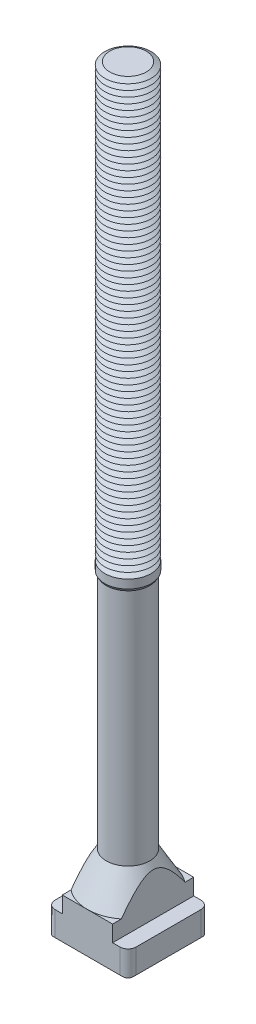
ISO-10303-21;
HEADER;
FILE_DESCRIPTION(('STEP AP214'),'2;1');
FILE_NAME('part.step','',(''),(''),'','','');
FILE_SCHEMA(('AUTOMOTIVE_DESIGN { 1 0 10303 214 1 1 1 1 }'));
ENDSEC;
DATA;
#1=APPLICATION_CONTEXT('core data for automotive mechanical design processes');
#2=APPLICATION_PROTOCOL_DEFINITION('international standard','automotive_design',2000,#1);
#3=PRODUCT_CONTEXT('',#1,'mechanical');
#4=PRODUCT('Part','Part','',(#3));
#5=PRODUCT_RELATED_PRODUCT_CATEGORY('part','',(#4));
#6=PRODUCT_DEFINITION_FORMATION('','',#4);
#7=PRODUCT_DEFINITION_CONTEXT('part definition',#1,'design');
#8=PRODUCT_DEFINITION('design','',#6,#7);
#9=PRODUCT_DEFINITION_SHAPE('','',#8);
#10=(LENGTH_UNIT() NAMED_UNIT(*) SI_UNIT(.MILLI.,.METRE.));
#11=(NAMED_UNIT(*) PLANE_ANGLE_UNIT() SI_UNIT($,.RADIAN.));
#12=(NAMED_UNIT(*) SI_UNIT($,.STERADIAN.) SOLID_ANGLE_UNIT());
#13=UNCERTAINTY_MEASURE_WITH_UNIT(LENGTH_MEASURE(1.E-05),#10,'distance_accuracy_value','');
#14=(GEOMETRIC_REPRESENTATION_CONTEXT(3) GLOBAL_UNCERTAINTY_ASSIGNED_CONTEXT((#13)) GLOBAL_UNIT_ASSIGNED_CONTEXT((#10,
#11,#12)) REPRESENTATION_CONTEXT('',''));
#15=CARTESIAN_POINT('',(0.,0.,0.));
#16=DIRECTION('',(0.,0.,1.));
#17=DIRECTION('',(1.,0.,0.));
#18=AXIS2_PLACEMENT_3D('',#15,#16,#17);
#19=CARTESIAN_POINT('',(0.,319.,0.));
#20=DIRECTION('',(0.,-1.,0.));
#21=DIRECTION('',(0.,0.,-1.));
#22=AXIS2_PLACEMENT_3D('',#19,#20,#21);
#23=CONICAL_SURFACE('',#22,7.83493649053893,1.04719755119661);
#24=CARTESIAN_POINT('',(0.,317.75,0.));
#25=DIRECTION('',(0.,-1.,0.));
#26=DIRECTION('',(0.,0.,-1.));
#27=AXIS2_PLACEMENT_3D('',#24,#25,#26);
#28=CIRCLE('',#27,10.);
#29=CARTESIAN_POINT('',(0.,317.75,-10.));
#30=VERTEX_POINT('',#29);
#31=EDGE_CURVE('E1036',#30,#30,#28,.T.);
#32=ORIENTED_EDGE('',*,*,#31,.F.);
#33=EDGE_LOOP('',(#32));
#34=FACE_BOUND('',#33,.T.);
#35=CARTESIAN_POINT('',(0.,319.,0.));
#36=DIRECTION('',(0.,-1.,0.));
#37=DIRECTION('',(0.,0.,-1.));
#38=AXIS2_PLACEMENT_3D('',#35,#36,#37);
#39=CIRCLE('',#38,7.83493649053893);
#40=CARTESIAN_POINT('',(0.,319.,-7.83493649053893));
#41=VERTEX_POINT('',#40);
#42=EDGE_CURVE('E958',#41,#41,#39,.T.);
#43=ORIENTED_EDGE('',*,*,#42,.T.);
#44=EDGE_LOOP('',(#43));
#45=FACE_BOUND('',#44,.T.);
#46=ADVANCED_FACE('F39',(#34,#45),#23,.T.);
#47=CARTESIAN_POINT('',(0.,320.25,0.));
#48=DIRECTION('',(0.,1.,0.));
#49=DIRECTION('',(0.,0.,1.));
#50=AXIS2_PLACEMENT_3D('',#47,#48,#49);
#51=CONICAL_SURFACE('',#50,10.,1.04719755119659);
#52=ORIENTED_EDGE('',*,*,#42,.F.);
#53=EDGE_LOOP('',(#52));
#54=FACE_BOUND('',#53,.T.);
#55=CARTESIAN_POINT('',(0.,320.25,0.));
#56=DIRECTION('',(0.,-1.,0.));
#57=DIRECTION('',(0.,0.,-1.));
#58=AXIS2_PLACEMENT_3D('',#55,#56,#57);
#59=CIRCLE('',#58,10.);
#60=CARTESIAN_POINT('',(0.,320.25,-10.));
#61=VERTEX_POINT('',#60);
#62=EDGE_CURVE('E955',#61,#61,#59,.T.);
#63=ORIENTED_EDGE('',*,*,#62,.T.);
#64=EDGE_LOOP('',(#63));
#65=FACE_BOUND('',#64,.T.);
#66=ADVANCED_FACE('F448',(#54,#65),#51,.T.);
#67=CARTESIAN_POINT('',(4.77792371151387,329.,0.));
#68=DIRECTION('',(0.,-1.,0.));
#69=DIRECTION('',(1.,0.,0.));
#70=AXIS2_PLACEMENT_3D('',#67,#68,#69);
#71=PLANE('',#70);
#72=CARTESIAN_POINT('',(0.,329.,0.));
#73=DIRECTION('',(0.,-1.,0.));
#74=DIRECTION('',(0.,0.,-1.));
#75=AXIS2_PLACEMENT_3D('',#72,#73,#74);
#76=CIRCLE('',#75,7.83493649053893);
#77=CARTESIAN_POINT('',(0.,329.,-7.83493649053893));
#78=VERTEX_POINT('',#77);
#79=EDGE_CURVE('E740',#78,#78,#76,.T.);
#80=ORIENTED_EDGE('',*,*,#79,.F.);
#81=EDGE_LOOP('',(#80));
#82=FACE_BOUND('',#81,.T.);
#83=ADVANCED_FACE('F454',(#82),#71,.F.);
#84=CARTESIAN_POINT('',(0.,329.,0.));
#85=DIRECTION('',(0.,-1.,0.));
#86=DIRECTION('',(0.,0.,-1.));
#87=AXIS2_PLACEMENT_3D('',#84,#85,#86);
#88=CONICAL_SURFACE('',#87,7.83493649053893,1.04719755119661);
#89=CARTESIAN_POINT('',(0.,327.75,0.));
#90=DIRECTION('',(0.,-1.,0.));
#91=DIRECTION('',(0.,0.,-1.));
#92=AXIS2_PLACEMENT_3D('',#89,#90,#91);
#93=CIRCLE('',#92,10.);
#94=CARTESIAN_POINT('',(0.,327.75,-10.));
#95=VERTEX_POINT('',#94);
#96=EDGE_CURVE('E738',#95,#95,#93,.T.);
#97=ORIENTED_EDGE('',*,*,#96,.F.);
#98=EDGE_LOOP('',(#97));
#99=FACE_BOUND('',#98,.T.);
#100=ORIENTED_EDGE('',*,*,#79,.T.);
#101=EDGE_LOOP('',(#100));
#102=FACE_BOUND('',#101,.T.);
#103=ADVANCED_FACE('F482',(#99,#102),#88,.T.);
#104=CARTESIAN_POINT('',(0.,327.75,0.));
#105=DIRECTION('',(0.,1.,0.));
#106=DIRECTION('',(0.,0.,1.));
#107=AXIS2_PLACEMENT_3D('',#104,#105,#106);
#108=CONICAL_SURFACE('',#107,10.,1.04719755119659);
#109=CARTESIAN_POINT('',(0.,326.5,0.));
#110=DIRECTION('',(0.,-1.,0.));
#111=DIRECTION('',(0.,0.,-1.));
#112=AXIS2_PLACEMENT_3D('',#109,#110,#111);
#113=CIRCLE('',#112,7.83493649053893);
#114=CARTESIAN_POINT('',(0.,326.5,-7.83493649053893));
#115=VERTEX_POINT('',#114);
#116=EDGE_CURVE('E741',#115,#115,#113,.T.);
#117=ORIENTED_EDGE('',*,*,#116,.F.);
#118=EDGE_LOOP('',(#117));
#119=FACE_BOUND('',#118,.T.);
#120=ORIENTED_EDGE('',*,*,#96,.T.);
#121=EDGE_LOOP('',(#120));
#122=FACE_BOUND('',#121,.T.);
#123=ADVANCED_FACE('F479',(#119,#122),#108,.T.);
#124=CARTESIAN_POINT('',(0.,326.5,0.));
#125=DIRECTION('',(0.,-1.,0.));
#126=DIRECTION('',(0.,0.,-1.));
#127=AXIS2_PLACEMENT_3D('',#124,#125,#126);
#128=CONICAL_SURFACE('',#127,7.83493649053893,1.04719755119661);
#129=CARTESIAN_POINT('',(0.,325.25,0.));
#130=DIRECTION('',(0.,-1.,0.));
#131=DIRECTION('',(0.,0.,-1.));
#132=AXIS2_PLACEMENT_3D('',#129,#130,#131);
#133=CIRCLE('',#132,10.);
#134=CARTESIAN_POINT('',(0.,325.25,-10.));
#135=VERTEX_POINT('',#134);
#136=EDGE_CURVE('E933',#135,#135,#133,.T.);
#137=ORIENTED_EDGE('',*,*,#136,.F.);
#138=EDGE_LOOP('',(#137));
#139=FACE_BOUND('',#138,.T.);
#140=ORIENTED_EDGE('',*,*,#116,.T.);
#141=EDGE_LOOP('',(#140));
#142=FACE_BOUND('',#141,.T.);
#143=ADVANCED_FACE('F474',(#139,#142),#128,.T.);
#144=CARTESIAN_POINT('',(0.,325.25,0.));
#145=DIRECTION('',(0.,1.,0.));
#146=DIRECTION('',(0.,0.,1.));
#147=AXIS2_PLACEMENT_3D('',#144,#145,#146);
#148=CONICAL_SURFACE('',#147,10.,1.04719755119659);
#149=CARTESIAN_POINT('',(0.,324.,0.));
#150=DIRECTION('',(0.,-1.,0.));
#151=DIRECTION('',(0.,0.,-1.));
#152=AXIS2_PLACEMENT_3D('',#149,#150,#151);
#153=CIRCLE('',#152,7.83493649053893);
#154=CARTESIAN_POINT('',(0.,324.,-7.83493649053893));
#155=VERTEX_POINT('',#154);
#156=EDGE_CURVE('E930',#155,#155,#153,.T.);
#157=ORIENTED_EDGE('',*,*,#156,.F.);
#158=EDGE_LOOP('',(#157));
#159=FACE_BOUND('',#158,.T.);
#160=ORIENTED_EDGE('',*,*,#136,.T.);
#161=EDGE_LOOP('',(#160));
#162=FACE_BOUND('',#161,.T.);
#163=ADVANCED_FACE('F471',(#159,#162),#148,.T.);
#164=CARTESIAN_POINT('',(0.,324.,0.));
#165=DIRECTION('',(0.,-1.,0.));
#166=DIRECTION('',(0.,0.,-1.));
#167=AXIS2_PLACEMENT_3D('',#164,#165,#166);
#168=CONICAL_SURFACE('',#167,7.83493649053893,1.04719755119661);
#169=CARTESIAN_POINT('',(0.,322.75,0.));
#170=DIRECTION('',(0.,-1.,0.));
#171=DIRECTION('',(0.,0.,-1.));
#172=AXIS2_PLACEMENT_3D('',#169,#170,#171);
#173=CIRCLE('',#172,10.);
#174=CARTESIAN_POINT('',(0.,322.75,-10.));
#175=VERTEX_POINT('',#174);
#176=EDGE_CURVE('E934',#175,#175,#173,.T.);
#177=ORIENTED_EDGE('',*,*,#176,.F.);
#178=EDGE_LOOP('',(#177));
#179=FACE_BOUND('',#178,.T.);
#180=ORIENTED_EDGE('',*,*,#156,.T.);
#181=EDGE_LOOP('',(#180));
#182=FACE_BOUND('',#181,.T.);
#183=ADVANCED_FACE('F465',(#179,#182),#168,.T.);
#184=CARTESIAN_POINT('',(0.,322.75,0.));
#185=DIRECTION('',(0.,1.,0.));
#186=DIRECTION('',(0.,0.,1.));
#187=AXIS2_PLACEMENT_3D('',#184,#185,#186);
#188=CONICAL_SURFACE('',#187,10.,1.04719755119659);
#189=CARTESIAN_POINT('',(0.,321.5,0.));
#190=DIRECTION('',(0.,-1.,0.));
#191=DIRECTION('',(0.,0.,-1.));
#192=AXIS2_PLACEMENT_3D('',#189,#190,#191);
#193=CIRCLE('',#192,7.83493649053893);
#194=CARTESIAN_POINT('',(0.,321.5,-7.83493649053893));
#195=VERTEX_POINT('',#194);
#196=EDGE_CURVE('E957',#195,#195,#193,.T.);
#197=ORIENTED_EDGE('',*,*,#196,.F.);
#198=EDGE_LOOP('',(#197));
#199=FACE_BOUND('',#198,.T.);
#200=ORIENTED_EDGE('',*,*,#176,.T.);
#201=EDGE_LOOP('',(#200));
#202=FACE_BOUND('',#201,.T.);
#203=ADVANCED_FACE('F461',(#199,#202),#188,.T.);
#204=CARTESIAN_POINT('',(0.,321.5,0.));
#205=DIRECTION('',(0.,-1.,0.));
#206=DIRECTION('',(0.,0.,-1.));
#207=AXIS2_PLACEMENT_3D('',#204,#205,#206);
#208=CONICAL_SURFACE('',#207,7.83493649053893,1.04719755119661);
#209=ORIENTED_EDGE('',*,*,#62,.F.);
#210=EDGE_LOOP('',(#209));
#211=FACE_BOUND('',#210,.T.);
#212=ORIENTED_EDGE('',*,*,#196,.T.);
#213=EDGE_LOOP('',(#212));
#214=FACE_BOUND('',#213,.T.);
#215=ADVANCED_FACE('F464',(#211,#214),#208,.T.);
#216=CARTESIAN_POINT('',(0.,316.5,0.));
#217=DIRECTION('',(0.,-1.,0.));
#218=DIRECTION('',(0.,0.,-1.));
#219=AXIS2_PLACEMENT_3D('',#216,#217,#218);
#220=CONICAL_SURFACE('',#219,7.83493649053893,1.04719755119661);
#221=CARTESIAN_POINT('',(0.,315.25,0.));
#222=DIRECTION('',(0.,-1.,0.));
#223=DIRECTION('',(0.,0.,-1.));
#224=AXIS2_PLACEMENT_3D('',#221,#222,#223);
#225=CIRCLE('',#224,10.);
#226=CARTESIAN_POINT('',(0.,315.25,-10.));
#227=VERTEX_POINT('',#226);
#228=EDGE_CURVE('E1005',#227,#227,#225,.T.);
#229=ORIENTED_EDGE('',*,*,#228,.F.);
#230=EDGE_LOOP('',(#229));
#231=FACE_BOUND('',#230,.T.);
#232=CARTESIAN_POINT('',(0.,316.5,0.));
#233=DIRECTION('',(0.,-1.,0.));
#234=DIRECTION('',(0.,0.,-1.));
#235=AXIS2_PLACEMENT_3D('',#232,#233,#234);
#236=CIRCLE('',#235,7.83493649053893);
#237=CARTESIAN_POINT('',(0.,316.5,-7.83493649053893));
#238=VERTEX_POINT('',#237);
#239=EDGE_CURVE('E1033',#238,#238,#236,.T.);
#240=ORIENTED_EDGE('',*,*,#239,.T.);
#241=EDGE_LOOP('',(#240));
#242=FACE_BOUND('',#241,.T.);
#243=ADVANCED_FACE('F469',(#231,#242),#220,.T.);
#244=CARTESIAN_POINT('',(0.,317.75,0.));
#245=DIRECTION('',(0.,1.,0.));
#246=DIRECTION('',(0.,0.,1.));
#247=AXIS2_PLACEMENT_3D('',#244,#245,#246);
#248=CONICAL_SURFACE('',#247,10.,1.04719755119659);
#249=ORIENTED_EDGE('',*,*,#239,.F.);
#250=EDGE_LOOP('',(#249));
#251=FACE_BOUND('',#250,.T.);
#252=ORIENTED_EDGE('',*,*,#31,.T.);
#253=EDGE_LOOP('',(#252));
#254=FACE_BOUND('',#253,.T.);
#255=ADVANCED_FACE('F1487',(#251,#254),#248,.T.);
#256=CARTESIAN_POINT('',(0.,314.,0.));
#257=DIRECTION('',(0.,-1.,0.));
#258=DIRECTION('',(0.,0.,-1.));
#259=AXIS2_PLACEMENT_3D('',#256,#257,#258);
#260=CONICAL_SURFACE('',#259,7.83493649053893,1.04719755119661);
#261=CARTESIAN_POINT('',(0.,312.75,0.));
#262=DIRECTION('',(0.,-1.,0.));
#263=DIRECTION('',(0.,0.,-1.));
#264=AXIS2_PLACEMENT_3D('',#261,#262,#263);
#265=CIRCLE('',#264,10.);
#266=CARTESIAN_POINT('',(0.,312.75,-10.));
#267=VERTEX_POINT('',#266);
#268=EDGE_CURVE('E927',#267,#267,#265,.T.);
#269=ORIENTED_EDGE('',*,*,#268,.F.);
#270=EDGE_LOOP('',(#269));
#271=FACE_BOUND('',#270,.T.);
#272=CARTESIAN_POINT('',(0.,314.,0.));
#273=DIRECTION('',(0.,-1.,0.));
#274=DIRECTION('',(0.,0.,-1.));
#275=AXIS2_PLACEMENT_3D('',#272,#273,#274);
#276=CIRCLE('',#275,7.83493649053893);
#277=CARTESIAN_POINT('',(0.,314.,-7.83493649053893));
#278=VERTEX_POINT('',#277);
#279=EDGE_CURVE('E1002',#278,#278,#276,.T.);
#280=ORIENTED_EDGE('',*,*,#279,.T.);
#281=EDGE_LOOP('',(#280));
#282=FACE_BOUND('',#281,.T.);
#283=ADVANCED_FACE('F1483',(#271,#282),#260,.T.);
#284=CARTESIAN_POINT('',(0.,315.25,0.));
#285=DIRECTION('',(0.,1.,0.));
#286=DIRECTION('',(0.,0.,1.));
#287=AXIS2_PLACEMENT_3D('',#284,#285,#286);
#288=CONICAL_SURFACE('',#287,10.,1.04719755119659);
#289=ORIENTED_EDGE('',*,*,#279,.F.);
#290=EDGE_LOOP('',(#289));
#291=FACE_BOUND('',#290,.T.);
#292=ORIENTED_EDGE('',*,*,#228,.T.);
#293=EDGE_LOOP('',(#292));
#294=FACE_BOUND('',#293,.T.);
#295=ADVANCED_FACE('F1479',(#291,#294),#288,.T.);
#296=CARTESIAN_POINT('',(0.,311.5,0.));
#297=DIRECTION('',(0.,-1.,0.));
#298=DIRECTION('',(0.,0.,-1.));
#299=AXIS2_PLACEMENT_3D('',#296,#297,#298);
#300=CONICAL_SURFACE('',#299,7.83493649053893,1.04719755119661);
#301=CARTESIAN_POINT('',(0.,310.25,0.));
#302=DIRECTION('',(0.,-1.,0.));
#303=DIRECTION('',(0.,0.,-1.));
#304=AXIS2_PLACEMENT_3D('',#301,#302,#303);
#305=CIRCLE('',#304,10.);
#306=CARTESIAN_POINT('',(0.,310.25,-10.));
#307=VERTEX_POINT('',#306);
#308=EDGE_CURVE('E928',#307,#307,#305,.T.);
#309=ORIENTED_EDGE('',*,*,#308,.F.);
#310=EDGE_LOOP('',(#309));
#311=FACE_BOUND('',#310,.T.);
#312=CARTESIAN_POINT('',(0.,311.5,0.));
#313=DIRECTION('',(0.,-1.,0.));
#314=DIRECTION('',(0.,0.,-1.));
#315=AXIS2_PLACEMENT_3D('',#312,#313,#314);
#316=CIRCLE('',#315,7.83493649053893);
#317=CARTESIAN_POINT('',(0.,311.5,-7.83493649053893));
#318=VERTEX_POINT('',#317);
#319=EDGE_CURVE('E924',#318,#318,#316,.T.);
#320=ORIENTED_EDGE('',*,*,#319,.T.);
#321=EDGE_LOOP('',(#320));
#322=FACE_BOUND('',#321,.T.);
#323=ADVANCED_FACE('F1475',(#311,#322),#300,.T.);
#324=CARTESIAN_POINT('',(0.,312.75,0.));
#325=DIRECTION('',(0.,1.,0.));
#326=DIRECTION('',(0.,0.,1.));
#327=AXIS2_PLACEMENT_3D('',#324,#325,#326);
#328=CONICAL_SURFACE('',#327,10.,1.04719755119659);
#329=ORIENTED_EDGE('',*,*,#319,.F.);
#330=EDGE_LOOP('',(#329));
#331=FACE_BOUND('',#330,.T.);
#332=ORIENTED_EDGE('',*,*,#268,.T.);
#333=EDGE_LOOP('',(#332));
#334=FACE_BOUND('',#333,.T.);
#335=ADVANCED_FACE('F1471',(#331,#334),#328,.T.);
#336=CARTESIAN_POINT('',(0.,309.,0.));
#337=DIRECTION('',(0.,-1.,0.));
#338=DIRECTION('',(0.,0.,-1.));
#339=AXIS2_PLACEMENT_3D('',#336,#337,#338);
#340=CONICAL_SURFACE('',#339,7.83493649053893,1.04719755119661);
#341=CARTESIAN_POINT('',(0.,307.75,0.));
#342=DIRECTION('',(0.,-1.,0.));
#343=DIRECTION('',(0.,0.,-1.));
#344=AXIS2_PLACEMENT_3D('',#341,#342,#343);
#345=CIRCLE('',#344,10.);
#346=CARTESIAN_POINT('',(0.,307.75,-10.));
#347=VERTEX_POINT('',#346);
#348=EDGE_CURVE('E894',#347,#347,#345,.T.);
#349=ORIENTED_EDGE('',*,*,#348,.F.);
#350=EDGE_LOOP('',(#349));
#351=FACE_BOUND('',#350,.T.);
#352=CARTESIAN_POINT('',(0.,309.,0.));
#353=DIRECTION('',(0.,-1.,0.));
#354=DIRECTION('',(0.,0.,-1.));
#355=AXIS2_PLACEMENT_3D('',#352,#353,#354);
#356=CIRCLE('',#355,7.83493649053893);
#357=CARTESIAN_POINT('',(0.,309.,-7.83493649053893));
#358=VERTEX_POINT('',#357);
#359=EDGE_CURVE('E897',#358,#358,#356,.T.);
#360=ORIENTED_EDGE('',*,*,#359,.T.);
#361=EDGE_LOOP('',(#360));
#362=FACE_BOUND('',#361,.T.);
#363=ADVANCED_FACE('F1467',(#351,#362),#340,.T.);
#364=CARTESIAN_POINT('',(0.,310.25,0.));
#365=DIRECTION('',(0.,1.,0.));
#366=DIRECTION('',(0.,0.,1.));
#367=AXIS2_PLACEMENT_3D('',#364,#365,#366);
#368=CONICAL_SURFACE('',#367,10.,1.04719755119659);
#369=ORIENTED_EDGE('',*,*,#359,.F.);
#370=EDGE_LOOP('',(#369));
#371=FACE_BOUND('',#370,.T.);
#372=ORIENTED_EDGE('',*,*,#308,.T.);
#373=EDGE_LOOP('',(#372));
#374=FACE_BOUND('',#373,.T.);
#375=ADVANCED_FACE('F1463',(#371,#374),#368,.T.);
#376=CARTESIAN_POINT('',(0.,306.5,0.));
#377=DIRECTION('',(0.,-1.,0.));
#378=DIRECTION('',(0.,0.,-1.));
#379=AXIS2_PLACEMENT_3D('',#376,#377,#378);
#380=CONICAL_SURFACE('',#379,7.83493649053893,1.04719755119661);
#381=CARTESIAN_POINT('',(0.,305.25,0.));
#382=DIRECTION('',(0.,-1.,0.));
#383=DIRECTION('',(0.,0.,-1.));
#384=AXIS2_PLACEMENT_3D('',#381,#382,#383);
#385=CIRCLE('',#384,10.);
#386=CARTESIAN_POINT('',(0.,305.25,-10.));
#387=VERTEX_POINT('',#386);
#388=EDGE_CURVE('E815',#387,#387,#385,.T.);
#389=ORIENTED_EDGE('',*,*,#388,.F.);
#390=EDGE_LOOP('',(#389));
#391=FACE_BOUND('',#390,.T.);
#392=CARTESIAN_POINT('',(0.,306.5,0.));
#393=DIRECTION('',(0.,-1.,0.));
#394=DIRECTION('',(0.,0.,-1.));
#395=AXIS2_PLACEMENT_3D('',#392,#393,#394);
#396=CIRCLE('',#395,7.83493649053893);
#397=CARTESIAN_POINT('',(0.,306.5,-7.83493649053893));
#398=VERTEX_POINT('',#397);
#399=EDGE_CURVE('E898',#398,#398,#396,.T.);
#400=ORIENTED_EDGE('',*,*,#399,.T.);
#401=EDGE_LOOP('',(#400));
#402=FACE_BOUND('',#401,.T.);
#403=ADVANCED_FACE('F1459',(#391,#402),#380,.T.);
#404=CARTESIAN_POINT('',(0.,307.75,0.));
#405=DIRECTION('',(0.,1.,0.));
#406=DIRECTION('',(0.,0.,1.));
#407=AXIS2_PLACEMENT_3D('',#404,#405,#406);
#408=CONICAL_SURFACE('',#407,10.,1.04719755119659);
#409=ORIENTED_EDGE('',*,*,#399,.F.);
#410=EDGE_LOOP('',(#409));
#411=FACE_BOUND('',#410,.T.);
#412=ORIENTED_EDGE('',*,*,#348,.T.);
#413=EDGE_LOOP('',(#412));
#414=FACE_BOUND('',#413,.T.);
#415=ADVANCED_FACE('F1455',(#411,#414),#408,.T.);
#416=CARTESIAN_POINT('',(0.,304.,0.));
#417=DIRECTION('',(0.,-1.,0.));
#418=DIRECTION('',(0.,0.,-1.));
#419=AXIS2_PLACEMENT_3D('',#416,#417,#418);
#420=CONICAL_SURFACE('',#419,7.83493649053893,1.04719755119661);
#421=CARTESIAN_POINT('',(0.,302.75,0.));
#422=DIRECTION('',(0.,-1.,0.));
#423=DIRECTION('',(0.,0.,-1.));
#424=AXIS2_PLACEMENT_3D('',#421,#422,#423);
#425=CIRCLE('',#424,10.);
#426=CARTESIAN_POINT('',(0.,302.75,-10.));
#427=VERTEX_POINT('',#426);
#428=EDGE_CURVE('E679',#427,#427,#425,.T.);
#429=ORIENTED_EDGE('',*,*,#428,.F.);
#430=EDGE_LOOP('',(#429));
#431=FACE_BOUND('',#430,.T.);
#432=CARTESIAN_POINT('',(0.,304.,0.));
#433=DIRECTION('',(0.,-1.,0.));
#434=DIRECTION('',(0.,0.,-1.));
#435=AXIS2_PLACEMENT_3D('',#432,#433,#434);
#436=CIRCLE('',#435,7.83493649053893);
#437=CARTESIAN_POINT('',(0.,304.,-7.83493649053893));
#438=VERTEX_POINT('',#437);
#439=EDGE_CURVE('E736',#438,#438,#436,.T.);
#440=ORIENTED_EDGE('',*,*,#439,.T.);
#441=EDGE_LOOP('',(#440));
#442=FACE_BOUND('',#441,.T.);
#443=ADVANCED_FACE('F1451',(#431,#442),#420,.T.);
#444=CARTESIAN_POINT('',(0.,305.25,0.));
#445=DIRECTION('',(0.,1.,0.));
#446=DIRECTION('',(0.,0.,1.));
#447=AXIS2_PLACEMENT_3D('',#444,#445,#446);
#448=CONICAL_SURFACE('',#447,10.,1.04719755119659);
#449=ORIENTED_EDGE('',*,*,#439,.F.);
#450=EDGE_LOOP('',(#449));
#451=FACE_BOUND('',#450,.T.);
#452=ORIENTED_EDGE('',*,*,#388,.T.);
#453=EDGE_LOOP('',(#452));
#454=FACE_BOUND('',#453,.T.);
#455=ADVANCED_FACE('F1447',(#451,#454),#448,.T.);
#456=CARTESIAN_POINT('',(0.,301.5,0.));
#457=DIRECTION('',(0.,-1.,0.));
#458=DIRECTION('',(0.,0.,-1.));
#459=AXIS2_PLACEMENT_3D('',#456,#457,#458);
#460=CONICAL_SURFACE('',#459,7.83493649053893,1.04719755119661);
#461=CARTESIAN_POINT('',(0.,300.25,0.));
#462=DIRECTION('',(0.,-1.,0.));
#463=DIRECTION('',(0.,0.,-1.));
#464=AXIS2_PLACEMENT_3D('',#461,#462,#463);
#465=CIRCLE('',#464,10.);
#466=CARTESIAN_POINT('',(0.,300.25,-10.));
#467=VERTEX_POINT('',#466);
#468=EDGE_CURVE('E680',#467,#467,#465,.T.);
#469=ORIENTED_EDGE('',*,*,#468,.F.);
#470=EDGE_LOOP('',(#469));
#471=FACE_BOUND('',#470,.T.);
#472=CARTESIAN_POINT('',(0.,301.5,0.));
#473=DIRECTION('',(0.,-1.,0.));
#474=DIRECTION('',(0.,0.,-1.));
#475=AXIS2_PLACEMENT_3D('',#472,#473,#474);
#476=CIRCLE('',#475,7.83493649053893);
#477=CARTESIAN_POINT('',(0.,301.5,-7.83493649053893));
#478=VERTEX_POINT('',#477);
#479=EDGE_CURVE('E677',#478,#478,#476,.T.);
#480=ORIENTED_EDGE('',*,*,#479,.T.);
#481=EDGE_LOOP('',(#480));
#482=FACE_BOUND('',#481,.T.);
#483=ADVANCED_FACE('F1443',(#471,#482),#460,.T.);
#484=CARTESIAN_POINT('',(0.,302.75,0.));
#485=DIRECTION('',(0.,1.,0.));
#486=DIRECTION('',(0.,0.,1.));
#487=AXIS2_PLACEMENT_3D('',#484,#485,#486);
#488=CONICAL_SURFACE('',#487,10.,1.04719755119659);
#489=ORIENTED_EDGE('',*,*,#479,.F.);
#490=EDGE_LOOP('',(#489));
#491=FACE_BOUND('',#490,.T.);
#492=ORIENTED_EDGE('',*,*,#428,.T.);
#493=EDGE_LOOP('',(#492));
#494=FACE_BOUND('',#493,.T.);
#495=ADVANCED_FACE('F1439',(#491,#494),#488,.T.);
#496=CARTESIAN_POINT('',(0.,299.,0.));
#497=DIRECTION('',(0.,-1.,0.));
#498=DIRECTION('',(0.,0.,-1.));
#499=AXIS2_PLACEMENT_3D('',#496,#497,#498);
#500=CONICAL_SURFACE('',#499,7.83493649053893,1.04719755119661);
#501=CARTESIAN_POINT('',(0.,297.75,0.));
#502=DIRECTION('',(0.,-1.,0.));
#503=DIRECTION('',(0.,0.,-1.));
#504=AXIS2_PLACEMENT_3D('',#501,#502,#503);
#505=CIRCLE('',#504,10.);
#506=CARTESIAN_POINT('',(0.,297.75,-10.));
#507=VERTEX_POINT('',#506);
#508=EDGE_CURVE('E855',#507,#507,#505,.T.);
#509=ORIENTED_EDGE('',*,*,#508,.F.);
#510=EDGE_LOOP('',(#509));
#511=FACE_BOUND('',#510,.T.);
#512=CARTESIAN_POINT('',(0.,299.,0.));
#513=DIRECTION('',(0.,-1.,0.));
#514=DIRECTION('',(0.,0.,-1.));
#515=AXIS2_PLACEMENT_3D('',#512,#513,#514);
#516=CIRCLE('',#515,7.83493649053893);
#517=CARTESIAN_POINT('',(0.,299.,-7.83493649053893));
#518=VERTEX_POINT('',#517);
#519=EDGE_CURVE('E858',#518,#518,#516,.T.);
#520=ORIENTED_EDGE('',*,*,#519,.T.);
#521=EDGE_LOOP('',(#520));
#522=FACE_BOUND('',#521,.T.);
#523=ADVANCED_FACE('F1435',(#511,#522),#500,.T.);
#524=CARTESIAN_POINT('',(0.,300.25,0.));
#525=DIRECTION('',(0.,1.,0.));
#526=DIRECTION('',(0.,0.,1.));
#527=AXIS2_PLACEMENT_3D('',#524,#525,#526);
#528=CONICAL_SURFACE('',#527,10.,1.04719755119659);
#529=ORIENTED_EDGE('',*,*,#519,.F.);
#530=EDGE_LOOP('',(#529));
#531=FACE_BOUND('',#530,.T.);
#532=ORIENTED_EDGE('',*,*,#468,.T.);
#533=EDGE_LOOP('',(#532));
#534=FACE_BOUND('',#533,.T.);
#535=ADVANCED_FACE('F1431',(#531,#534),#528,.T.);
#536=CARTESIAN_POINT('',(0.,296.5,0.));
#537=DIRECTION('',(0.,-1.,0.));
#538=DIRECTION('',(0.,0.,-1.));
#539=AXIS2_PLACEMENT_3D('',#536,#537,#538);
#540=CONICAL_SURFACE('',#539,7.83493649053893,1.04719755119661);
#541=CARTESIAN_POINT('',(0.,295.25,0.));
#542=DIRECTION('',(0.,-1.,0.));
#543=DIRECTION('',(0.,0.,-1.));
#544=AXIS2_PLACEMENT_3D('',#541,#542,#543);
#545=CIRCLE('',#544,10.);
#546=CARTESIAN_POINT('',(0.,295.25,-10.));
#547=VERTEX_POINT('',#546);
#548=EDGE_CURVE('E1029',#547,#547,#545,.T.);
#549=ORIENTED_EDGE('',*,*,#548,.F.);
#550=EDGE_LOOP('',(#549));
#551=FACE_BOUND('',#550,.T.);
#552=CARTESIAN_POINT('',(0.,296.5,0.));
#553=DIRECTION('',(0.,-1.,0.));
#554=DIRECTION('',(0.,0.,-1.));
#555=AXIS2_PLACEMENT_3D('',#552,#553,#554);
#556=CIRCLE('',#555,7.83493649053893);
#557=CARTESIAN_POINT('',(0.,296.5,-7.83493649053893));
#558=VERTEX_POINT('',#557);
#559=EDGE_CURVE('E859',#558,#558,#556,.T.);
#560=ORIENTED_EDGE('',*,*,#559,.T.);
#561=EDGE_LOOP('',(#560));
#562=FACE_BOUND('',#561,.T.);
#563=ADVANCED_FACE('F1427',(#551,#562),#540,.T.);
#564=CARTESIAN_POINT('',(0.,297.75,0.));
#565=DIRECTION('',(0.,1.,0.));
#566=DIRECTION('',(0.,0.,1.));
#567=AXIS2_PLACEMENT_3D('',#564,#565,#566);
#568=CONICAL_SURFACE('',#567,10.,1.04719755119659);
#569=ORIENTED_EDGE('',*,*,#559,.F.);
#570=EDGE_LOOP('',(#569));
#571=FACE_BOUND('',#570,.T.);
#572=ORIENTED_EDGE('',*,*,#508,.T.);
#573=EDGE_LOOP('',(#572));
#574=FACE_BOUND('',#573,.T.);
#575=ADVANCED_FACE('F1423',(#571,#574),#568,.T.);
#576=CARTESIAN_POINT('',(0.,294.,0.));
#577=DIRECTION('',(0.,-1.,0.));
#578=DIRECTION('',(0.,0.,-1.));
#579=AXIS2_PLACEMENT_3D('',#576,#577,#578);
#580=CONICAL_SURFACE('',#579,7.83493649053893,1.04719755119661);
#581=CARTESIAN_POINT('',(0.,292.75,0.));
#582=DIRECTION('',(0.,-1.,0.));
#583=DIRECTION('',(0.,0.,-1.));
#584=AXIS2_PLACEMENT_3D('',#581,#582,#583);
#585=CIRCLE('',#584,10.);
#586=CARTESIAN_POINT('',(0.,292.75,-10.));
#587=VERTEX_POINT('',#586);
#588=EDGE_CURVE('E764',#587,#587,#585,.T.);
#589=ORIENTED_EDGE('',*,*,#588,.F.);
#590=EDGE_LOOP('',(#589));
#591=FACE_BOUND('',#590,.T.);
#592=CARTESIAN_POINT('',(0.,294.,0.));
#593=DIRECTION('',(0.,-1.,0.));
#594=DIRECTION('',(0.,0.,-1.));
#595=AXIS2_PLACEMENT_3D('',#592,#593,#594);
#596=CIRCLE('',#595,7.83493649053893);
#597=CARTESIAN_POINT('',(0.,294.,-7.83493649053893));
#598=VERTEX_POINT('',#597);
#599=EDGE_CURVE('E766',#598,#598,#596,.T.);
#600=ORIENTED_EDGE('',*,*,#599,.T.);
#601=EDGE_LOOP('',(#600));
#602=FACE_BOUND('',#601,.T.);
#603=ADVANCED_FACE('F1419',(#591,#602),#580,.T.);
#604=CARTESIAN_POINT('',(0.,295.25,0.));
#605=DIRECTION('',(0.,1.,0.));
#606=DIRECTION('',(0.,0.,1.));
#607=AXIS2_PLACEMENT_3D('',#604,#605,#606);
#608=CONICAL_SURFACE('',#607,10.,1.04719755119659);
#609=ORIENTED_EDGE('',*,*,#599,.F.);
#610=EDGE_LOOP('',(#609));
#611=FACE_BOUND('',#610,.T.);
#612=ORIENTED_EDGE('',*,*,#548,.T.);
#613=EDGE_LOOP('',(#612));
#614=FACE_BOUND('',#613,.T.);
#615=ADVANCED_FACE('F1415',(#611,#614),#608,.T.);
#616=CARTESIAN_POINT('',(0.,291.5,0.));
#617=DIRECTION('',(0.,-1.,0.));
#618=DIRECTION('',(0.,0.,-1.));
#619=AXIS2_PLACEMENT_3D('',#616,#617,#618);
#620=CONICAL_SURFACE('',#619,7.83493649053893,1.04719755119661);
#621=CARTESIAN_POINT('',(0.,290.25,0.));
#622=DIRECTION('',(0.,-1.,0.));
#623=DIRECTION('',(0.,0.,-1.));
#624=AXIS2_PLACEMENT_3D('',#621,#622,#623);
#625=CIRCLE('',#624,10.);
#626=CARTESIAN_POINT('',(0.,290.25,-10.));
#627=VERTEX_POINT('',#626);
#628=EDGE_CURVE('E728',#627,#627,#625,.T.);
#629=ORIENTED_EDGE('',*,*,#628,.F.);
#630=EDGE_LOOP('',(#629));
#631=FACE_BOUND('',#630,.T.);
#632=CARTESIAN_POINT('',(0.,291.5,0.));
#633=DIRECTION('',(0.,-1.,0.));
#634=DIRECTION('',(0.,0.,-1.));
#635=AXIS2_PLACEMENT_3D('',#632,#633,#634);
#636=CIRCLE('',#635,7.83493649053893);
#637=CARTESIAN_POINT('',(0.,291.5,-7.83493649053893));
#638=VERTEX_POINT('',#637);
#639=EDGE_CURVE('E731',#638,#638,#636,.T.);
#640=ORIENTED_EDGE('',*,*,#639,.T.);
#641=EDGE_LOOP('',(#640));
#642=FACE_BOUND('',#641,.T.);
#643=ADVANCED_FACE('F1411',(#631,#642),#620,.T.);
#644=CARTESIAN_POINT('',(0.,292.75,0.));
#645=DIRECTION('',(0.,1.,0.));
#646=DIRECTION('',(0.,0.,1.));
#647=AXIS2_PLACEMENT_3D('',#644,#645,#646);
#648=CONICAL_SURFACE('',#647,10.,1.04719755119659);
#649=ORIENTED_EDGE('',*,*,#639,.F.);
#650=EDGE_LOOP('',(#649));
#651=FACE_BOUND('',#650,.T.);
#652=ORIENTED_EDGE('',*,*,#588,.T.);
#653=EDGE_LOOP('',(#652));
#654=FACE_BOUND('',#653,.T.);
#655=ADVANCED_FACE('F1407',(#651,#654),#648,.T.);
#656=CARTESIAN_POINT('',(0.,289.,0.));
#657=DIRECTION('',(0.,-1.,0.));
#658=DIRECTION('',(0.,0.,-1.));
#659=AXIS2_PLACEMENT_3D('',#656,#657,#658);
#660=CONICAL_SURFACE('',#659,7.83493649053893,1.04719755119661);
#661=CARTESIAN_POINT('',(0.,287.75,0.));
#662=DIRECTION('',(0.,-1.,0.));
#663=DIRECTION('',(0.,0.,-1.));
#664=AXIS2_PLACEMENT_3D('',#661,#662,#663);
#665=CIRCLE('',#664,10.);
#666=CARTESIAN_POINT('',(0.,287.75,-10.));
#667=VERTEX_POINT('',#666);
#668=EDGE_CURVE('E1000',#667,#667,#665,.T.);
#669=ORIENTED_EDGE('',*,*,#668,.F.);
#670=EDGE_LOOP('',(#669));
#671=FACE_BOUND('',#670,.T.);
#672=CARTESIAN_POINT('',(0.,289.,0.));
#673=DIRECTION('',(0.,-1.,0.));
#674=DIRECTION('',(0.,0.,-1.));
#675=AXIS2_PLACEMENT_3D('',#672,#673,#674);
#676=CIRCLE('',#675,7.83493649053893);
#677=CARTESIAN_POINT('',(0.,289.,-7.83493649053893));
#678=VERTEX_POINT('',#677);
#679=EDGE_CURVE('E732',#678,#678,#676,.T.);
#680=ORIENTED_EDGE('',*,*,#679,.T.);
#681=EDGE_LOOP('',(#680));
#682=FACE_BOUND('',#681,.T.);
#683=ADVANCED_FACE('F1403',(#671,#682),#660,.T.);
#684=CARTESIAN_POINT('',(0.,290.25,0.));
#685=DIRECTION('',(0.,1.,0.));
#686=DIRECTION('',(0.,0.,1.));
#687=AXIS2_PLACEMENT_3D('',#684,#685,#686);
#688=CONICAL_SURFACE('',#687,10.,1.04719755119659);
#689=ORIENTED_EDGE('',*,*,#679,.F.);
#690=EDGE_LOOP('',(#689));
#691=FACE_BOUND('',#690,.T.);
#692=ORIENTED_EDGE('',*,*,#628,.T.);
#693=EDGE_LOOP('',(#692));
#694=FACE_BOUND('',#693,.T.);
#695=ADVANCED_FACE('F1399',(#691,#694),#688,.T.);
#696=CARTESIAN_POINT('',(0.,286.5,0.));
#697=DIRECTION('',(0.,-1.,0.));
#698=DIRECTION('',(0.,0.,-1.));
#699=AXIS2_PLACEMENT_3D('',#696,#697,#698);
#700=CONICAL_SURFACE('',#699,7.83493649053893,1.04719755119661);
#701=CARTESIAN_POINT('',(0.,285.25,0.));
#702=DIRECTION('',(0.,-1.,0.));
#703=DIRECTION('',(0.,0.,-1.));
#704=AXIS2_PLACEMENT_3D('',#701,#702,#703);
#705=CIRCLE('',#704,10.);
#706=CARTESIAN_POINT('',(0.,285.25,-10.));
#707=VERTEX_POINT('',#706);
#708=EDGE_CURVE('E721',#707,#707,#705,.T.);
#709=ORIENTED_EDGE('',*,*,#708,.F.);
#710=EDGE_LOOP('',(#709));
#711=FACE_BOUND('',#710,.T.);
#712=CARTESIAN_POINT('',(0.,286.5,0.));
#713=DIRECTION('',(0.,-1.,0.));
#714=DIRECTION('',(0.,0.,-1.));
#715=AXIS2_PLACEMENT_3D('',#712,#713,#714);
#716=CIRCLE('',#715,7.83493649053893);
#717=CARTESIAN_POINT('',(0.,286.5,-7.83493649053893));
#718=VERTEX_POINT('',#717);
#719=EDGE_CURVE('E726',#718,#718,#716,.T.);
#720=ORIENTED_EDGE('',*,*,#719,.T.);
#721=EDGE_LOOP('',(#720));
#722=FACE_BOUND('',#721,.T.);
#723=ADVANCED_FACE('F1395',(#711,#722),#700,.T.);
#724=CARTESIAN_POINT('',(0.,287.75,0.));
#725=DIRECTION('',(0.,1.,0.));
#726=DIRECTION('',(0.,0.,1.));
#727=AXIS2_PLACEMENT_3D('',#724,#725,#726);
#728=CONICAL_SURFACE('',#727,10.,1.04719755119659);
#729=ORIENTED_EDGE('',*,*,#719,.F.);
#730=EDGE_LOOP('',(#729));
#731=FACE_BOUND('',#730,.T.);
#732=ORIENTED_EDGE('',*,*,#668,.T.);
#733=EDGE_LOOP('',(#732));
#734=FACE_BOUND('',#733,.T.);
#735=ADVANCED_FACE('F1391',(#731,#734),#728,.T.);
#736=CARTESIAN_POINT('',(0.,284.,0.));
#737=DIRECTION('',(0.,-1.,0.));
#738=DIRECTION('',(0.,0.,-1.));
#739=AXIS2_PLACEMENT_3D('',#736,#737,#738);
#740=CONICAL_SURFACE('',#739,7.83493649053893,1.04719755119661);
#741=CARTESIAN_POINT('',(0.,282.75,0.));
#742=DIRECTION('',(0.,-1.,0.));
#743=DIRECTION('',(0.,0.,-1.));
#744=AXIS2_PLACEMENT_3D('',#741,#742,#743);
#745=CIRCLE('',#744,10.);
#746=CARTESIAN_POINT('',(0.,282.75,-10.));
#747=VERTEX_POINT('',#746);
#748=EDGE_CURVE('E722',#747,#747,#745,.T.);
#749=ORIENTED_EDGE('',*,*,#748,.F.);
#750=EDGE_LOOP('',(#749));
#751=FACE_BOUND('',#750,.T.);
#752=CARTESIAN_POINT('',(0.,284.,0.));
#753=DIRECTION('',(0.,-1.,0.));
#754=DIRECTION('',(0.,0.,-1.));
#755=AXIS2_PLACEMENT_3D('',#752,#753,#754);
#756=CIRCLE('',#755,7.83493649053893);
#757=CARTESIAN_POINT('',(0.,284.,-7.83493649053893));
#758=VERTEX_POINT('',#757);
#759=EDGE_CURVE('E718',#758,#758,#756,.T.);
#760=ORIENTED_EDGE('',*,*,#759,.T.);
#761=EDGE_LOOP('',(#760));
#762=FACE_BOUND('',#761,.T.);
#763=ADVANCED_FACE('F1387',(#751,#762),#740,.T.);
#764=CARTESIAN_POINT('',(0.,285.25,0.));
#765=DIRECTION('',(0.,1.,0.));
#766=DIRECTION('',(0.,0.,1.));
#767=AXIS2_PLACEMENT_3D('',#764,#765,#766);
#768=CONICAL_SURFACE('',#767,10.,1.04719755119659);
#769=ORIENTED_EDGE('',*,*,#759,.F.);
#770=EDGE_LOOP('',(#769));
#771=FACE_BOUND('',#770,.T.);
#772=ORIENTED_EDGE('',*,*,#708,.T.);
#773=EDGE_LOOP('',(#772));
#774=FACE_BOUND('',#773,.T.);
#775=ADVANCED_FACE('F1383',(#771,#774),#768,.T.);
#776=CARTESIAN_POINT('',(0.,281.5,0.));
#777=DIRECTION('',(0.,-1.,0.));
#778=DIRECTION('',(0.,0.,-1.));
#779=AXIS2_PLACEMENT_3D('',#776,#777,#778);
#780=CONICAL_SURFACE('',#779,7.83493649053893,1.04719755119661);
#781=CARTESIAN_POINT('',(0.,280.25,0.));
#782=DIRECTION('',(0.,-1.,0.));
#783=DIRECTION('',(0.,0.,-1.));
#784=AXIS2_PLACEMENT_3D('',#781,#782,#783);
#785=CIRCLE('',#784,10.);
#786=CARTESIAN_POINT('',(0.,280.25,-10.));
#787=VERTEX_POINT('',#786);
#788=EDGE_CURVE('E762',#787,#787,#785,.T.);
#789=ORIENTED_EDGE('',*,*,#788,.F.);
#790=EDGE_LOOP('',(#789));
#791=FACE_BOUND('',#790,.T.);
#792=CARTESIAN_POINT('',(0.,281.5,0.));
#793=DIRECTION('',(0.,-1.,0.));
#794=DIRECTION('',(0.,0.,-1.));
#795=AXIS2_PLACEMENT_3D('',#792,#793,#794);
#796=CIRCLE('',#795,7.83493649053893);
#797=CARTESIAN_POINT('',(0.,281.5,-7.83493649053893));
#798=VERTEX_POINT('',#797);
#799=EDGE_CURVE('E759',#798,#798,#796,.T.);
#800=ORIENTED_EDGE('',*,*,#799,.T.);
#801=EDGE_LOOP('',(#800));
#802=FACE_BOUND('',#801,.T.);
#803=ADVANCED_FACE('F1379',(#791,#802),#780,.T.);
#804=CARTESIAN_POINT('',(0.,282.75,0.));
#805=DIRECTION('',(0.,1.,0.));
#806=DIRECTION('',(0.,0.,1.));
#807=AXIS2_PLACEMENT_3D('',#804,#805,#806);
#808=CONICAL_SURFACE('',#807,10.,1.04719755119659);
#809=ORIENTED_EDGE('',*,*,#799,.F.);
#810=EDGE_LOOP('',(#809));
#811=FACE_BOUND('',#810,.T.);
#812=ORIENTED_EDGE('',*,*,#748,.T.);
#813=EDGE_LOOP('',(#812));
#814=FACE_BOUND('',#813,.T.);
#815=ADVANCED_FACE('F1375',(#811,#814),#808,.T.);
#816=CARTESIAN_POINT('',(0.,279.,0.));
#817=DIRECTION('',(0.,-1.,0.));
#818=DIRECTION('',(0.,0.,-1.));
#819=AXIS2_PLACEMENT_3D('',#816,#817,#818);
#820=CONICAL_SURFACE('',#819,7.83493649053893,1.04719755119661);
#821=CARTESIAN_POINT('',(0.,277.75,0.));
#822=DIRECTION('',(0.,-1.,0.));
#823=DIRECTION('',(0.,0.,-1.));
#824=AXIS2_PLACEMENT_3D('',#821,#822,#823);
#825=CIRCLE('',#824,10.);
#826=CARTESIAN_POINT('',(0.,277.75,-10.));
#827=VERTEX_POINT('',#826);
#828=EDGE_CURVE('E889',#827,#827,#825,.T.);
#829=ORIENTED_EDGE('',*,*,#828,.F.);
#830=EDGE_LOOP('',(#829));
#831=FACE_BOUND('',#830,.T.);
#832=CARTESIAN_POINT('',(0.,279.,0.));
#833=DIRECTION('',(0.,-1.,0.));
#834=DIRECTION('',(0.,0.,-1.));
#835=AXIS2_PLACEMENT_3D('',#832,#833,#834);
#836=CIRCLE('',#835,7.83493649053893);
#837=CARTESIAN_POINT('',(0.,279.,-7.83493649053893));
#838=VERTEX_POINT('',#837);
#839=EDGE_CURVE('E886',#838,#838,#836,.T.);
#840=ORIENTED_EDGE('',*,*,#839,.T.);
#841=EDGE_LOOP('',(#840));
#842=FACE_BOUND('',#841,.T.);
#843=ADVANCED_FACE('F1369',(#831,#842),#820,.T.);
#844=CARTESIAN_POINT('',(0.,280.25,0.));
#845=DIRECTION('',(0.,1.,0.));
#846=DIRECTION('',(0.,0.,1.));
#847=AXIS2_PLACEMENT_3D('',#844,#845,#846);
#848=CONICAL_SURFACE('',#847,10.,1.04719755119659);
#849=ORIENTED_EDGE('',*,*,#839,.F.);
#850=EDGE_LOOP('',(#849));
#851=FACE_BOUND('',#850,.T.);
#852=ORIENTED_EDGE('',*,*,#788,.T.);
#853=EDGE_LOOP('',(#852));
#854=FACE_BOUND('',#853,.T.);
#855=ADVANCED_FACE('F1361',(#851,#854),#848,.T.);
#856=CARTESIAN_POINT('',(0.,276.5,0.));
#857=DIRECTION('',(0.,-1.,0.));
#858=DIRECTION('',(0.,0.,-1.));
#859=AXIS2_PLACEMENT_3D('',#856,#857,#858);
#860=CONICAL_SURFACE('',#859,7.83493649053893,1.04719755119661);
#861=CARTESIAN_POINT('',(0.,275.25,0.));
#862=DIRECTION('',(0.,-1.,0.));
#863=DIRECTION('',(0.,0.,-1.));
#864=AXIS2_PLACEMENT_3D('',#861,#862,#863);
#865=CIRCLE('',#864,10.);
#866=CARTESIAN_POINT('',(0.,275.25,-10.));
#867=VERTEX_POINT('',#866);
#868=EDGE_CURVE('E1105',#867,#867,#865,.T.);
#869=ORIENTED_EDGE('',*,*,#868,.F.);
#870=EDGE_LOOP('',(#869));
#871=FACE_BOUND('',#870,.T.);
#872=CARTESIAN_POINT('',(0.,276.5,0.));
#873=DIRECTION('',(0.,-1.,0.));
#874=DIRECTION('',(0.,0.,-1.));
#875=AXIS2_PLACEMENT_3D('',#872,#873,#874);
#876=CIRCLE('',#875,7.83493649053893);
#877=CARTESIAN_POINT('',(0.,276.5,-7.83493649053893));
#878=VERTEX_POINT('',#877);
#879=EDGE_CURVE('E1103',#878,#878,#876,.T.);
#880=ORIENTED_EDGE('',*,*,#879,.T.);
#881=EDGE_LOOP('',(#880));
#882=FACE_BOUND('',#881,.T.);
#883=ADVANCED_FACE('F1359',(#871,#882),#860,.T.);
#884=CARTESIAN_POINT('',(0.,277.75,0.));
#885=DIRECTION('',(0.,1.,0.));
#886=DIRECTION('',(0.,0.,1.));
#887=AXIS2_PLACEMENT_3D('',#884,#885,#886);
#888=CONICAL_SURFACE('',#887,10.,1.04719755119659);
#889=ORIENTED_EDGE('',*,*,#879,.F.);
#890=EDGE_LOOP('',(#889));
#891=FACE_BOUND('',#890,.T.);
#892=ORIENTED_EDGE('',*,*,#828,.T.);
#893=EDGE_LOOP('',(#892));
#894=FACE_BOUND('',#893,.T.);
#895=ADVANCED_FACE('F1350',(#891,#894),#888,.T.);
#896=CARTESIAN_POINT('',(0.,274.,0.));
#897=DIRECTION('',(0.,-1.,0.));
#898=DIRECTION('',(0.,0.,-1.));
#899=AXIS2_PLACEMENT_3D('',#896,#897,#898);
#900=CONICAL_SURFACE('',#899,7.83493649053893,1.04719755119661);
#901=CARTESIAN_POINT('',(0.,272.75,0.));
#902=DIRECTION('',(0.,-1.,0.));
#903=DIRECTION('',(0.,0.,-1.));
#904=AXIS2_PLACEMENT_3D('',#901,#902,#903);
#905=CIRCLE('',#904,10.);
#906=CARTESIAN_POINT('',(0.,272.75,-10.));
#907=VERTEX_POINT('',#906);
#908=EDGE_CURVE('E807',#907,#907,#905,.T.);
#909=ORIENTED_EDGE('',*,*,#908,.F.);
#910=EDGE_LOOP('',(#909));
#911=FACE_BOUND('',#910,.T.);
#912=CARTESIAN_POINT('',(0.,274.,0.));
#913=DIRECTION('',(0.,-1.,0.));
#914=DIRECTION('',(0.,0.,-1.));
#915=AXIS2_PLACEMENT_3D('',#912,#913,#914);
#916=CIRCLE('',#915,7.83493649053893);
#917=CARTESIAN_POINT('',(0.,274.,-7.83493649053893));
#918=VERTEX_POINT('',#917);
#919=EDGE_CURVE('E810',#918,#918,#916,.T.);
#920=ORIENTED_EDGE('',*,*,#919,.T.);
#921=EDGE_LOOP('',(#920));
#922=FACE_BOUND('',#921,.T.);
#923=ADVANCED_FACE('F1347',(#911,#922),#900,.T.);
#924=CARTESIAN_POINT('',(0.,275.25,0.));
#925=DIRECTION('',(0.,1.,0.));
#926=DIRECTION('',(0.,0.,1.));
#927=AXIS2_PLACEMENT_3D('',#924,#925,#926);
#928=CONICAL_SURFACE('',#927,10.,1.04719755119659);
#929=ORIENTED_EDGE('',*,*,#919,.F.);
#930=EDGE_LOOP('',(#929));
#931=FACE_BOUND('',#930,.T.);
#932=ORIENTED_EDGE('',*,*,#868,.T.);
#933=EDGE_LOOP('',(#932));
#934=FACE_BOUND('',#933,.T.);
#935=ADVANCED_FACE('F1338',(#931,#934),#928,.T.);
#936=CARTESIAN_POINT('',(0.,271.5,0.));
#937=DIRECTION('',(0.,-1.,0.));
#938=DIRECTION('',(0.,0.,-1.));
#939=AXIS2_PLACEMENT_3D('',#936,#937,#938);
#940=CONICAL_SURFACE('',#939,7.83493649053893,1.04719755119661);
#941=CARTESIAN_POINT('',(0.,270.25,0.));
#942=DIRECTION('',(0.,-1.,0.));
#943=DIRECTION('',(0.,0.,-1.));
#944=AXIS2_PLACEMENT_3D('',#941,#942,#943);
#945=CIRCLE('',#944,10.);
#946=CARTESIAN_POINT('',(0.,270.25,-10.));
#947=VERTEX_POINT('',#946);
#948=EDGE_CURVE('E757',#947,#947,#945,.T.);
#949=ORIENTED_EDGE('',*,*,#948,.F.);
#950=EDGE_LOOP('',(#949));
#951=FACE_BOUND('',#950,.T.);
#952=CARTESIAN_POINT('',(0.,271.5,0.));
#953=DIRECTION('',(0.,-1.,0.));
#954=DIRECTION('',(0.,0.,-1.));
#955=AXIS2_PLACEMENT_3D('',#952,#953,#954);
#956=CIRCLE('',#955,7.83493649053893);
#957=CARTESIAN_POINT('',(0.,271.5,-7.83493649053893));
#958=VERTEX_POINT('',#957);
#959=EDGE_CURVE('E811',#958,#958,#956,.T.);
#960=ORIENTED_EDGE('',*,*,#959,.T.);
#961=EDGE_LOOP('',(#960));
#962=FACE_BOUND('',#961,.T.);
#963=ADVANCED_FACE('F1335',(#951,#962),#940,.T.);
#964=CARTESIAN_POINT('',(0.,272.75,0.));
#965=DIRECTION('',(0.,1.,0.));
#966=DIRECTION('',(0.,0.,1.));
#967=AXIS2_PLACEMENT_3D('',#964,#965,#966);
#968=CONICAL_SURFACE('',#967,10.,1.04719755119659);
#969=ORIENTED_EDGE('',*,*,#959,.F.);
#970=EDGE_LOOP('',(#969));
#971=FACE_BOUND('',#970,.T.);
#972=ORIENTED_EDGE('',*,*,#908,.T.);
#973=EDGE_LOOP('',(#972));
#974=FACE_BOUND('',#973,.T.);
#975=ADVANCED_FACE('F1326',(#971,#974),#968,.T.);
#976=CARTESIAN_POINT('',(0.,269.,0.));
#977=DIRECTION('',(0.,-1.,0.));
#978=DIRECTION('',(0.,0.,-1.));
#979=AXIS2_PLACEMENT_3D('',#976,#977,#978);
#980=CONICAL_SURFACE('',#979,7.83493649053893,1.04719755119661);
#981=CARTESIAN_POINT('',(0.,267.75,0.));
#982=DIRECTION('',(0.,-1.,0.));
#983=DIRECTION('',(0.,0.,-1.));
#984=AXIS2_PLACEMENT_3D('',#981,#982,#983);
#985=CIRCLE('',#984,10.);
#986=CARTESIAN_POINT('',(0.,267.75,-10.));
#987=VERTEX_POINT('',#986);
#988=EDGE_CURVE('E672',#987,#987,#985,.T.);
#989=ORIENTED_EDGE('',*,*,#988,.F.);
#990=EDGE_LOOP('',(#989));
#991=FACE_BOUND('',#990,.T.);
#992=CARTESIAN_POINT('',(0.,269.,0.));
#993=DIRECTION('',(0.,-1.,0.));
#994=DIRECTION('',(0.,0.,-1.));
#995=AXIS2_PLACEMENT_3D('',#992,#993,#994);
#996=CIRCLE('',#995,7.83493649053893);
#997=CARTESIAN_POINT('',(0.,269.,-7.83493649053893));
#998=VERTEX_POINT('',#997);
#999=EDGE_CURVE('E675',#998,#998,#996,.T.);
#1000=ORIENTED_EDGE('',*,*,#999,.T.);
#1001=EDGE_LOOP('',(#1000));
#1002=FACE_BOUND('',#1001,.T.);
#1003=ADVANCED_FACE('F1323',(#991,#1002),#980,.T.);
#1004=CARTESIAN_POINT('',(0.,270.25,0.));
#1005=DIRECTION('',(0.,1.,0.));
#1006=DIRECTION('',(0.,0.,1.));
#1007=AXIS2_PLACEMENT_3D('',#1004,#1005,#1006);
#1008=CONICAL_SURFACE('',#1007,10.,1.04719755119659);
#1009=ORIENTED_EDGE('',*,*,#999,.F.);
#1010=EDGE_LOOP('',(#1009));
#1011=FACE_BOUND('',#1010,.T.);
#1012=ORIENTED_EDGE('',*,*,#948,.T.);
#1013=EDGE_LOOP('',(#1012));
#1014=FACE_BOUND('',#1013,.T.);
#1015=ADVANCED_FACE('F1314',(#1011,#1014),#1008,.T.);
#1016=CARTESIAN_POINT('',(0.,266.5,0.));
#1017=DIRECTION('',(0.,-1.,0.));
#1018=DIRECTION('',(0.,0.,-1.));
#1019=AXIS2_PLACEMENT_3D('',#1016,#1017,#1018);
#1020=CONICAL_SURFACE('',#1019,7.83493649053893,1.04719755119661);
#1021=CARTESIAN_POINT('',(0.,265.25,0.));
#1022=DIRECTION('',(0.,-1.,0.));
#1023=DIRECTION('',(0.,0.,-1.));
#1024=AXIS2_PLACEMENT_3D('',#1021,#1022,#1023);
#1025=CIRCLE('',#1024,10.);
#1026=CARTESIAN_POINT('',(0.,265.25,-10.));
#1027=VERTEX_POINT('',#1026);
#1028=EDGE_CURVE('E666',#1027,#1027,#1025,.T.);
#1029=ORIENTED_EDGE('',*,*,#1028,.F.);
#1030=EDGE_LOOP('',(#1029));
#1031=FACE_BOUND('',#1030,.T.);
#1032=CARTESIAN_POINT('',(0.,266.5,0.));
#1033=DIRECTION('',(0.,-1.,0.));
#1034=DIRECTION('',(0.,0.,-1.));
#1035=AXIS2_PLACEMENT_3D('',#1032,#1033,#1034);
#1036=CIRCLE('',#1035,7.83493649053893);
#1037=CARTESIAN_POINT('',(0.,266.5,-7.83493649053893));
#1038=VERTEX_POINT('',#1037);
#1039=EDGE_CURVE('E669',#1038,#1038,#1036,.T.);
#1040=ORIENTED_EDGE('',*,*,#1039,.T.);
#1041=EDGE_LOOP('',(#1040));
#1042=FACE_BOUND('',#1041,.T.);
#1043=ADVANCED_FACE('F1311',(#1031,#1042),#1020,.T.);
#1044=CARTESIAN_POINT('',(0.,267.75,0.));
#1045=DIRECTION('',(0.,1.,0.));
#1046=DIRECTION('',(0.,0.,1.));
#1047=AXIS2_PLACEMENT_3D('',#1044,#1045,#1046);
#1048=CONICAL_SURFACE('',#1047,10.,1.04719755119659);
#1049=ORIENTED_EDGE('',*,*,#1039,.F.);
#1050=EDGE_LOOP('',(#1049));
#1051=FACE_BOUND('',#1050,.T.);
#1052=ORIENTED_EDGE('',*,*,#988,.T.);
#1053=EDGE_LOOP('',(#1052));
#1054=FACE_BOUND('',#1053,.T.);
#1055=ADVANCED_FACE('F1302',(#1051,#1054),#1048,.T.);
#1056=CARTESIAN_POINT('',(0.,264.,0.));
#1057=DIRECTION('',(0.,-1.,0.));
#1058=DIRECTION('',(0.,0.,-1.));
#1059=AXIS2_PLACEMENT_3D('',#1056,#1057,#1058);
#1060=CONICAL_SURFACE('',#1059,7.83493649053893,1.04719755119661);
#1061=CARTESIAN_POINT('',(0.,262.75,0.));
#1062=DIRECTION('',(0.,-1.,0.));
#1063=DIRECTION('',(0.,0.,-1.));
#1064=AXIS2_PLACEMENT_3D('',#1061,#1062,#1063);
#1065=CIRCLE('',#1064,10.);
#1066=CARTESIAN_POINT('',(0.,262.75,-10.));
#1067=VERTEX_POINT('',#1066);
#1068=EDGE_CURVE('E1027',#1067,#1067,#1065,.T.);
#1069=ORIENTED_EDGE('',*,*,#1068,.F.);
#1070=EDGE_LOOP('',(#1069));
#1071=FACE_BOUND('',#1070,.T.);
#1072=CARTESIAN_POINT('',(0.,264.,0.));
#1073=DIRECTION('',(0.,-1.,0.));
#1074=DIRECTION('',(0.,0.,-1.));
#1075=AXIS2_PLACEMENT_3D('',#1072,#1073,#1074);
#1076=CIRCLE('',#1075,7.83493649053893);
#1077=CARTESIAN_POINT('',(0.,264.,-7.83493649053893));
#1078=VERTEX_POINT('',#1077);
#1079=EDGE_CURVE('E670',#1078,#1078,#1076,.T.);
#1080=ORIENTED_EDGE('',*,*,#1079,.T.);
#1081=EDGE_LOOP('',(#1080));
#1082=FACE_BOUND('',#1081,.T.);
#1083=ADVANCED_FACE('F1299',(#1071,#1082),#1060,.T.);
#1084=CARTESIAN_POINT('',(0.,265.25,0.));
#1085=DIRECTION('',(0.,1.,0.));
#1086=DIRECTION('',(0.,0.,1.));
#1087=AXIS2_PLACEMENT_3D('',#1084,#1085,#1086);
#1088=CONICAL_SURFACE('',#1087,10.,1.04719755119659);
#1089=ORIENTED_EDGE('',*,*,#1079,.F.);
#1090=EDGE_LOOP('',(#1089));
#1091=FACE_BOUND('',#1090,.T.);
#1092=ORIENTED_EDGE('',*,*,#1028,.T.);
#1093=EDGE_LOOP('',(#1092));
#1094=FACE_BOUND('',#1093,.T.);
#1095=ADVANCED_FACE('F1290',(#1091,#1094),#1088,.T.);
#1096=CARTESIAN_POINT('',(0.,261.5,0.));
#1097=DIRECTION('',(0.,-1.,0.));
#1098=DIRECTION('',(0.,0.,-1.));
#1099=AXIS2_PLACEMENT_3D('',#1096,#1097,#1098);
#1100=CONICAL_SURFACE('',#1099,7.83493649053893,1.04719755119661);
#1101=CARTESIAN_POINT('',(0.,260.25,0.));
#1102=DIRECTION('',(0.,-1.,0.));
#1103=DIRECTION('',(0.,0.,-1.));
#1104=AXIS2_PLACEMENT_3D('',#1101,#1102,#1103);
#1105=CIRCLE('',#1104,10.);
#1106=CARTESIAN_POINT('',(0.,260.25,-10.));
#1107=VERTEX_POINT('',#1106);
#1108=EDGE_CURVE('E850',#1107,#1107,#1105,.T.);
#1109=ORIENTED_EDGE('',*,*,#1108,.F.);
#1110=EDGE_LOOP('',(#1109));
#1111=FACE_BOUND('',#1110,.T.);
#1112=CARTESIAN_POINT('',(0.,261.5,0.));
#1113=DIRECTION('',(0.,-1.,0.));
#1114=DIRECTION('',(0.,0.,-1.));
#1115=AXIS2_PLACEMENT_3D('',#1112,#1113,#1114);
#1116=CIRCLE('',#1115,7.83493649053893);
#1117=CARTESIAN_POINT('',(0.,261.5,-7.83493649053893));
#1118=VERTEX_POINT('',#1117);
#1119=EDGE_CURVE('E853',#1118,#1118,#1116,.T.);
#1120=ORIENTED_EDGE('',*,*,#1119,.T.);
#1121=EDGE_LOOP('',(#1120));
#1122=FACE_BOUND('',#1121,.T.);
#1123=ADVANCED_FACE('F1287',(#1111,#1122),#1100,.T.);
#1124=CARTESIAN_POINT('',(0.,262.75,0.));
#1125=DIRECTION('',(0.,1.,0.));
#1126=DIRECTION('',(0.,0.,1.));
#1127=AXIS2_PLACEMENT_3D('',#1124,#1125,#1126);
#1128=CONICAL_SURFACE('',#1127,10.,1.04719755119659);
#1129=ORIENTED_EDGE('',*,*,#1119,.F.);
#1130=EDGE_LOOP('',(#1129));
#1131=FACE_BOUND('',#1130,.T.);
#1132=ORIENTED_EDGE('',*,*,#1068,.T.);
#1133=EDGE_LOOP('',(#1132));
#1134=FACE_BOUND('',#1133,.T.);
#1135=ADVANCED_FACE('F1278',(#1131,#1134),#1128,.T.);
#1136=CARTESIAN_POINT('',(0.,259.,0.));
#1137=DIRECTION('',(0.,-1.,0.));
#1138=DIRECTION('',(0.,0.,-1.));
#1139=AXIS2_PLACEMENT_3D('',#1136,#1137,#1138);
#1140=CONICAL_SURFACE('',#1139,7.83493649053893,1.04719755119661);
#1141=CARTESIAN_POINT('',(0.,257.75,0.));
#1142=DIRECTION('',(0.,-1.,0.));
#1143=DIRECTION('',(0.,0.,-1.));
#1144=AXIS2_PLACEMENT_3D('',#1141,#1142,#1143);
#1145=CIRCLE('',#1144,10.);
#1146=CARTESIAN_POINT('',(0.,257.75,-10.));
#1147=VERTEX_POINT('',#1146);
#1148=EDGE_CURVE('E712',#1147,#1147,#1145,.T.);
#1149=ORIENTED_EDGE('',*,*,#1148,.F.);
#1150=EDGE_LOOP('',(#1149));
#1151=FACE_BOUND('',#1150,.T.);
#1152=CARTESIAN_POINT('',(0.,259.,0.));
#1153=DIRECTION('',(0.,-1.,0.));
#1154=DIRECTION('',(0.,0.,-1.));
#1155=AXIS2_PLACEMENT_3D('',#1152,#1153,#1154);
#1156=CIRCLE('',#1155,7.83493649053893);
#1157=CARTESIAN_POINT('',(0.,259.,-7.83493649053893));
#1158=VERTEX_POINT('',#1157);
#1159=EDGE_CURVE('E715',#1158,#1158,#1156,.T.);
#1160=ORIENTED_EDGE('',*,*,#1159,.T.);
#1161=EDGE_LOOP('',(#1160));
#1162=FACE_BOUND('',#1161,.T.);
#1163=ADVANCED_FACE('F1275',(#1151,#1162),#1140,.T.);
#1164=CARTESIAN_POINT('',(0.,260.25,0.));
#1165=DIRECTION('',(0.,1.,0.));
#1166=DIRECTION('',(0.,0.,1.));
#1167=AXIS2_PLACEMENT_3D('',#1164,#1165,#1166);
#1168=CONICAL_SURFACE('',#1167,10.,1.04719755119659);
#1169=ORIENTED_EDGE('',*,*,#1159,.F.);
#1170=EDGE_LOOP('',(#1169));
#1171=FACE_BOUND('',#1170,.T.);
#1172=ORIENTED_EDGE('',*,*,#1108,.T.);
#1173=EDGE_LOOP('',(#1172));
#1174=FACE_BOUND('',#1173,.T.);
#1175=ADVANCED_FACE('F1265',(#1171,#1174),#1168,.T.);
#1176=CARTESIAN_POINT('',(0.,256.5,0.));
#1177=DIRECTION('',(0.,-1.,0.));
#1178=DIRECTION('',(0.,0.,-1.));
#1179=AXIS2_PLACEMENT_3D('',#1176,#1177,#1178);
#1180=CONICAL_SURFACE('',#1179,7.83493649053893,1.04719755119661);
#1181=CARTESIAN_POINT('',(0.,255.25,0.));
#1182=DIRECTION('',(0.,-1.,0.));
#1183=DIRECTION('',(0.,0.,-1.));
#1184=AXIS2_PLACEMENT_3D('',#1181,#1182,#1183);
#1185=CIRCLE('',#1184,10.);
#1186=CARTESIAN_POINT('',(0.,255.25,-10.));
#1187=VERTEX_POINT('',#1186);
#1188=EDGE_CURVE('E848',#1187,#1187,#1185,.T.);
#1189=ORIENTED_EDGE('',*,*,#1188,.F.);
#1190=EDGE_LOOP('',(#1189));
#1191=FACE_BOUND('',#1190,.T.);
#1192=CARTESIAN_POINT('',(0.,256.5,0.));
#1193=DIRECTION('',(0.,-1.,0.));
#1194=DIRECTION('',(0.,0.,-1.));
#1195=AXIS2_PLACEMENT_3D('',#1192,#1193,#1194);
#1196=CIRCLE('',#1195,7.83493649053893);
#1197=CARTESIAN_POINT('',(0.,256.5,-7.83493649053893));
#1198=VERTEX_POINT('',#1197);
#1199=EDGE_CURVE('E716',#1198,#1198,#1196,.T.);
#1200=ORIENTED_EDGE('',*,*,#1199,.T.);
#1201=EDGE_LOOP('',(#1200));
#1202=FACE_BOUND('',#1201,.T.);
#1203=ADVANCED_FACE('F1261',(#1191,#1202),#1180,.T.);
#1204=CARTESIAN_POINT('',(0.,257.75,0.));
#1205=DIRECTION('',(0.,1.,0.));
#1206=DIRECTION('',(0.,0.,1.));
#1207=AXIS2_PLACEMENT_3D('',#1204,#1205,#1206);
#1208=CONICAL_SURFACE('',#1207,10.,1.04719755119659);
#1209=ORIENTED_EDGE('',*,*,#1199,.F.);
#1210=EDGE_LOOP('',(#1209));
#1211=FACE_BOUND('',#1210,.T.);
#1212=ORIENTED_EDGE('',*,*,#1148,.T.);
#1213=EDGE_LOOP('',(#1212));
#1214=FACE_BOUND('',#1213,.T.);
#1215=ADVANCED_FACE('F1264',(#1211,#1214),#1208,.T.);
#1216=CARTESIAN_POINT('',(0.,254.,0.));
#1217=DIRECTION('',(0.,-1.,0.));
#1218=DIRECTION('',(0.,0.,-1.));
#1219=AXIS2_PLACEMENT_3D('',#1216,#1217,#1218);
#1220=CONICAL_SURFACE('',#1219,7.83493649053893,1.04719755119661);
#1221=CARTESIAN_POINT('',(0.,252.75,0.));
#1222=DIRECTION('',(0.,-1.,0.));
#1223=DIRECTION('',(0.,0.,-1.));
#1224=AXIS2_PLACEMENT_3D('',#1221,#1222,#1223);
#1225=CIRCLE('',#1224,10.);
#1226=CARTESIAN_POINT('',(0.,252.75,-10.));
#1227=VERTEX_POINT('',#1226);
#1228=EDGE_CURVE('E659',#1227,#1227,#1225,.T.);
#1229=ORIENTED_EDGE('',*,*,#1228,.F.);
#1230=EDGE_LOOP('',(#1229));
#1231=FACE_BOUND('',#1230,.T.);
#1232=CARTESIAN_POINT('',(0.,254.,0.));
#1233=DIRECTION('',(0.,-1.,0.));
#1234=DIRECTION('',(0.,0.,-1.));
#1235=AXIS2_PLACEMENT_3D('',#1232,#1233,#1234);
#1236=CIRCLE('',#1235,7.83493649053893);
#1237=CARTESIAN_POINT('',(0.,254.,-7.83493649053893));
#1238=VERTEX_POINT('',#1237);
#1239=EDGE_CURVE('E664',#1238,#1238,#1236,.T.);
#1240=ORIENTED_EDGE('',*,*,#1239,.T.);
#1241=EDGE_LOOP('',(#1240));
#1242=FACE_BOUND('',#1241,.T.);
#1243=ADVANCED_FACE('F1271',(#1231,#1242),#1220,.T.);
#1244=CARTESIAN_POINT('',(0.,255.25,0.));
#1245=DIRECTION('',(0.,1.,0.));
#1246=DIRECTION('',(0.,0.,1.));
#1247=AXIS2_PLACEMENT_3D('',#1244,#1245,#1246);
#1248=CONICAL_SURFACE('',#1247,10.,1.04719755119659);
#1249=ORIENTED_EDGE('',*,*,#1239,.F.);
#1250=EDGE_LOOP('',(#1249));
#1251=FACE_BOUND('',#1250,.T.);
#1252=ORIENTED_EDGE('',*,*,#1188,.T.);
#1253=EDGE_LOOP('',(#1252));
#1254=FACE_BOUND('',#1253,.T.);
#1255=ADVANCED_FACE('F1259',(#1251,#1254),#1248,.T.);
#1256=CARTESIAN_POINT('',(0.,251.5,0.));
#1257=DIRECTION('',(0.,-1.,0.));
#1258=DIRECTION('',(0.,0.,-1.));
#1259=AXIS2_PLACEMENT_3D('',#1256,#1257,#1258);
#1260=CONICAL_SURFACE('',#1259,7.83493649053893,1.04719755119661);
#1261=CARTESIAN_POINT('',(0.,250.25,0.));
#1262=DIRECTION('',(0.,-1.,0.));
#1263=DIRECTION('',(0.,0.,-1.));
#1264=AXIS2_PLACEMENT_3D('',#1261,#1262,#1263);
#1265=CIRCLE('',#1264,10.);
#1266=CARTESIAN_POINT('',(0.,250.25,-10.));
#1267=VERTEX_POINT('',#1266);
#1268=EDGE_CURVE('E660',#1267,#1267,#1265,.T.);
#1269=ORIENTED_EDGE('',*,*,#1268,.F.);
#1270=EDGE_LOOP('',(#1269));
#1271=FACE_BOUND('',#1270,.T.);
#1272=CARTESIAN_POINT('',(0.,251.5,0.));
#1273=DIRECTION('',(0.,-1.,0.));
#1274=DIRECTION('',(0.,0.,-1.));
#1275=AXIS2_PLACEMENT_3D('',#1272,#1273,#1274);
#1276=CIRCLE('',#1275,7.83493649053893);
#1277=CARTESIAN_POINT('',(0.,251.5,-7.83493649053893));
#1278=VERTEX_POINT('',#1277);
#1279=EDGE_CURVE('E656',#1278,#1278,#1276,.T.);
#1280=ORIENTED_EDGE('',*,*,#1279,.T.);
#1281=EDGE_LOOP('',(#1280));
#1282=FACE_BOUND('',#1281,.T.);
#1283=ADVANCED_FACE('F1698',(#1271,#1282),#1260,.T.);
#1284=CARTESIAN_POINT('',(0.,252.75,0.));
#1285=DIRECTION('',(0.,1.,0.));
#1286=DIRECTION('',(0.,0.,1.));
#1287=AXIS2_PLACEMENT_3D('',#1284,#1285,#1286);
#1288=CONICAL_SURFACE('',#1287,10.,1.04719755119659);
#1289=ORIENTED_EDGE('',*,*,#1279,.F.);
#1290=EDGE_LOOP('',(#1289));
#1291=FACE_BOUND('',#1290,.T.);
#1292=ORIENTED_EDGE('',*,*,#1228,.T.);
#1293=EDGE_LOOP('',(#1292));
#1294=FACE_BOUND('',#1293,.T.);
#1295=ADVANCED_FACE('F1707',(#1291,#1294),#1288,.T.);
#1296=CARTESIAN_POINT('',(0.,249.,0.));
#1297=DIRECTION('',(0.,-1.,0.));
#1298=DIRECTION('',(0.,0.,-1.));
#1299=AXIS2_PLACEMENT_3D('',#1296,#1297,#1298);
#1300=CONICAL_SURFACE('',#1299,7.83493649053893,1.04719755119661);
#1301=CARTESIAN_POINT('',(0.,247.75,0.));
#1302=DIRECTION('',(0.,-1.,0.));
#1303=DIRECTION('',(0.,0.,-1.));
#1304=AXIS2_PLACEMENT_3D('',#1301,#1302,#1303);
#1305=CIRCLE('',#1304,10.);
#1306=CARTESIAN_POINT('',(0.,247.75,-10.));
#1307=VERTEX_POINT('',#1306);
#1308=EDGE_CURVE('E987',#1307,#1307,#1305,.T.);
#1309=ORIENTED_EDGE('',*,*,#1308,.F.);
#1310=EDGE_LOOP('',(#1309));
#1311=FACE_BOUND('',#1310,.T.);
#1312=CARTESIAN_POINT('',(0.,249.,0.));
#1313=DIRECTION('',(0.,-1.,0.));
#1314=DIRECTION('',(0.,0.,-1.));
#1315=AXIS2_PLACEMENT_3D('',#1312,#1313,#1314);
#1316=CIRCLE('',#1315,7.83493649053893);
#1317=CARTESIAN_POINT('',(0.,249.,-7.83493649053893));
#1318=VERTEX_POINT('',#1317);
#1319=EDGE_CURVE('E881',#1318,#1318,#1316,.T.);
#1320=ORIENTED_EDGE('',*,*,#1319,.T.);
#1321=EDGE_LOOP('',(#1320));
#1322=FACE_BOUND('',#1321,.T.);
#1323=ADVANCED_FACE('F1716',(#1311,#1322),#1300,.T.);
#1324=CARTESIAN_POINT('',(0.,250.25,0.));
#1325=DIRECTION('',(0.,1.,0.));
#1326=DIRECTION('',(0.,0.,1.));
#1327=AXIS2_PLACEMENT_3D('',#1324,#1325,#1326);
#1328=CONICAL_SURFACE('',#1327,10.,1.04719755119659);
#1329=ORIENTED_EDGE('',*,*,#1319,.F.);
#1330=EDGE_LOOP('',(#1329));
#1331=FACE_BOUND('',#1330,.T.);
#1332=ORIENTED_EDGE('',*,*,#1268,.T.);
#1333=EDGE_LOOP('',(#1332));
#1334=FACE_BOUND('',#1333,.T.);
#1335=ADVANCED_FACE('F1725',(#1331,#1334),#1328,.T.);
#1336=CARTESIAN_POINT('',(0.,246.5,0.));
#1337=DIRECTION('',(0.,-1.,0.));
#1338=DIRECTION('',(0.,0.,-1.));
#1339=AXIS2_PLACEMENT_3D('',#1336,#1337,#1338);
#1340=CONICAL_SURFACE('',#1339,7.83493649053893,1.04719755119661);
#1341=CARTESIAN_POINT('',(0.,245.25,0.));
#1342=DIRECTION('',(0.,-1.,0.));
#1343=DIRECTION('',(0.,0.,-1.));
#1344=AXIS2_PLACEMENT_3D('',#1341,#1342,#1343);
#1345=CIRCLE('',#1344,10.);
#1346=CARTESIAN_POINT('',(0.,245.25,-10.));
#1347=VERTEX_POINT('',#1346);
#1348=EDGE_CURVE('E1063',#1347,#1347,#1345,.T.);
#1349=ORIENTED_EDGE('',*,*,#1348,.F.);
#1350=EDGE_LOOP('',(#1349));
#1351=FACE_BOUND('',#1350,.T.);
#1352=CARTESIAN_POINT('',(0.,246.5,0.));
#1353=DIRECTION('',(0.,-1.,0.));
#1354=DIRECTION('',(0.,0.,-1.));
#1355=AXIS2_PLACEMENT_3D('',#1352,#1353,#1354);
#1356=CIRCLE('',#1355,7.83493649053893);
#1357=CARTESIAN_POINT('',(0.,246.5,-7.83493649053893));
#1358=VERTEX_POINT('',#1357);
#1359=EDGE_CURVE('E990',#1358,#1358,#1356,.T.);
#1360=ORIENTED_EDGE('',*,*,#1359,.T.);
#1361=EDGE_LOOP('',(#1360));
#1362=FACE_BOUND('',#1361,.T.);
#1363=ADVANCED_FACE('F1734',(#1351,#1362),#1340,.T.);
#1364=CARTESIAN_POINT('',(0.,247.75,0.));
#1365=DIRECTION('',(0.,1.,0.));
#1366=DIRECTION('',(0.,0.,1.));
#1367=AXIS2_PLACEMENT_3D('',#1364,#1365,#1366);
#1368=CONICAL_SURFACE('',#1367,10.,1.04719755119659);
#1369=ORIENTED_EDGE('',*,*,#1359,.F.);
#1370=EDGE_LOOP('',(#1369));
#1371=FACE_BOUND('',#1370,.T.);
#1372=ORIENTED_EDGE('',*,*,#1308,.T.);
#1373=EDGE_LOOP('',(#1372));
#1374=FACE_BOUND('',#1373,.T.);
#1375=ADVANCED_FACE('F1743',(#1371,#1374),#1368,.T.);
#1376=CARTESIAN_POINT('',(0.,244.,0.));
#1377=DIRECTION('',(0.,-1.,0.));
#1378=DIRECTION('',(0.,0.,-1.));
#1379=AXIS2_PLACEMENT_3D('',#1376,#1377,#1378);
#1380=CONICAL_SURFACE('',#1379,7.83493649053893,1.04719755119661);
#1381=CARTESIAN_POINT('',(0.,242.75,0.));
#1382=DIRECTION('',(0.,-1.,0.));
#1383=DIRECTION('',(0.,0.,-1.));
#1384=AXIS2_PLACEMENT_3D('',#1381,#1382,#1383);
#1385=CIRCLE('',#1384,10.);
#1386=CARTESIAN_POINT('',(0.,242.75,-10.));
#1387=VERTEX_POINT('',#1386);
#1388=EDGE_CURVE('E1064',#1387,#1387,#1385,.T.);
#1389=ORIENTED_EDGE('',*,*,#1388,.F.);
#1390=EDGE_LOOP('',(#1389));
#1391=FACE_BOUND('',#1390,.T.);
#1392=CARTESIAN_POINT('',(0.,244.,0.));
#1393=DIRECTION('',(0.,-1.,0.));
#1394=DIRECTION('',(0.,0.,-1.));
#1395=AXIS2_PLACEMENT_3D('',#1392,#1393,#1394);
#1396=CIRCLE('',#1395,7.83493649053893);
#1397=CARTESIAN_POINT('',(0.,244.,-7.83493649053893));
#1398=VERTEX_POINT('',#1397);
#1399=EDGE_CURVE('E1060',#1398,#1398,#1396,.T.);
#1400=ORIENTED_EDGE('',*,*,#1399,.T.);
#1401=EDGE_LOOP('',(#1400));
#1402=FACE_BOUND('',#1401,.T.);
#1403=ADVANCED_FACE('F1752',(#1391,#1402),#1380,.T.);
#1404=CARTESIAN_POINT('',(0.,245.25,0.));
#1405=DIRECTION('',(0.,1.,0.));
#1406=DIRECTION('',(0.,0.,1.));
#1407=AXIS2_PLACEMENT_3D('',#1404,#1405,#1406);
#1408=CONICAL_SURFACE('',#1407,10.,1.04719755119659);
#1409=ORIENTED_EDGE('',*,*,#1399,.F.);
#1410=EDGE_LOOP('',(#1409));
#1411=FACE_BOUND('',#1410,.T.);
#1412=ORIENTED_EDGE('',*,*,#1348,.T.);
#1413=EDGE_LOOP('',(#1412));
#1414=FACE_BOUND('',#1413,.T.);
#1415=ADVANCED_FACE('F1761',(#1411,#1414),#1408,.T.);
#1416=CARTESIAN_POINT('',(0.,241.5,0.));
#1417=DIRECTION('',(0.,-1.,0.));
#1418=DIRECTION('',(0.,0.,-1.));
#1419=AXIS2_PLACEMENT_3D('',#1416,#1417,#1418);
#1420=CONICAL_SURFACE('',#1419,7.83493649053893,1.04719755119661);
#1421=CARTESIAN_POINT('',(0.,240.25,0.));
#1422=DIRECTION('',(0.,-1.,0.));
#1423=DIRECTION('',(0.,0.,-1.));
#1424=AXIS2_PLACEMENT_3D('',#1421,#1422,#1423);
#1425=CIRCLE('',#1424,10.);
#1426=CARTESIAN_POINT('',(0.,240.25,-10.));
#1427=VERTEX_POINT('',#1426);
#1428=EDGE_CURVE('E1168',#1427,#1427,#1425,.T.);
#1429=ORIENTED_EDGE('',*,*,#1428,.F.);
#1430=EDGE_LOOP('',(#1429));
#1431=FACE_BOUND('',#1430,.T.);
#1432=CARTESIAN_POINT('',(0.,241.5,0.));
#1433=DIRECTION('',(0.,-1.,0.));
#1434=DIRECTION('',(0.,0.,-1.));
#1435=AXIS2_PLACEMENT_3D('',#1432,#1433,#1434);
#1436=CIRCLE('',#1435,7.83493649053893);
#1437=CARTESIAN_POINT('',(0.,241.5,-7.83493649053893));
#1438=VERTEX_POINT('',#1437);
#1439=EDGE_CURVE('E1165',#1438,#1438,#1436,.T.);
#1440=ORIENTED_EDGE('',*,*,#1439,.T.);
#1441=EDGE_LOOP('',(#1440));
#1442=FACE_BOUND('',#1441,.T.);
#1443=ADVANCED_FACE('F1770',(#1431,#1442),#1420,.T.);
#1444=CARTESIAN_POINT('',(0.,242.75,0.));
#1445=DIRECTION('',(0.,1.,0.));
#1446=DIRECTION('',(0.,0.,1.));
#1447=AXIS2_PLACEMENT_3D('',#1444,#1445,#1446);
#1448=CONICAL_SURFACE('',#1447,10.,1.04719755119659);
#1449=ORIENTED_EDGE('',*,*,#1439,.F.);
#1450=EDGE_LOOP('',(#1449));
#1451=FACE_BOUND('',#1450,.T.);
#1452=ORIENTED_EDGE('',*,*,#1388,.T.);
#1453=EDGE_LOOP('',(#1452));
#1454=FACE_BOUND('',#1453,.T.);
#1455=ADVANCED_FACE('F1779',(#1451,#1454),#1448,.T.);
#1456=CARTESIAN_POINT('',(0.,239.,0.));
#1457=DIRECTION('',(0.,-1.,0.));
#1458=DIRECTION('',(0.,0.,-1.));
#1459=AXIS2_PLACEMENT_3D('',#1456,#1457,#1458);
#1460=CONICAL_SURFACE('',#1459,7.83493649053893,1.04719755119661);
#1461=CARTESIAN_POINT('',(0.,237.75,0.));
#1462=DIRECTION('',(0.,-1.,0.));
#1463=DIRECTION('',(0.,0.,-1.));
#1464=AXIS2_PLACEMENT_3D('',#1461,#1462,#1463);
#1465=CIRCLE('',#1464,10.);
#1466=CARTESIAN_POINT('',(0.,237.75,-10.));
#1467=VERTEX_POINT('',#1466);
#1468=EDGE_CURVE('E916',#1467,#1467,#1465,.T.);
#1469=ORIENTED_EDGE('',*,*,#1468,.F.);
#1470=EDGE_LOOP('',(#1469));
#1471=FACE_BOUND('',#1470,.T.);
#1472=CARTESIAN_POINT('',(0.,239.,0.));
#1473=DIRECTION('',(0.,-1.,0.));
#1474=DIRECTION('',(0.,0.,-1.));
#1475=AXIS2_PLACEMENT_3D('',#1472,#1473,#1474);
#1476=CIRCLE('',#1475,7.83493649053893);
#1477=CARTESIAN_POINT('',(0.,239.,-7.83493649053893));
#1478=VERTEX_POINT('',#1477);
#1479=EDGE_CURVE('E919',#1478,#1478,#1476,.T.);
#1480=ORIENTED_EDGE('',*,*,#1479,.T.);
#1481=EDGE_LOOP('',(#1480));
#1482=FACE_BOUND('',#1481,.T.);
#1483=ADVANCED_FACE('F1788',(#1471,#1482),#1460,.T.);
#1484=CARTESIAN_POINT('',(0.,240.25,0.));
#1485=DIRECTION('',(0.,1.,0.));
#1486=DIRECTION('',(0.,0.,1.));
#1487=AXIS2_PLACEMENT_3D('',#1484,#1485,#1486);
#1488=CONICAL_SURFACE('',#1487,10.,1.04719755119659);
#1489=ORIENTED_EDGE('',*,*,#1479,.F.);
#1490=EDGE_LOOP('',(#1489));
#1491=FACE_BOUND('',#1490,.T.);
#1492=ORIENTED_EDGE('',*,*,#1428,.T.);
#1493=EDGE_LOOP('',(#1492));
#1494=FACE_BOUND('',#1493,.T.);
#1495=ADVANCED_FACE('F1797',(#1491,#1494),#1488,.T.);
#1496=CARTESIAN_POINT('',(0.,236.5,0.));
#1497=DIRECTION('',(0.,-1.,0.));
#1498=DIRECTION('',(0.,0.,-1.));
#1499=AXIS2_PLACEMENT_3D('',#1496,#1497,#1498);
#1500=CONICAL_SURFACE('',#1499,7.83493649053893,1.04719755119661);
#1501=CARTESIAN_POINT('',(0.,235.25,0.));
#1502=DIRECTION('',(0.,-1.,0.));
#1503=DIRECTION('',(0.,0.,-1.));
#1504=AXIS2_PLACEMENT_3D('',#1501,#1502,#1503);
#1505=CIRCLE('',#1504,10.);
#1506=CARTESIAN_POINT('',(0.,235.25,-10.));
#1507=VERTEX_POINT('',#1506);
#1508=EDGE_CURVE('E804',#1507,#1507,#1505,.T.);
#1509=ORIENTED_EDGE('',*,*,#1508,.F.);
#1510=EDGE_LOOP('',(#1509));
#1511=FACE_BOUND('',#1510,.T.);
#1512=CARTESIAN_POINT('',(0.,236.5,0.));
#1513=DIRECTION('',(0.,-1.,0.));
#1514=DIRECTION('',(0.,0.,-1.));
#1515=AXIS2_PLACEMENT_3D('',#1512,#1513,#1514);
#1516=CIRCLE('',#1515,7.83493649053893);
#1517=CARTESIAN_POINT('',(0.,236.5,-7.83493649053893));
#1518=VERTEX_POINT('',#1517);
#1519=EDGE_CURVE('E877',#1518,#1518,#1516,.T.);
#1520=ORIENTED_EDGE('',*,*,#1519,.T.);
#1521=EDGE_LOOP('',(#1520));
#1522=FACE_BOUND('',#1521,.T.);
#1523=ADVANCED_FACE('F1806',(#1511,#1522),#1500,.T.);
#1524=CARTESIAN_POINT('',(0.,237.75,0.));
#1525=DIRECTION('',(0.,1.,0.));
#1526=DIRECTION('',(0.,0.,1.));
#1527=AXIS2_PLACEMENT_3D('',#1524,#1525,#1526);
#1528=CONICAL_SURFACE('',#1527,10.,1.04719755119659);
#1529=ORIENTED_EDGE('',*,*,#1519,.F.);
#1530=EDGE_LOOP('',(#1529));
#1531=FACE_BOUND('',#1530,.T.);
#1532=ORIENTED_EDGE('',*,*,#1468,.T.);
#1533=EDGE_LOOP('',(#1532));
#1534=FACE_BOUND('',#1533,.T.);
#1535=ADVANCED_FACE('F1815',(#1531,#1534),#1528,.T.);
#1536=CARTESIAN_POINT('',(0.,234.,0.));
#1537=DIRECTION('',(0.,-1.,0.));
#1538=DIRECTION('',(0.,0.,-1.));
#1539=AXIS2_PLACEMENT_3D('',#1536,#1537,#1538);
#1540=CONICAL_SURFACE('',#1539,7.83493649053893,1.04719755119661);
#1541=CARTESIAN_POINT('',(0.,232.75,0.));
#1542=DIRECTION('',(0.,-1.,0.));
#1543=DIRECTION('',(0.,0.,-1.));
#1544=AXIS2_PLACEMENT_3D('',#1541,#1542,#1543);
#1545=CIRCLE('',#1544,10.);
#1546=CARTESIAN_POINT('',(0.,232.75,-10.));
#1547=VERTEX_POINT('',#1546);
#1548=EDGE_CURVE('E805',#1547,#1547,#1545,.T.);
#1549=ORIENTED_EDGE('',*,*,#1548,.F.);
#1550=EDGE_LOOP('',(#1549));
#1551=FACE_BOUND('',#1550,.T.);
#1552=CARTESIAN_POINT('',(0.,234.,0.));
#1553=DIRECTION('',(0.,-1.,0.));
#1554=DIRECTION('',(0.,0.,-1.));
#1555=AXIS2_PLACEMENT_3D('',#1552,#1553,#1554);
#1556=CIRCLE('',#1555,7.83493649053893);
#1557=CARTESIAN_POINT('',(0.,234.,-7.83493649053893));
#1558=VERTEX_POINT('',#1557);
#1559=EDGE_CURVE('E801',#1558,#1558,#1556,.T.);
#1560=ORIENTED_EDGE('',*,*,#1559,.T.);
#1561=EDGE_LOOP('',(#1560));
#1562=FACE_BOUND('',#1561,.T.);
#1563=ADVANCED_FACE('F1824',(#1551,#1562),#1540,.T.);
#1564=CARTESIAN_POINT('',(0.,235.25,0.));
#1565=DIRECTION('',(0.,1.,0.));
#1566=DIRECTION('',(0.,0.,1.));
#1567=AXIS2_PLACEMENT_3D('',#1564,#1565,#1566);
#1568=CONICAL_SURFACE('',#1567,10.,1.04719755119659);
#1569=ORIENTED_EDGE('',*,*,#1559,.F.);
#1570=EDGE_LOOP('',(#1569));
#1571=FACE_BOUND('',#1570,.T.);
#1572=ORIENTED_EDGE('',*,*,#1508,.T.);
#1573=EDGE_LOOP('',(#1572));
#1574=FACE_BOUND('',#1573,.T.);
#1575=ADVANCED_FACE('F1833',(#1571,#1574),#1568,.T.);
#1576=CARTESIAN_POINT('',(0.,231.5,0.));
#1577=DIRECTION('',(0.,-1.,0.));
#1578=DIRECTION('',(0.,0.,-1.));
#1579=AXIS2_PLACEMENT_3D('',#1576,#1577,#1578);
#1580=CONICAL_SURFACE('',#1579,7.83493649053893,1.04719755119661);
#1581=CARTESIAN_POINT('',(0.,230.25,0.));
#1582=DIRECTION('',(0.,-1.,0.));
#1583=DIRECTION('',(0.,0.,-1.));
#1584=AXIS2_PLACEMENT_3D('',#1581,#1582,#1583);
#1585=CIRCLE('',#1584,10.);
#1586=CARTESIAN_POINT('',(0.,230.25,-10.));
#1587=VERTEX_POINT('',#1586);
#1588=EDGE_CURVE('E843',#1587,#1587,#1585,.T.);
#1589=ORIENTED_EDGE('',*,*,#1588,.F.);
#1590=EDGE_LOOP('',(#1589));
#1591=FACE_BOUND('',#1590,.T.);
#1592=CARTESIAN_POINT('',(0.,231.5,0.));
#1593=DIRECTION('',(0.,-1.,0.));
#1594=DIRECTION('',(0.,0.,-1.));
#1595=AXIS2_PLACEMENT_3D('',#1592,#1593,#1594);
#1596=CIRCLE('',#1595,7.83493649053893);
#1597=CARTESIAN_POINT('',(0.,231.5,-7.83493649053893));
#1598=VERTEX_POINT('',#1597);
#1599=EDGE_CURVE('E985',#1598,#1598,#1596,.T.);
#1600=ORIENTED_EDGE('',*,*,#1599,.T.);
#1601=EDGE_LOOP('',(#1600));
#1602=FACE_BOUND('',#1601,.T.);
#1603=ADVANCED_FACE('F1842',(#1591,#1602),#1580,.T.);
#1604=CARTESIAN_POINT('',(0.,232.75,0.));
#1605=DIRECTION('',(0.,1.,0.));
#1606=DIRECTION('',(0.,0.,1.));
#1607=AXIS2_PLACEMENT_3D('',#1604,#1605,#1606);
#1608=CONICAL_SURFACE('',#1607,10.,1.04719755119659);
#1609=ORIENTED_EDGE('',*,*,#1599,.F.);
#1610=EDGE_LOOP('',(#1609));
#1611=FACE_BOUND('',#1610,.T.);
#1612=ORIENTED_EDGE('',*,*,#1548,.T.);
#1613=EDGE_LOOP('',(#1612));
#1614=FACE_BOUND('',#1613,.T.);
#1615=ADVANCED_FACE('F1851',(#1611,#1614),#1608,.T.);
#1616=CARTESIAN_POINT('',(0.,229.,0.));
#1617=DIRECTION('',(0.,-1.,0.));
#1618=DIRECTION('',(0.,0.,-1.));
#1619=AXIS2_PLACEMENT_3D('',#1616,#1617,#1618);
#1620=CONICAL_SURFACE('',#1619,7.83493649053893,1.04719755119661);
#1621=CARTESIAN_POINT('',(0.,227.75,0.));
#1622=DIRECTION('',(0.,-1.,0.));
#1623=DIRECTION('',(0.,0.,-1.));
#1624=AXIS2_PLACEMENT_3D('',#1621,#1622,#1623);
#1625=CIRCLE('',#1624,10.);
#1626=CARTESIAN_POINT('',(0.,227.75,-10.));
#1627=VERTEX_POINT('',#1626);
#1628=EDGE_CURVE('E844',#1627,#1627,#1625,.T.);
#1629=ORIENTED_EDGE('',*,*,#1628,.F.);
#1630=EDGE_LOOP('',(#1629));
#1631=FACE_BOUND('',#1630,.T.);
#1632=CARTESIAN_POINT('',(0.,229.,0.));
#1633=DIRECTION('',(0.,-1.,0.));
#1634=DIRECTION('',(0.,0.,-1.));
#1635=AXIS2_PLACEMENT_3D('',#1632,#1633,#1634);
#1636=CIRCLE('',#1635,7.83493649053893);
#1637=CARTESIAN_POINT('',(0.,229.,-7.83493649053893));
#1638=VERTEX_POINT('',#1637);
#1639=EDGE_CURVE('E840',#1638,#1638,#1636,.T.);
#1640=ORIENTED_EDGE('',*,*,#1639,.T.);
#1641=EDGE_LOOP('',(#1640));
#1642=FACE_BOUND('',#1641,.T.);
#1643=ADVANCED_FACE('F1860',(#1631,#1642),#1620,.T.);
#1644=CARTESIAN_POINT('',(0.,230.25,0.));
#1645=DIRECTION('',(0.,1.,0.));
#1646=DIRECTION('',(0.,0.,1.));
#1647=AXIS2_PLACEMENT_3D('',#1644,#1645,#1646);
#1648=CONICAL_SURFACE('',#1647,10.,1.04719755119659);
#1649=ORIENTED_EDGE('',*,*,#1639,.F.);
#1650=EDGE_LOOP('',(#1649));
#1651=FACE_BOUND('',#1650,.T.);
#1652=ORIENTED_EDGE('',*,*,#1588,.T.);
#1653=EDGE_LOOP('',(#1652));
#1654=FACE_BOUND('',#1653,.T.);
#1655=ADVANCED_FACE('F1869',(#1651,#1654),#1648,.T.);
#1656=CARTESIAN_POINT('',(0.,226.5,0.));
#1657=DIRECTION('',(0.,-1.,0.));
#1658=DIRECTION('',(0.,0.,-1.));
#1659=AXIS2_PLACEMENT_3D('',#1656,#1657,#1658);
#1660=CONICAL_SURFACE('',#1659,7.83493649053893,1.04719755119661);
#1661=CARTESIAN_POINT('',(0.,225.25,0.));
#1662=DIRECTION('',(0.,-1.,0.));
#1663=DIRECTION('',(0.,0.,-1.));
#1664=AXIS2_PLACEMENT_3D('',#1661,#1662,#1663);
#1665=CIRCLE('',#1664,10.);
#1666=CARTESIAN_POINT('',(0.,225.25,-10.));
#1667=VERTEX_POINT('',#1666);
#1668=EDGE_CURVE('E709',#1667,#1667,#1665,.T.);
#1669=ORIENTED_EDGE('',*,*,#1668,.F.);
#1670=EDGE_LOOP('',(#1669));
#1671=FACE_BOUND('',#1670,.T.);
#1672=CARTESIAN_POINT('',(0.,226.5,0.));
#1673=DIRECTION('',(0.,-1.,0.));
#1674=DIRECTION('',(0.,0.,-1.));
#1675=AXIS2_PLACEMENT_3D('',#1672,#1673,#1674);
#1676=CIRCLE('',#1675,7.83493649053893);
#1677=CARTESIAN_POINT('',(0.,226.5,-7.83493649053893));
#1678=VERTEX_POINT('',#1677);
#1679=EDGE_CURVE('E979',#1678,#1678,#1676,.T.);
#1680=ORIENTED_EDGE('',*,*,#1679,.T.);
#1681=EDGE_LOOP('',(#1680));
#1682=FACE_BOUND('',#1681,.T.);
#1683=ADVANCED_FACE('F1878',(#1671,#1682),#1660,.T.);
#1684=CARTESIAN_POINT('',(0.,227.75,0.));
#1685=DIRECTION('',(0.,1.,0.));
#1686=DIRECTION('',(0.,0.,1.));
#1687=AXIS2_PLACEMENT_3D('',#1684,#1685,#1686);
#1688=CONICAL_SURFACE('',#1687,10.,1.04719755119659);
#1689=ORIENTED_EDGE('',*,*,#1679,.F.);
#1690=EDGE_LOOP('',(#1689));
#1691=FACE_BOUND('',#1690,.T.);
#1692=ORIENTED_EDGE('',*,*,#1628,.T.);
#1693=EDGE_LOOP('',(#1692));
#1694=FACE_BOUND('',#1693,.T.);
#1695=ADVANCED_FACE('F1887',(#1691,#1694),#1688,.T.);
#1696=CARTESIAN_POINT('',(0.,224.,0.));
#1697=DIRECTION('',(0.,-1.,0.));
#1698=DIRECTION('',(0.,0.,-1.));
#1699=AXIS2_PLACEMENT_3D('',#1696,#1697,#1698);
#1700=CONICAL_SURFACE('',#1699,7.83493649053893,1.04719755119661);
#1701=CARTESIAN_POINT('',(0.,222.75,0.));
#1702=DIRECTION('',(0.,-1.,0.));
#1703=DIRECTION('',(0.,0.,-1.));
#1704=AXIS2_PLACEMENT_3D('',#1701,#1702,#1703);
#1705=CIRCLE('',#1704,10.);
#1706=CARTESIAN_POINT('',(0.,222.75,-10.));
#1707=VERTEX_POINT('',#1706);
#1708=EDGE_CURVE('E710',#1707,#1707,#1705,.T.);
#1709=ORIENTED_EDGE('',*,*,#1708,.F.);
#1710=EDGE_LOOP('',(#1709));
#1711=FACE_BOUND('',#1710,.T.);
#1712=CARTESIAN_POINT('',(0.,224.,0.));
#1713=DIRECTION('',(0.,-1.,0.));
#1714=DIRECTION('',(0.,0.,-1.));
#1715=AXIS2_PLACEMENT_3D('',#1712,#1713,#1714);
#1716=CIRCLE('',#1715,7.83493649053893);
#1717=CARTESIAN_POINT('',(0.,224.,-7.83493649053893));
#1718=VERTEX_POINT('',#1717);
#1719=EDGE_CURVE('E706',#1718,#1718,#1716,.T.);
#1720=ORIENTED_EDGE('',*,*,#1719,.T.);
#1721=EDGE_LOOP('',(#1720));
#1722=FACE_BOUND('',#1721,.T.);
#1723=ADVANCED_FACE('F1896',(#1711,#1722),#1700,.T.);
#1724=CARTESIAN_POINT('',(0.,225.25,0.));
#1725=DIRECTION('',(0.,1.,0.));
#1726=DIRECTION('',(0.,0.,1.));
#1727=AXIS2_PLACEMENT_3D('',#1724,#1725,#1726);
#1728=CONICAL_SURFACE('',#1727,10.,1.04719755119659);
#1729=ORIENTED_EDGE('',*,*,#1719,.F.);
#1730=EDGE_LOOP('',(#1729));
#1731=FACE_BOUND('',#1730,.T.);
#1732=ORIENTED_EDGE('',*,*,#1668,.T.);
#1733=EDGE_LOOP('',(#1732));
#1734=FACE_BOUND('',#1733,.T.);
#1735=ADVANCED_FACE('F1905',(#1731,#1734),#1728,.T.);
#1736=CARTESIAN_POINT('',(0.,221.5,0.));
#1737=DIRECTION('',(0.,-1.,0.));
#1738=DIRECTION('',(0.,0.,-1.));
#1739=AXIS2_PLACEMENT_3D('',#1736,#1737,#1738);
#1740=CONICAL_SURFACE('',#1739,7.83493649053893,1.04719755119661);
#1741=CARTESIAN_POINT('',(0.,220.25,0.));
#1742=DIRECTION('',(0.,-1.,0.));
#1743=DIRECTION('',(0.,0.,-1.));
#1744=AXIS2_PLACEMENT_3D('',#1741,#1742,#1743);
#1745=CIRCLE('',#1744,10.);
#1746=CARTESIAN_POINT('',(0.,220.25,-10.));
#1747=VERTEX_POINT('',#1746);
#1748=EDGE_CURVE('E799',#1747,#1747,#1745,.T.);
#1749=ORIENTED_EDGE('',*,*,#1748,.F.);
#1750=EDGE_LOOP('',(#1749));
#1751=FACE_BOUND('',#1750,.T.);
#1752=CARTESIAN_POINT('',(0.,221.5,0.));
#1753=DIRECTION('',(0.,-1.,0.));
#1754=DIRECTION('',(0.,0.,-1.));
#1755=AXIS2_PLACEMENT_3D('',#1752,#1753,#1754);
#1756=CIRCLE('',#1755,7.83493649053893);
#1757=CARTESIAN_POINT('',(0.,221.5,-7.83493649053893));
#1758=VERTEX_POINT('',#1757);
#1759=EDGE_CURVE('E796',#1758,#1758,#1756,.T.);
#1760=ORIENTED_EDGE('',*,*,#1759,.T.);
#1761=EDGE_LOOP('',(#1760));
#1762=FACE_BOUND('',#1761,.T.);
#1763=ADVANCED_FACE('F1914',(#1751,#1762),#1740,.T.);
#1764=CARTESIAN_POINT('',(0.,222.75,0.));
#1765=DIRECTION('',(0.,1.,0.));
#1766=DIRECTION('',(0.,0.,1.));
#1767=AXIS2_PLACEMENT_3D('',#1764,#1765,#1766);
#1768=CONICAL_SURFACE('',#1767,10.,1.04719755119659);
#1769=ORIENTED_EDGE('',*,*,#1759,.F.);
#1770=EDGE_LOOP('',(#1769));
#1771=FACE_BOUND('',#1770,.T.);
#1772=ORIENTED_EDGE('',*,*,#1708,.T.);
#1773=EDGE_LOOP('',(#1772));
#1774=FACE_BOUND('',#1773,.T.);
#1775=ADVANCED_FACE('F1923',(#1771,#1774),#1768,.T.);
#1776=CARTESIAN_POINT('',(0.,219.,0.));
#1777=DIRECTION('',(0.,-1.,0.));
#1778=DIRECTION('',(0.,0.,-1.));
#1779=AXIS2_PLACEMENT_3D('',#1776,#1777,#1778);
#1780=CONICAL_SURFACE('',#1779,7.83493649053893,1.04719755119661);
#1781=CARTESIAN_POINT('',(0.,217.75,0.));
#1782=DIRECTION('',(0.,-1.,0.));
#1783=DIRECTION('',(0.,0.,-1.));
#1784=AXIS2_PLACEMENT_3D('',#1781,#1782,#1783);
#1785=CIRCLE('',#1784,10.);
#1786=CARTESIAN_POINT('',(0.,217.75,-10.));
#1787=VERTEX_POINT('',#1786);
#1788=EDGE_CURVE('E974',#1787,#1787,#1785,.T.);
#1789=ORIENTED_EDGE('',*,*,#1788,.F.);
#1790=EDGE_LOOP('',(#1789));
#1791=FACE_BOUND('',#1790,.T.);
#1792=CARTESIAN_POINT('',(0.,219.,0.));
#1793=DIRECTION('',(0.,-1.,0.));
#1794=DIRECTION('',(0.,0.,-1.));
#1795=AXIS2_PLACEMENT_3D('',#1792,#1793,#1794);
#1796=CIRCLE('',#1795,7.83493649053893);
#1797=CARTESIAN_POINT('',(0.,219.,-7.83493649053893));
#1798=VERTEX_POINT('',#1797);
#1799=EDGE_CURVE('E977',#1798,#1798,#1796,.T.);
#1800=ORIENTED_EDGE('',*,*,#1799,.T.);
#1801=EDGE_LOOP('',(#1800));
#1802=FACE_BOUND('',#1801,.T.);
#1803=ADVANCED_FACE('F1932',(#1791,#1802),#1780,.T.);
#1804=CARTESIAN_POINT('',(0.,220.25,0.));
#1805=DIRECTION('',(0.,1.,0.));
#1806=DIRECTION('',(0.,0.,1.));
#1807=AXIS2_PLACEMENT_3D('',#1804,#1805,#1806);
#1808=CONICAL_SURFACE('',#1807,10.,1.04719755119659);
#1809=ORIENTED_EDGE('',*,*,#1799,.F.);
#1810=EDGE_LOOP('',(#1809));
#1811=FACE_BOUND('',#1810,.T.);
#1812=ORIENTED_EDGE('',*,*,#1748,.T.);
#1813=EDGE_LOOP('',(#1812));
#1814=FACE_BOUND('',#1813,.T.);
#1815=ADVANCED_FACE('F1941',(#1811,#1814),#1808,.T.);
#1816=CARTESIAN_POINT('',(0.,216.5,0.));
#1817=DIRECTION('',(0.,-1.,0.));
#1818=DIRECTION('',(0.,0.,-1.));
#1819=AXIS2_PLACEMENT_3D('',#1816,#1817,#1818);
#1820=CONICAL_SURFACE('',#1819,7.83493649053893,1.04719755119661);
#1821=CARTESIAN_POINT('',(0.,215.25,0.));
#1822=DIRECTION('',(0.,-1.,0.));
#1823=DIRECTION('',(0.,0.,-1.));
#1824=AXIS2_PLACEMENT_3D('',#1821,#1822,#1823);
#1825=CIRCLE('',#1824,10.);
#1826=CARTESIAN_POINT('',(0.,215.25,-10.));
#1827=VERTEX_POINT('',#1826);
#1828=EDGE_CURVE('E749',#1827,#1827,#1825,.T.);
#1829=ORIENTED_EDGE('',*,*,#1828,.F.);
#1830=EDGE_LOOP('',(#1829));
#1831=FACE_BOUND('',#1830,.T.);
#1832=CARTESIAN_POINT('',(0.,216.5,0.));
#1833=DIRECTION('',(0.,-1.,0.));
#1834=DIRECTION('',(0.,0.,-1.));
#1835=AXIS2_PLACEMENT_3D('',#1832,#1833,#1834);
#1836=CIRCLE('',#1835,7.83493649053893);
#1837=CARTESIAN_POINT('',(0.,216.5,-7.83493649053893));
#1838=VERTEX_POINT('',#1837);
#1839=EDGE_CURVE('E752',#1838,#1838,#1836,.T.);
#1840=ORIENTED_EDGE('',*,*,#1839,.T.);
#1841=EDGE_LOOP('',(#1840));
#1842=FACE_BOUND('',#1841,.T.);
#1843=ADVANCED_FACE('F1950',(#1831,#1842),#1820,.T.);
#1844=CARTESIAN_POINT('',(0.,217.75,0.));
#1845=DIRECTION('',(0.,1.,0.));
#1846=DIRECTION('',(0.,0.,1.));
#1847=AXIS2_PLACEMENT_3D('',#1844,#1845,#1846);
#1848=CONICAL_SURFACE('',#1847,10.,1.04719755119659);
#1849=ORIENTED_EDGE('',*,*,#1839,.F.);
#1850=EDGE_LOOP('',(#1849));
#1851=FACE_BOUND('',#1850,.T.);
#1852=ORIENTED_EDGE('',*,*,#1788,.T.);
#1853=EDGE_LOOP('',(#1852));
#1854=FACE_BOUND('',#1853,.T.);
#1855=ADVANCED_FACE('F1959',(#1851,#1854),#1848,.T.);
#1856=CARTESIAN_POINT('',(0.,214.,0.));
#1857=DIRECTION('',(0.,-1.,0.));
#1858=DIRECTION('',(0.,0.,-1.));
#1859=AXIS2_PLACEMENT_3D('',#1856,#1857,#1858);
#1860=CONICAL_SURFACE('',#1859,7.83493649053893,1.04719755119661);
#1861=CARTESIAN_POINT('',(0.,212.75,0.));
#1862=DIRECTION('',(0.,-1.,0.));
#1863=DIRECTION('',(0.,0.,-1.));
#1864=AXIS2_PLACEMENT_3D('',#1861,#1862,#1863);
#1865=CIRCLE('',#1864,10.);
#1866=CARTESIAN_POINT('',(0.,212.75,-10.));
#1867=VERTEX_POINT('',#1866);
#1868=EDGE_CURVE('E793',#1867,#1867,#1865,.T.);
#1869=ORIENTED_EDGE('',*,*,#1868,.F.);
#1870=EDGE_LOOP('',(#1869));
#1871=FACE_BOUND('',#1870,.T.);
#1872=CARTESIAN_POINT('',(0.,214.,0.));
#1873=DIRECTION('',(0.,-1.,0.));
#1874=DIRECTION('',(0.,0.,-1.));
#1875=AXIS2_PLACEMENT_3D('',#1872,#1873,#1874);
#1876=CIRCLE('',#1875,7.83493649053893);
#1877=CARTESIAN_POINT('',(0.,214.,-7.83493649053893));
#1878=VERTEX_POINT('',#1877);
#1879=EDGE_CURVE('E753',#1878,#1878,#1876,.T.);
#1880=ORIENTED_EDGE('',*,*,#1879,.T.);
#1881=EDGE_LOOP('',(#1880));
#1882=FACE_BOUND('',#1881,.T.);
#1883=ADVANCED_FACE('F1968',(#1871,#1882),#1860,.T.);
#1884=CARTESIAN_POINT('',(0.,215.25,0.));
#1885=DIRECTION('',(0.,1.,0.));
#1886=DIRECTION('',(0.,0.,1.));
#1887=AXIS2_PLACEMENT_3D('',#1884,#1885,#1886);
#1888=CONICAL_SURFACE('',#1887,10.,1.04719755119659);
#1889=ORIENTED_EDGE('',*,*,#1879,.F.);
#1890=EDGE_LOOP('',(#1889));
#1891=FACE_BOUND('',#1890,.T.);
#1892=ORIENTED_EDGE('',*,*,#1828,.T.);
#1893=EDGE_LOOP('',(#1892));
#1894=FACE_BOUND('',#1893,.T.);
#1895=ADVANCED_FACE('F1977',(#1891,#1894),#1888,.T.);
#1896=CARTESIAN_POINT('',(0.,211.5,0.));
#1897=DIRECTION('',(0.,-1.,0.));
#1898=DIRECTION('',(0.,0.,-1.));
#1899=AXIS2_PLACEMENT_3D('',#1896,#1897,#1898);
#1900=CONICAL_SURFACE('',#1899,7.83493649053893,1.04719755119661);
#1901=CARTESIAN_POINT('',(0.,210.25,0.));
#1902=DIRECTION('',(0.,-1.,0.));
#1903=DIRECTION('',(0.,0.,-1.));
#1904=AXIS2_PLACEMENT_3D('',#1901,#1902,#1903);
#1905=CIRCLE('',#1904,10.);
#1906=CARTESIAN_POINT('',(0.,210.25,-10.));
#1907=VERTEX_POINT('',#1906);
#1908=EDGE_CURVE('E794',#1907,#1907,#1905,.T.);
#1909=ORIENTED_EDGE('',*,*,#1908,.F.);
#1910=EDGE_LOOP('',(#1909));
#1911=FACE_BOUND('',#1910,.T.);
#1912=CARTESIAN_POINT('',(0.,211.5,0.));
#1913=DIRECTION('',(0.,-1.,0.));
#1914=DIRECTION('',(0.,0.,-1.));
#1915=AXIS2_PLACEMENT_3D('',#1912,#1913,#1914);
#1916=CIRCLE('',#1915,7.83493649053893);
#1917=CARTESIAN_POINT('',(0.,211.5,-7.83493649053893));
#1918=VERTEX_POINT('',#1917);
#1919=EDGE_CURVE('E790',#1918,#1918,#1916,.T.);
#1920=ORIENTED_EDGE('',*,*,#1919,.T.);
#1921=EDGE_LOOP('',(#1920));
#1922=FACE_BOUND('',#1921,.T.);
#1923=ADVANCED_FACE('F1986',(#1911,#1922),#1900,.T.);
#1924=CARTESIAN_POINT('',(0.,212.75,0.));
#1925=DIRECTION('',(0.,1.,0.));
#1926=DIRECTION('',(0.,0.,1.));
#1927=AXIS2_PLACEMENT_3D('',#1924,#1925,#1926);
#1928=CONICAL_SURFACE('',#1927,10.,1.04719755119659);
#1929=ORIENTED_EDGE('',*,*,#1919,.F.);
#1930=EDGE_LOOP('',(#1929));
#1931=FACE_BOUND('',#1930,.T.);
#1932=ORIENTED_EDGE('',*,*,#1868,.T.);
#1933=EDGE_LOOP('',(#1932));
#1934=FACE_BOUND('',#1933,.T.);
#1935=ADVANCED_FACE('F1995',(#1931,#1934),#1928,.T.);
#1936=CARTESIAN_POINT('',(0.,209.,0.));
#1937=DIRECTION('',(0.,-1.,0.));
#1938=DIRECTION('',(0.,0.,-1.));
#1939=AXIS2_PLACEMENT_3D('',#1936,#1937,#1938);
#1940=CONICAL_SURFACE('',#1939,7.83493649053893,1.04719755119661);
#1941=CARTESIAN_POINT('',(0.,207.75,0.));
#1942=DIRECTION('',(0.,-1.,0.));
#1943=DIRECTION('',(0.,0.,-1.));
#1944=AXIS2_PLACEMENT_3D('',#1941,#1942,#1943);
#1945=CIRCLE('',#1944,10.);
#1946=CARTESIAN_POINT('',(0.,207.75,-10.));
#1947=VERTEX_POINT('',#1946);
#1948=EDGE_CURVE('E1090',#1947,#1947,#1945,.T.);
#1949=ORIENTED_EDGE('',*,*,#1948,.F.);
#1950=EDGE_LOOP('',(#1949));
#1951=FACE_BOUND('',#1950,.T.);
#1952=CARTESIAN_POINT('',(0.,209.,0.));
#1953=DIRECTION('',(0.,-1.,0.));
#1954=DIRECTION('',(0.,0.,-1.));
#1955=AXIS2_PLACEMENT_3D('',#1952,#1953,#1954);
#1956=CIRCLE('',#1955,7.83493649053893);
#1957=CARTESIAN_POINT('',(0.,209.,-7.83493649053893));
#1958=VERTEX_POINT('',#1957);
#1959=EDGE_CURVE('E1052',#1958,#1958,#1956,.T.);
#1960=ORIENTED_EDGE('',*,*,#1959,.T.);
#1961=EDGE_LOOP('',(#1960));
#1962=FACE_BOUND('',#1961,.T.);
#1963=ADVANCED_FACE('F2004',(#1951,#1962),#1940,.T.);
#1964=CARTESIAN_POINT('',(0.,210.25,0.));
#1965=DIRECTION('',(0.,1.,0.));
#1966=DIRECTION('',(0.,0.,1.));
#1967=AXIS2_PLACEMENT_3D('',#1964,#1965,#1966);
#1968=CONICAL_SURFACE('',#1967,10.,1.04719755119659);
#1969=ORIENTED_EDGE('',*,*,#1959,.F.);
#1970=EDGE_LOOP('',(#1969));
#1971=FACE_BOUND('',#1970,.T.);
#1972=ORIENTED_EDGE('',*,*,#1908,.T.);
#1973=EDGE_LOOP('',(#1972));
#1974=FACE_BOUND('',#1973,.T.);
#1975=ADVANCED_FACE('F2013',(#1971,#1974),#1968,.T.);
#1976=CARTESIAN_POINT('',(0.,206.5,0.));
#1977=DIRECTION('',(0.,-1.,0.));
#1978=DIRECTION('',(0.,0.,-1.));
#1979=AXIS2_PLACEMENT_3D('',#1976,#1977,#1978);
#1980=CONICAL_SURFACE('',#1979,7.83493649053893,1.04719755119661);
#1981=CARTESIAN_POINT('',(0.,205.25,0.));
#1982=DIRECTION('',(0.,-1.,0.));
#1983=DIRECTION('',(0.,0.,-1.));
#1984=AXIS2_PLACEMENT_3D('',#1981,#1982,#1983);
#1985=CIRCLE('',#1984,10.);
#1986=CARTESIAN_POINT('',(0.,205.25,-10.));
#1987=VERTEX_POINT('',#1986);
#1988=EDGE_CURVE('E914',#1987,#1987,#1985,.T.);
#1989=ORIENTED_EDGE('',*,*,#1988,.F.);
#1990=EDGE_LOOP('',(#1989));
#1991=FACE_BOUND('',#1990,.T.);
#1992=CARTESIAN_POINT('',(0.,206.5,0.));
#1993=DIRECTION('',(0.,-1.,0.));
#1994=DIRECTION('',(0.,0.,-1.));
#1995=AXIS2_PLACEMENT_3D('',#1992,#1993,#1994);
#1996=CIRCLE('',#1995,7.83493649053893);
#1997=CARTESIAN_POINT('',(0.,206.5,-7.83493649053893));
#1998=VERTEX_POINT('',#1997);
#1999=EDGE_CURVE('E1093',#1998,#1998,#1996,.T.);
#2000=ORIENTED_EDGE('',*,*,#1999,.T.);
#2001=EDGE_LOOP('',(#2000));
#2002=FACE_BOUND('',#2001,.T.);
#2003=ADVANCED_FACE('F2022',(#1991,#2002),#1980,.T.);
#2004=CARTESIAN_POINT('',(0.,207.75,0.));
#2005=DIRECTION('',(0.,1.,0.));
#2006=DIRECTION('',(0.,0.,1.));
#2007=AXIS2_PLACEMENT_3D('',#2004,#2005,#2006);
#2008=CONICAL_SURFACE('',#2007,10.,1.04719755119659);
#2009=ORIENTED_EDGE('',*,*,#1999,.F.);
#2010=EDGE_LOOP('',(#2009));
#2011=FACE_BOUND('',#2010,.T.);
#2012=ORIENTED_EDGE('',*,*,#1948,.T.);
#2013=EDGE_LOOP('',(#2012));
#2014=FACE_BOUND('',#2013,.T.);
#2015=ADVANCED_FACE('F2031',(#2011,#2014),#2008,.T.);
#2016=CARTESIAN_POINT('',(0.,204.,0.));
#2017=DIRECTION('',(0.,-1.,0.));
#2018=DIRECTION('',(0.,0.,-1.));
#2019=AXIS2_PLACEMENT_3D('',#2016,#2017,#2018);
#2020=CONICAL_SURFACE('',#2019,7.83493649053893,1.04719755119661);
#2021=CARTESIAN_POINT('',(0.,202.75,0.));
#2022=DIRECTION('',(0.,-1.,0.));
#2023=DIRECTION('',(0.,0.,-1.));
#2024=AXIS2_PLACEMENT_3D('',#2021,#2022,#2023);
#2025=CIRCLE('',#2024,10.);
#2026=CARTESIAN_POINT('',(0.,202.75,-10.));
#2027=VERTEX_POINT('',#2026);
#2028=EDGE_CURVE('E838',#2027,#2027,#2025,.T.);
#2029=ORIENTED_EDGE('',*,*,#2028,.F.);
#2030=EDGE_LOOP('',(#2029));
#2031=FACE_BOUND('',#2030,.T.);
#2032=CARTESIAN_POINT('',(0.,204.,0.));
#2033=DIRECTION('',(0.,-1.,0.));
#2034=DIRECTION('',(0.,0.,-1.));
#2035=AXIS2_PLACEMENT_3D('',#2032,#2033,#2034);
#2036=CIRCLE('',#2035,7.83493649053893);
#2037=CARTESIAN_POINT('',(0.,204.,-7.83493649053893));
#2038=VERTEX_POINT('',#2037);
#2039=EDGE_CURVE('E911',#2038,#2038,#2036,.T.);
#2040=ORIENTED_EDGE('',*,*,#2039,.T.);
#2041=EDGE_LOOP('',(#2040));
#2042=FACE_BOUND('',#2041,.T.);
#2043=ADVANCED_FACE('F2040',(#2031,#2042),#2020,.T.);
#2044=CARTESIAN_POINT('',(0.,205.25,0.));
#2045=DIRECTION('',(0.,1.,0.));
#2046=DIRECTION('',(0.,0.,1.));
#2047=AXIS2_PLACEMENT_3D('',#2044,#2045,#2046);
#2048=CONICAL_SURFACE('',#2047,10.,1.04719755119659);
#2049=ORIENTED_EDGE('',*,*,#2039,.F.);
#2050=EDGE_LOOP('',(#2049));
#2051=FACE_BOUND('',#2050,.T.);
#2052=ORIENTED_EDGE('',*,*,#1988,.T.);
#2053=EDGE_LOOP('',(#2052));
#2054=FACE_BOUND('',#2053,.T.);
#2055=ADVANCED_FACE('F2049',(#2051,#2054),#2048,.T.);
#2056=CARTESIAN_POINT('',(0.,201.5,0.));
#2057=DIRECTION('',(0.,-1.,0.));
#2058=DIRECTION('',(0.,0.,-1.));
#2059=AXIS2_PLACEMENT_3D('',#2056,#2057,#2058);
#2060=CONICAL_SURFACE('',#2059,7.83493649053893,1.04719755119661);
#2061=CARTESIAN_POINT('',(0.,200.25,0.));
#2062=DIRECTION('',(0.,-1.,0.));
#2063=DIRECTION('',(0.,0.,-1.));
#2064=AXIS2_PLACEMENT_3D('',#2061,#2062,#2063);
#2065=CIRCLE('',#2064,10.);
#2066=CARTESIAN_POINT('',(0.,200.25,-10.));
#2067=VERTEX_POINT('',#2066);
#2068=EDGE_CURVE('E832',#2067,#2067,#2065,.T.);
#2069=ORIENTED_EDGE('',*,*,#2068,.F.);
#2070=EDGE_LOOP('',(#2069));
#2071=FACE_BOUND('',#2070,.T.);
#2072=CARTESIAN_POINT('',(0.,201.5,0.));
#2073=DIRECTION('',(0.,-1.,0.));
#2074=DIRECTION('',(0.,0.,-1.));
#2075=AXIS2_PLACEMENT_3D('',#2072,#2073,#2074);
#2076=CIRCLE('',#2075,7.83493649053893);
#2077=CARTESIAN_POINT('',(0.,201.5,-7.83493649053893));
#2078=VERTEX_POINT('',#2077);
#2079=EDGE_CURVE('E835',#2078,#2078,#2076,.T.);
#2080=ORIENTED_EDGE('',*,*,#2079,.T.);
#2081=EDGE_LOOP('',(#2080));
#2082=FACE_BOUND('',#2081,.T.);
#2083=ADVANCED_FACE('F2058',(#2071,#2082),#2060,.T.);
#2084=CARTESIAN_POINT('',(0.,202.75,0.));
#2085=DIRECTION('',(0.,1.,0.));
#2086=DIRECTION('',(0.,0.,1.));
#2087=AXIS2_PLACEMENT_3D('',#2084,#2085,#2086);
#2088=CONICAL_SURFACE('',#2087,10.,1.04719755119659);
#2089=ORIENTED_EDGE('',*,*,#2079,.F.);
#2090=EDGE_LOOP('',(#2089));
#2091=FACE_BOUND('',#2090,.T.);
#2092=ORIENTED_EDGE('',*,*,#2028,.T.);
#2093=EDGE_LOOP('',(#2092));
#2094=FACE_BOUND('',#2093,.T.);
#2095=ADVANCED_FACE('F2067',(#2091,#2094),#2088,.T.);
#2096=CARTESIAN_POINT('',(0.,199.,0.));
#2097=DIRECTION('',(0.,-1.,0.));
#2098=DIRECTION('',(0.,0.,-1.));
#2099=AXIS2_PLACEMENT_3D('',#2096,#2097,#2098);
#2100=CONICAL_SURFACE('',#2099,7.83493649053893,1.04719755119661);
#2101=CARTESIAN_POINT('',(0.,197.75,0.));
#2102=DIRECTION('',(0.,-1.,0.));
#2103=DIRECTION('',(0.,0.,-1.));
#2104=AXIS2_PLACEMENT_3D('',#2101,#2102,#2103);
#2105=CIRCLE('',#2104,10.);
#2106=CARTESIAN_POINT('',(0.,197.75,-10.));
#2107=VERTEX_POINT('',#2106);
#2108=EDGE_CURVE('E833',#2107,#2107,#2105,.T.);
#2109=ORIENTED_EDGE('',*,*,#2108,.F.);
#2110=EDGE_LOOP('',(#2109));
#2111=FACE_BOUND('',#2110,.T.);
#2112=CARTESIAN_POINT('',(0.,199.,0.));
#2113=DIRECTION('',(0.,-1.,0.));
#2114=DIRECTION('',(0.,0.,-1.));
#2115=AXIS2_PLACEMENT_3D('',#2112,#2113,#2114);
#2116=CIRCLE('',#2115,7.83493649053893);
#2117=CARTESIAN_POINT('',(0.,199.,-7.83493649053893));
#2118=VERTEX_POINT('',#2117);
#2119=EDGE_CURVE('E829',#2118,#2118,#2116,.T.);
#2120=ORIENTED_EDGE('',*,*,#2119,.T.);
#2121=EDGE_LOOP('',(#2120));
#2122=FACE_BOUND('',#2121,.T.);
#2123=ADVANCED_FACE('F2076',(#2111,#2122),#2100,.T.);
#2124=CARTESIAN_POINT('',(0.,200.25,0.));
#2125=DIRECTION('',(0.,1.,0.));
#2126=DIRECTION('',(0.,0.,1.));
#2127=AXIS2_PLACEMENT_3D('',#2124,#2125,#2126);
#2128=CONICAL_SURFACE('',#2127,10.,1.04719755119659);
#2129=ORIENTED_EDGE('',*,*,#2119,.F.);
#2130=EDGE_LOOP('',(#2129));
#2131=FACE_BOUND('',#2130,.T.);
#2132=ORIENTED_EDGE('',*,*,#2068,.T.);
#2133=EDGE_LOOP('',(#2132));
#2134=FACE_BOUND('',#2133,.T.);
#2135=ADVANCED_FACE('F2085',(#2131,#2134),#2128,.T.);
#2136=CARTESIAN_POINT('',(0.,196.5,0.));
#2137=DIRECTION('',(0.,-1.,0.));
#2138=DIRECTION('',(0.,0.,-1.));
#2139=AXIS2_PLACEMENT_3D('',#2136,#2137,#2138);
#2140=CONICAL_SURFACE('',#2139,7.83493649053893,1.04719755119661);
#2141=CARTESIAN_POINT('',(0.,195.25,0.));
#2142=DIRECTION('',(0.,-1.,0.));
#2143=DIRECTION('',(0.,0.,-1.));
#2144=AXIS2_PLACEMENT_3D('',#2141,#2142,#2143);
#2145=CIRCLE('',#2144,10.);
#2146=CARTESIAN_POINT('',(0.,195.25,-10.));
#2147=VERTEX_POINT('',#2146);
#2148=EDGE_CURVE('E703',#2147,#2147,#2145,.T.);
#2149=ORIENTED_EDGE('',*,*,#2148,.F.);
#2150=EDGE_LOOP('',(#2149));
#2151=FACE_BOUND('',#2150,.T.);
#2152=CARTESIAN_POINT('',(0.,196.5,0.));
#2153=DIRECTION('',(0.,-1.,0.));
#2154=DIRECTION('',(0.,0.,-1.));
#2155=AXIS2_PLACEMENT_3D('',#2152,#2153,#2154);
#2156=CIRCLE('',#2155,7.83493649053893);
#2157=CARTESIAN_POINT('',(0.,196.5,-7.83493649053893));
#2158=VERTEX_POINT('',#2157);
#2159=EDGE_CURVE('E1017',#2158,#2158,#2156,.T.);
#2160=ORIENTED_EDGE('',*,*,#2159,.T.);
#2161=EDGE_LOOP('',(#2160));
#2162=FACE_BOUND('',#2161,.T.);
#2163=ADVANCED_FACE('F2094',(#2151,#2162),#2140,.T.);
#2164=CARTESIAN_POINT('',(0.,197.75,0.));
#2165=DIRECTION('',(0.,1.,0.));
#2166=DIRECTION('',(0.,0.,1.));
#2167=AXIS2_PLACEMENT_3D('',#2164,#2165,#2166);
#2168=CONICAL_SURFACE('',#2167,10.,1.04719755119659);
#2169=ORIENTED_EDGE('',*,*,#2159,.F.);
#2170=EDGE_LOOP('',(#2169));
#2171=FACE_BOUND('',#2170,.T.);
#2172=ORIENTED_EDGE('',*,*,#2108,.T.);
#2173=EDGE_LOOP('',(#2172));
#2174=FACE_BOUND('',#2173,.T.);
#2175=ADVANCED_FACE('F2103',(#2171,#2174),#2168,.T.);
#2176=CARTESIAN_POINT('',(0.,194.,0.));
#2177=DIRECTION('',(0.,-1.,0.));
#2178=DIRECTION('',(0.,0.,-1.));
#2179=AXIS2_PLACEMENT_3D('',#2176,#2177,#2178);
#2180=CONICAL_SURFACE('',#2179,7.83493649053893,1.04719755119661);
#2181=CARTESIAN_POINT('',(0.,192.75,0.));
#2182=DIRECTION('',(0.,-1.,0.));
#2183=DIRECTION('',(0.,0.,-1.));
#2184=AXIS2_PLACEMENT_3D('',#2181,#2182,#2183);
#2185=CIRCLE('',#2184,10.);
#2186=CARTESIAN_POINT('',(0.,192.75,-10.));
#2187=VERTEX_POINT('',#2186);
#2188=EDGE_CURVE('E704',#2187,#2187,#2185,.T.);
#2189=ORIENTED_EDGE('',*,*,#2188,.F.);
#2190=EDGE_LOOP('',(#2189));
#2191=FACE_BOUND('',#2190,.T.);
#2192=CARTESIAN_POINT('',(0.,194.,0.));
#2193=DIRECTION('',(0.,-1.,0.));
#2194=DIRECTION('',(0.,0.,-1.));
#2195=AXIS2_PLACEMENT_3D('',#2192,#2193,#2194);
#2196=CIRCLE('',#2195,7.83493649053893);
#2197=CARTESIAN_POINT('',(0.,194.,-7.83493649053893));
#2198=VERTEX_POINT('',#2197);
#2199=EDGE_CURVE('E700',#2198,#2198,#2196,.T.);
#2200=ORIENTED_EDGE('',*,*,#2199,.T.);
#2201=EDGE_LOOP('',(#2200));
#2202=FACE_BOUND('',#2201,.T.);
#2203=ADVANCED_FACE('F2112',(#2191,#2202),#2180,.T.);
#2204=CARTESIAN_POINT('',(0.,195.25,0.));
#2205=DIRECTION('',(0.,1.,0.));
#2206=DIRECTION('',(0.,0.,1.));
#2207=AXIS2_PLACEMENT_3D('',#2204,#2205,#2206);
#2208=CONICAL_SURFACE('',#2207,10.,1.04719755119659);
#2209=ORIENTED_EDGE('',*,*,#2199,.F.);
#2210=EDGE_LOOP('',(#2209));
#2211=FACE_BOUND('',#2210,.T.);
#2212=ORIENTED_EDGE('',*,*,#2148,.T.);
#2213=EDGE_LOOP('',(#2212));
#2214=FACE_BOUND('',#2213,.T.);
#2215=ADVANCED_FACE('F2121',(#2211,#2214),#2208,.T.);
#2216=CARTESIAN_POINT('',(0.,191.5,0.));
#2217=DIRECTION('',(0.,-1.,0.));
#2218=DIRECTION('',(0.,0.,-1.));
#2219=AXIS2_PLACEMENT_3D('',#2216,#2217,#2218);
#2220=CONICAL_SURFACE('',#2219,7.83493649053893,1.04719755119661);
#2221=CARTESIAN_POINT('',(0.,190.25,0.));
#2222=DIRECTION('',(0.,-1.,0.));
#2223=DIRECTION('',(0.,0.,-1.));
#2224=AXIS2_PLACEMENT_3D('',#2221,#2222,#2223);
#2225=CIRCLE('',#2224,10.);
#2226=CARTESIAN_POINT('',(0.,190.25,-10.));
#2227=VERTEX_POINT('',#2226);
#2228=EDGE_CURVE('E905',#2227,#2227,#2225,.T.);
#2229=ORIENTED_EDGE('',*,*,#2228,.F.);
#2230=EDGE_LOOP('',(#2229));
#2231=FACE_BOUND('',#2230,.T.);
#2232=CARTESIAN_POINT('',(0.,191.5,0.));
#2233=DIRECTION('',(0.,-1.,0.));
#2234=DIRECTION('',(0.,0.,-1.));
#2235=AXIS2_PLACEMENT_3D('',#2232,#2233,#2234);
#2236=CIRCLE('',#2235,7.83493649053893);
#2237=CARTESIAN_POINT('',(0.,191.5,-7.83493649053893));
#2238=VERTEX_POINT('',#2237);
#2239=EDGE_CURVE('E908',#2238,#2238,#2236,.T.);
#2240=ORIENTED_EDGE('',*,*,#2239,.T.);
#2241=EDGE_LOOP('',(#2240));
#2242=FACE_BOUND('',#2241,.T.);
#2243=ADVANCED_FACE('F2130',(#2231,#2242),#2220,.T.);
#2244=CARTESIAN_POINT('',(0.,192.75,0.));
#2245=DIRECTION('',(0.,1.,0.));
#2246=DIRECTION('',(0.,0.,1.));
#2247=AXIS2_PLACEMENT_3D('',#2244,#2245,#2246);
#2248=CONICAL_SURFACE('',#2247,10.,1.04719755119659);
#2249=ORIENTED_EDGE('',*,*,#2239,.F.);
#2250=EDGE_LOOP('',(#2249));
#2251=FACE_BOUND('',#2250,.T.);
#2252=ORIENTED_EDGE('',*,*,#2188,.T.);
#2253=EDGE_LOOP('',(#2252));
#2254=FACE_BOUND('',#2253,.T.);
#2255=ADVANCED_FACE('F2139',(#2251,#2254),#2248,.T.);
#2256=CARTESIAN_POINT('',(0.,189.,0.));
#2257=DIRECTION('',(0.,-1.,0.));
#2258=DIRECTION('',(0.,0.,-1.));
#2259=AXIS2_PLACEMENT_3D('',#2256,#2257,#2258);
#2260=CONICAL_SURFACE('',#2259,7.83493649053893,1.04719755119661);
#2261=CARTESIAN_POINT('',(0.,187.75,0.));
#2262=DIRECTION('',(0.,-1.,0.));
#2263=DIRECTION('',(0.,0.,-1.));
#2264=AXIS2_PLACEMENT_3D('',#2261,#2262,#2263);
#2265=CIRCLE('',#2264,10.);
#2266=CARTESIAN_POINT('',(0.,187.75,-10.));
#2267=VERTEX_POINT('',#2266);
#2268=EDGE_CURVE('E827',#2267,#2267,#2265,.T.);
#2269=ORIENTED_EDGE('',*,*,#2268,.F.);
#2270=EDGE_LOOP('',(#2269));
#2271=FACE_BOUND('',#2270,.T.);
#2272=CARTESIAN_POINT('',(0.,189.,0.));
#2273=DIRECTION('',(0.,-1.,0.));
#2274=DIRECTION('',(0.,0.,-1.));
#2275=AXIS2_PLACEMENT_3D('',#2272,#2273,#2274);
#2276=CIRCLE('',#2275,7.83493649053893);
#2277=CARTESIAN_POINT('',(0.,189.,-7.83493649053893));
#2278=VERTEX_POINT('',#2277);
#2279=EDGE_CURVE('E909',#2278,#2278,#2276,.T.);
#2280=ORIENTED_EDGE('',*,*,#2279,.T.);
#2281=EDGE_LOOP('',(#2280));
#2282=FACE_BOUND('',#2281,.T.);
#2283=ADVANCED_FACE('F2148',(#2271,#2282),#2260,.T.);
#2284=CARTESIAN_POINT('',(0.,190.25,0.));
#2285=DIRECTION('',(0.,1.,0.));
#2286=DIRECTION('',(0.,0.,1.));
#2287=AXIS2_PLACEMENT_3D('',#2284,#2285,#2286);
#2288=CONICAL_SURFACE('',#2287,10.,1.04719755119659);
#2289=ORIENTED_EDGE('',*,*,#2279,.F.);
#2290=EDGE_LOOP('',(#2289));
#2291=FACE_BOUND('',#2290,.T.);
#2292=ORIENTED_EDGE('',*,*,#2228,.T.);
#2293=EDGE_LOOP('',(#2292));
#2294=FACE_BOUND('',#2293,.T.);
#2295=ADVANCED_FACE('F2157',(#2291,#2294),#2288,.T.);
#2296=CARTESIAN_POINT('',(0.,186.5,0.));
#2297=DIRECTION('',(0.,-1.,0.));
#2298=DIRECTION('',(0.,0.,-1.));
#2299=AXIS2_PLACEMENT_3D('',#2296,#2297,#2298);
#2300=CONICAL_SURFACE('',#2299,7.83493649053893,1.04719755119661);
#2301=CARTESIAN_POINT('',(0.,185.25,0.));
#2302=DIRECTION('',(0.,-1.,0.));
#2303=DIRECTION('',(0.,0.,-1.));
#2304=AXIS2_PLACEMENT_3D('',#2301,#2302,#2303);
#2305=CIRCLE('',#2304,10.);
#2306=CARTESIAN_POINT('',(0.,185.25,-10.));
#2307=VERTEX_POINT('',#2306);
#2308=EDGE_CURVE('E787',#2307,#2307,#2305,.T.);
#2309=ORIENTED_EDGE('',*,*,#2308,.F.);
#2310=EDGE_LOOP('',(#2309));
#2311=FACE_BOUND('',#2310,.T.);
#2312=CARTESIAN_POINT('',(0.,186.5,0.));
#2313=DIRECTION('',(0.,-1.,0.));
#2314=DIRECTION('',(0.,0.,-1.));
#2315=AXIS2_PLACEMENT_3D('',#2312,#2313,#2314);
#2316=CIRCLE('',#2315,7.83493649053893);
#2317=CARTESIAN_POINT('',(0.,186.5,-7.83493649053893));
#2318=VERTEX_POINT('',#2317);
#2319=EDGE_CURVE('E824',#2318,#2318,#2316,.T.);
#2320=ORIENTED_EDGE('',*,*,#2319,.T.);
#2321=EDGE_LOOP('',(#2320));
#2322=FACE_BOUND('',#2321,.T.);
#2323=ADVANCED_FACE('F2166',(#2311,#2322),#2300,.T.);
#2324=CARTESIAN_POINT('',(0.,187.75,0.));
#2325=DIRECTION('',(0.,1.,0.));
#2326=DIRECTION('',(0.,0.,1.));
#2327=AXIS2_PLACEMENT_3D('',#2324,#2325,#2326);
#2328=CONICAL_SURFACE('',#2327,10.,1.04719755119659);
#2329=ORIENTED_EDGE('',*,*,#2319,.F.);
#2330=EDGE_LOOP('',(#2329));
#2331=FACE_BOUND('',#2330,.T.);
#2332=ORIENTED_EDGE('',*,*,#2268,.T.);
#2333=EDGE_LOOP('',(#2332));
#2334=FACE_BOUND('',#2333,.T.);
#2335=ADVANCED_FACE('F2175',(#2331,#2334),#2328,.T.);
#2336=CARTESIAN_POINT('',(0.,184.,0.));
#2337=DIRECTION('',(0.,-1.,0.));
#2338=DIRECTION('',(0.,0.,-1.));
#2339=AXIS2_PLACEMENT_3D('',#2336,#2337,#2338);
#2340=CONICAL_SURFACE('',#2339,7.83493649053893,1.04719755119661);
#2341=CARTESIAN_POINT('',(0.,182.75,0.));
#2342=DIRECTION('',(0.,-1.,0.));
#2343=DIRECTION('',(0.,0.,-1.));
#2344=AXIS2_PLACEMENT_3D('',#2341,#2342,#2343);
#2345=CIRCLE('',#2344,10.);
#2346=CARTESIAN_POINT('',(0.,182.75,-10.));
#2347=VERTEX_POINT('',#2346);
#2348=EDGE_CURVE('E788',#2347,#2347,#2345,.T.);
#2349=ORIENTED_EDGE('',*,*,#2348,.F.);
#2350=EDGE_LOOP('',(#2349));
#2351=FACE_BOUND('',#2350,.T.);
#2352=CARTESIAN_POINT('',(0.,184.,0.));
#2353=DIRECTION('',(0.,-1.,0.));
#2354=DIRECTION('',(0.,0.,-1.));
#2355=AXIS2_PLACEMENT_3D('',#2352,#2353,#2354);
#2356=CIRCLE('',#2355,7.83493649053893);
#2357=CARTESIAN_POINT('',(0.,184.,-7.83493649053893));
#2358=VERTEX_POINT('',#2357);
#2359=EDGE_CURVE('E784',#2358,#2358,#2356,.T.);
#2360=ORIENTED_EDGE('',*,*,#2359,.T.);
#2361=EDGE_LOOP('',(#2360));
#2362=FACE_BOUND('',#2361,.T.);
#2363=ADVANCED_FACE('F2184',(#2351,#2362),#2340,.T.);
#2364=CARTESIAN_POINT('',(0.,185.25,0.));
#2365=DIRECTION('',(0.,1.,0.));
#2366=DIRECTION('',(0.,0.,1.));
#2367=AXIS2_PLACEMENT_3D('',#2364,#2365,#2366);
#2368=CONICAL_SURFACE('',#2367,10.,1.04719755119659);
#2369=ORIENTED_EDGE('',*,*,#2359,.F.);
#2370=EDGE_LOOP('',(#2369));
#2371=FACE_BOUND('',#2370,.T.);
#2372=ORIENTED_EDGE('',*,*,#2308,.T.);
#2373=EDGE_LOOP('',(#2372));
#2374=FACE_BOUND('',#2373,.T.);
#2375=ADVANCED_FACE('F2193',(#2371,#2374),#2368,.T.);
#2376=CARTESIAN_POINT('',(0.,181.5,0.));
#2377=DIRECTION('',(0.,-1.,0.));
#2378=DIRECTION('',(0.,0.,-1.));
#2379=AXIS2_PLACEMENT_3D('',#2376,#2377,#2378);
#2380=CONICAL_SURFACE('',#2379,7.83493649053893,1.04719755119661);
#2381=CARTESIAN_POINT('',(0.,180.25,0.));
#2382=DIRECTION('',(0.,-1.,0.));
#2383=DIRECTION('',(0.,0.,-1.));
#2384=AXIS2_PLACEMENT_3D('',#2381,#2382,#2383);
#2385=CIRCLE('',#2384,10.);
#2386=CARTESIAN_POINT('',(0.,180.25,-10.));
#2387=VERTEX_POINT('',#2386);
#2388=EDGE_CURVE('E870',#2387,#2387,#2385,.T.);
#2389=ORIENTED_EDGE('',*,*,#2388,.F.);
#2390=EDGE_LOOP('',(#2389));
#2391=FACE_BOUND('',#2390,.T.);
#2392=CARTESIAN_POINT('',(0.,181.5,0.));
#2393=DIRECTION('',(0.,-1.,0.));
#2394=DIRECTION('',(0.,0.,-1.));
#2395=AXIS2_PLACEMENT_3D('',#2392,#2393,#2394);
#2396=CIRCLE('',#2395,7.83493649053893);
#2397=CARTESIAN_POINT('',(0.,181.5,-7.83493649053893));
#2398=VERTEX_POINT('',#2397);
#2399=EDGE_CURVE('E972',#2398,#2398,#2396,.T.);
#2400=ORIENTED_EDGE('',*,*,#2399,.T.);
#2401=EDGE_LOOP('',(#2400));
#2402=FACE_BOUND('',#2401,.T.);
#2403=ADVANCED_FACE('F2202',(#2391,#2402),#2380,.T.);
#2404=CARTESIAN_POINT('',(0.,182.75,0.));
#2405=DIRECTION('',(0.,1.,0.));
#2406=DIRECTION('',(0.,0.,1.));
#2407=AXIS2_PLACEMENT_3D('',#2404,#2405,#2406);
#2408=CONICAL_SURFACE('',#2407,10.,1.04719755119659);
#2409=ORIENTED_EDGE('',*,*,#2399,.F.);
#2410=EDGE_LOOP('',(#2409));
#2411=FACE_BOUND('',#2410,.T.);
#2412=ORIENTED_EDGE('',*,*,#2348,.T.);
#2413=EDGE_LOOP('',(#2412));
#2414=FACE_BOUND('',#2413,.T.);
#2415=ADVANCED_FACE('F2211',(#2411,#2414),#2408,.T.);
#2416=CARTESIAN_POINT('',(0.,179.,0.));
#2417=DIRECTION('',(0.,-1.,0.));
#2418=DIRECTION('',(0.,0.,-1.));
#2419=AXIS2_PLACEMENT_3D('',#2416,#2417,#2418);
#2420=CONICAL_SURFACE('',#2419,7.83493649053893,1.04719755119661);
#2421=CARTESIAN_POINT('',(0.,177.75,0.));
#2422=DIRECTION('',(0.,-1.,0.));
#2423=DIRECTION('',(0.,0.,-1.));
#2424=AXIS2_PLACEMENT_3D('',#2421,#2422,#2423);
#2425=CIRCLE('',#2424,10.);
#2426=CARTESIAN_POINT('',(0.,177.75,-10.));
#2427=VERTEX_POINT('',#2426);
#2428=EDGE_CURVE('E650',#2427,#2427,#2425,.T.);
#2429=ORIENTED_EDGE('',*,*,#2428,.F.);
#2430=EDGE_LOOP('',(#2429));
#2431=FACE_BOUND('',#2430,.T.);
#2432=CARTESIAN_POINT('',(0.,179.,0.));
#2433=DIRECTION('',(0.,-1.,0.));
#2434=DIRECTION('',(0.,0.,-1.));
#2435=AXIS2_PLACEMENT_3D('',#2432,#2433,#2434);
#2436=CIRCLE('',#2435,7.83493649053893);
#2437=CARTESIAN_POINT('',(0.,179.,-7.83493649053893));
#2438=VERTEX_POINT('',#2437);
#2439=EDGE_CURVE('E653',#2438,#2438,#2436,.T.);
#2440=ORIENTED_EDGE('',*,*,#2439,.T.);
#2441=EDGE_LOOP('',(#2440));
#2442=FACE_BOUND('',#2441,.T.);
#2443=ADVANCED_FACE('F2220',(#2431,#2442),#2420,.T.);
#2444=CARTESIAN_POINT('',(0.,180.25,0.));
#2445=DIRECTION('',(0.,1.,0.));
#2446=DIRECTION('',(0.,0.,1.));
#2447=AXIS2_PLACEMENT_3D('',#2444,#2445,#2446);
#2448=CONICAL_SURFACE('',#2447,10.,1.04719755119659);
#2449=ORIENTED_EDGE('',*,*,#2439,.F.);
#2450=EDGE_LOOP('',(#2449));
#2451=FACE_BOUND('',#2450,.T.);
#2452=ORIENTED_EDGE('',*,*,#2388,.T.);
#2453=EDGE_LOOP('',(#2452));
#2454=FACE_BOUND('',#2453,.T.);
#2455=ADVANCED_FACE('F2229',(#2451,#2454),#2448,.T.);
#2456=CARTESIAN_POINT('',(0.,176.5,0.));
#2457=DIRECTION('',(0.,-1.,0.));
#2458=DIRECTION('',(0.,0.,-1.));
#2459=AXIS2_PLACEMENT_3D('',#2456,#2457,#2458);
#2460=CONICAL_SURFACE('',#2459,7.83493649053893,1.04719755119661);
#2461=CARTESIAN_POINT('',(0.,175.25,0.));
#2462=DIRECTION('',(0.,-1.,0.));
#2463=DIRECTION('',(0.,0.,-1.));
#2464=AXIS2_PLACEMENT_3D('',#2461,#2462,#2463);
#2465=CIRCLE('',#2464,10.);
#2466=CARTESIAN_POINT('',(0.,175.25,-10.));
#2467=VERTEX_POINT('',#2466);
#2468=EDGE_CURVE('E1010',#2467,#2467,#2465,.T.);
#2469=ORIENTED_EDGE('',*,*,#2468,.F.);
#2470=EDGE_LOOP('',(#2469));
#2471=FACE_BOUND('',#2470,.T.);
#2472=CARTESIAN_POINT('',(0.,176.5,0.));
#2473=DIRECTION('',(0.,-1.,0.));
#2474=DIRECTION('',(0.,0.,-1.));
#2475=AXIS2_PLACEMENT_3D('',#2472,#2473,#2474);
#2476=CIRCLE('',#2475,7.83493649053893);
#2477=CARTESIAN_POINT('',(0.,176.5,-7.83493649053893));
#2478=VERTEX_POINT('',#2477);
#2479=EDGE_CURVE('E654',#2478,#2478,#2476,.T.);
#2480=ORIENTED_EDGE('',*,*,#2479,.T.);
#2481=EDGE_LOOP('',(#2480));
#2482=FACE_BOUND('',#2481,.T.);
#2483=ADVANCED_FACE('F2238',(#2471,#2482),#2460,.T.);
#2484=CARTESIAN_POINT('',(0.,177.75,0.));
#2485=DIRECTION('',(0.,1.,0.));
#2486=DIRECTION('',(0.,0.,1.));
#2487=AXIS2_PLACEMENT_3D('',#2484,#2485,#2486);
#2488=CONICAL_SURFACE('',#2487,10.,1.04719755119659);
#2489=ORIENTED_EDGE('',*,*,#2479,.F.);
#2490=EDGE_LOOP('',(#2489));
#2491=FACE_BOUND('',#2490,.T.);
#2492=ORIENTED_EDGE('',*,*,#2428,.T.);
#2493=EDGE_LOOP('',(#2492));
#2494=FACE_BOUND('',#2493,.T.);
#2495=ADVANCED_FACE('F2247',(#2491,#2494),#2488,.T.);
#2496=CARTESIAN_POINT('',(0.,174.,0.));
#2497=DIRECTION('',(0.,-1.,0.));
#2498=DIRECTION('',(0.,0.,-1.));
#2499=AXIS2_PLACEMENT_3D('',#2496,#2497,#2498);
#2500=CONICAL_SURFACE('',#2499,7.83493649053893,1.04719755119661);
#2501=CARTESIAN_POINT('',(0.,172.75,0.));
#2502=DIRECTION('',(0.,-1.,0.));
#2503=DIRECTION('',(0.,0.,-1.));
#2504=AXIS2_PLACEMENT_3D('',#2501,#2502,#2503);
#2505=CIRCLE('',#2504,10.);
#2506=CARTESIAN_POINT('',(0.,172.75,-10.));
#2507=VERTEX_POINT('',#2506);
#2508=EDGE_CURVE('E1080',#2507,#2507,#2505,.T.);
#2509=ORIENTED_EDGE('',*,*,#2508,.F.);
#2510=EDGE_LOOP('',(#2509));
#2511=FACE_BOUND('',#2510,.T.);
#2512=CARTESIAN_POINT('',(0.,174.,0.));
#2513=DIRECTION('',(0.,-1.,0.));
#2514=DIRECTION('',(0.,0.,-1.));
#2515=AXIS2_PLACEMENT_3D('',#2512,#2513,#2514);
#2516=CIRCLE('',#2515,7.83493649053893);
#2517=CARTESIAN_POINT('',(0.,174.,-7.83493649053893));
#2518=VERTEX_POINT('',#2517);
#2519=EDGE_CURVE('E1013',#2518,#2518,#2516,.T.);
#2520=ORIENTED_EDGE('',*,*,#2519,.T.);
#2521=EDGE_LOOP('',(#2520));
#2522=FACE_BOUND('',#2521,.T.);
#2523=ADVANCED_FACE('F2256',(#2511,#2522),#2500,.T.);
#2524=CARTESIAN_POINT('',(0.,175.25,0.));
#2525=DIRECTION('',(0.,1.,0.));
#2526=DIRECTION('',(0.,0.,1.));
#2527=AXIS2_PLACEMENT_3D('',#2524,#2525,#2526);
#2528=CONICAL_SURFACE('',#2527,10.,1.04719755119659);
#2529=ORIENTED_EDGE('',*,*,#2519,.F.);
#2530=EDGE_LOOP('',(#2529));
#2531=FACE_BOUND('',#2530,.T.);
#2532=ORIENTED_EDGE('',*,*,#2468,.T.);
#2533=EDGE_LOOP('',(#2532));
#2534=FACE_BOUND('',#2533,.T.);
#2535=ADVANCED_FACE('F2265',(#2531,#2534),#2528,.T.);
#2536=CARTESIAN_POINT('',(0.,171.5,0.));
#2537=DIRECTION('',(0.,-1.,0.));
#2538=DIRECTION('',(0.,0.,-1.));
#2539=AXIS2_PLACEMENT_3D('',#2536,#2537,#2538);
#2540=CONICAL_SURFACE('',#2539,7.83493649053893,1.04719755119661);
#2541=CARTESIAN_POINT('',(0.,170.25,0.));
#2542=DIRECTION('',(0.,-1.,0.));
#2543=DIRECTION('',(0.,0.,-1.));
#2544=AXIS2_PLACEMENT_3D('',#2541,#2542,#2543);
#2545=CIRCLE('',#2544,10.);
#2546=CARTESIAN_POINT('',(0.,170.25,-10.));
#2547=VERTEX_POINT('',#2546);
#2548=EDGE_CURVE('E648',#2547,#2547,#2545,.T.);
#2549=ORIENTED_EDGE('',*,*,#2548,.F.);
#2550=EDGE_LOOP('',(#2549));
#2551=FACE_BOUND('',#2550,.T.);
#2552=CARTESIAN_POINT('',(0.,171.5,0.));
#2553=DIRECTION('',(0.,-1.,0.));
#2554=DIRECTION('',(0.,0.,-1.));
#2555=AXIS2_PLACEMENT_3D('',#2552,#2553,#2554);
#2556=CIRCLE('',#2555,7.83493649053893);
#2557=CARTESIAN_POINT('',(0.,171.5,-7.83493649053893));
#2558=VERTEX_POINT('',#2557);
#2559=EDGE_CURVE('E782',#2558,#2558,#2556,.T.);
#2560=ORIENTED_EDGE('',*,*,#2559,.T.);
#2561=EDGE_LOOP('',(#2560));
#2562=FACE_BOUND('',#2561,.T.);
#2563=ADVANCED_FACE('F2274',(#2551,#2562),#2540,.T.);
#2564=CARTESIAN_POINT('',(0.,172.75,0.));
#2565=DIRECTION('',(0.,1.,0.));
#2566=DIRECTION('',(0.,0.,1.));
#2567=AXIS2_PLACEMENT_3D('',#2564,#2565,#2566);
#2568=CONICAL_SURFACE('',#2567,10.,1.04719755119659);
#2569=ORIENTED_EDGE('',*,*,#2559,.F.);
#2570=EDGE_LOOP('',(#2569));
#2571=FACE_BOUND('',#2570,.T.);
#2572=ORIENTED_EDGE('',*,*,#2508,.T.);
#2573=EDGE_LOOP('',(#2572));
#2574=FACE_BOUND('',#2573,.T.);
#2575=ADVANCED_FACE('F2283',(#2571,#2574),#2568,.T.);
#2576=CARTESIAN_POINT('',(0.,169.,0.));
#2577=DIRECTION('',(0.,-1.,0.));
#2578=DIRECTION('',(0.,0.,-1.));
#2579=AXIS2_PLACEMENT_3D('',#2576,#2577,#2578);
#2580=CONICAL_SURFACE('',#2579,7.83493649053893,1.04719755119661);
#2581=CARTESIAN_POINT('',(0.,167.75,0.));
#2582=DIRECTION('',(0.,-1.,0.));
#2583=DIRECTION('',(0.,0.,-1.));
#2584=AXIS2_PLACEMENT_3D('',#2581,#2582,#2583);
#2585=CIRCLE('',#2584,10.);
#2586=CARTESIAN_POINT('',(0.,167.75,-10.));
#2587=VERTEX_POINT('',#2586);
#2588=EDGE_CURVE('E642',#2587,#2587,#2585,.T.);
#2589=ORIENTED_EDGE('',*,*,#2588,.F.);
#2590=EDGE_LOOP('',(#2589));
#2591=FACE_BOUND('',#2590,.T.);
#2592=CARTESIAN_POINT('',(0.,169.,0.));
#2593=DIRECTION('',(0.,-1.,0.));
#2594=DIRECTION('',(0.,0.,-1.));
#2595=AXIS2_PLACEMENT_3D('',#2592,#2593,#2594);
#2596=CIRCLE('',#2595,7.83493649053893);
#2597=CARTESIAN_POINT('',(0.,169.,-7.83493649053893));
#2598=VERTEX_POINT('',#2597);
#2599=EDGE_CURVE('E645',#2598,#2598,#2596,.T.);
#2600=ORIENTED_EDGE('',*,*,#2599,.T.);
#2601=EDGE_LOOP('',(#2600));
#2602=FACE_BOUND('',#2601,.T.);
#2603=ADVANCED_FACE('F2292',(#2591,#2602),#2580,.T.);
#2604=CARTESIAN_POINT('',(0.,170.25,0.));
#2605=DIRECTION('',(0.,1.,0.));
#2606=DIRECTION('',(0.,0.,1.));
#2607=AXIS2_PLACEMENT_3D('',#2604,#2605,#2606);
#2608=CONICAL_SURFACE('',#2607,10.,1.04719755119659);
#2609=ORIENTED_EDGE('',*,*,#2599,.F.);
#2610=EDGE_LOOP('',(#2609));
#2611=FACE_BOUND('',#2610,.T.);
#2612=ORIENTED_EDGE('',*,*,#2548,.T.);
#2613=EDGE_LOOP('',(#2612));
#2614=FACE_BOUND('',#2613,.T.);
#2615=ADVANCED_FACE('F2301',(#2611,#2614),#2608,.T.);
#2616=CARTESIAN_POINT('',(0.,166.5,0.));
#2617=DIRECTION('',(0.,-1.,0.));
#2618=DIRECTION('',(0.,0.,-1.));
#2619=AXIS2_PLACEMENT_3D('',#2616,#2617,#2618);
#2620=CONICAL_SURFACE('',#2619,7.83493649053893,1.04719755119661);
#2621=CARTESIAN_POINT('',(0.,165.25,0.));
#2622=DIRECTION('',(0.,-1.,0.));
#2623=DIRECTION('',(0.,0.,-1.));
#2624=AXIS2_PLACEMENT_3D('',#2621,#2622,#2623);
#2625=CIRCLE('',#2624,10.);
#2626=CARTESIAN_POINT('',(0.,165.25,-10.));
#2627=VERTEX_POINT('',#2626);
#2628=EDGE_CURVE('E643',#2627,#2627,#2625,.T.);
#2629=ORIENTED_EDGE('',*,*,#2628,.F.);
#2630=EDGE_LOOP('',(#2629));
#2631=FACE_BOUND('',#2630,.T.);
#2632=CARTESIAN_POINT('',(0.,166.5,0.));
#2633=DIRECTION('',(0.,-1.,0.));
#2634=DIRECTION('',(0.,0.,-1.));
#2635=AXIS2_PLACEMENT_3D('',#2632,#2633,#2634);
#2636=CIRCLE('',#2635,7.83493649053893);
#2637=CARTESIAN_POINT('',(0.,166.5,-7.83493649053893));
#2638=VERTEX_POINT('',#2637);
#2639=EDGE_CURVE('E639',#2638,#2638,#2636,.T.);
#2640=ORIENTED_EDGE('',*,*,#2639,.T.);
#2641=EDGE_LOOP('',(#2640));
#2642=FACE_BOUND('',#2641,.T.);
#2643=ADVANCED_FACE('F2310',(#2631,#2642),#2620,.T.);
#2644=CARTESIAN_POINT('',(0.,167.75,0.));
#2645=DIRECTION('',(0.,1.,0.));
#2646=DIRECTION('',(0.,0.,1.));
#2647=AXIS2_PLACEMENT_3D('',#2644,#2645,#2646);
#2648=CONICAL_SURFACE('',#2647,10.,1.04719755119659);
#2649=ORIENTED_EDGE('',*,*,#2639,.F.);
#2650=EDGE_LOOP('',(#2649));
#2651=FACE_BOUND('',#2650,.T.);
#2652=ORIENTED_EDGE('',*,*,#2588,.T.);
#2653=EDGE_LOOP('',(#2652));
#2654=FACE_BOUND('',#2653,.T.);
#2655=ADVANCED_FACE('F2319',(#2651,#2654),#2648,.T.);
#2656=CARTESIAN_POINT('',(0.,164.,0.));
#2657=DIRECTION('',(0.,-1.,0.));
#2658=DIRECTION('',(0.,0.,-1.));
#2659=AXIS2_PLACEMENT_3D('',#2656,#2657,#2658);
#2660=CONICAL_SURFACE('',#2659,7.83493649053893,1.04719755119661);
#2661=CARTESIAN_POINT('',(0.,162.75,0.));
#2662=DIRECTION('',(0.,-1.,0.));
#2663=DIRECTION('',(0.,0.,-1.));
#2664=AXIS2_PLACEMENT_3D('',#2661,#2662,#2663);
#2665=CIRCLE('',#2664,10.);
#2666=CARTESIAN_POINT('',(0.,162.75,-10.));
#2667=VERTEX_POINT('',#2666);
#2668=EDGE_CURVE('E777',#2667,#2667,#2665,.T.);
#2669=ORIENTED_EDGE('',*,*,#2668,.F.);
#2670=EDGE_LOOP('',(#2669));
#2671=FACE_BOUND('',#2670,.T.);
#2672=CARTESIAN_POINT('',(0.,164.,0.));
#2673=DIRECTION('',(0.,-1.,0.));
#2674=DIRECTION('',(0.,0.,-1.));
#2675=AXIS2_PLACEMENT_3D('',#2672,#2673,#2674);
#2676=CIRCLE('',#2675,7.83493649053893);
#2677=CARTESIAN_POINT('',(0.,164.,-7.83493649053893));
#2678=VERTEX_POINT('',#2677);
#2679=EDGE_CURVE('E944',#2678,#2678,#2676,.T.);
#2680=ORIENTED_EDGE('',*,*,#2679,.T.);
#2681=EDGE_LOOP('',(#2680));
#2682=FACE_BOUND('',#2681,.T.);
#2683=ADVANCED_FACE('F2328',(#2671,#2682),#2660,.T.);
#2684=CARTESIAN_POINT('',(0.,165.25,0.));
#2685=DIRECTION('',(0.,1.,0.));
#2686=DIRECTION('',(0.,0.,1.));
#2687=AXIS2_PLACEMENT_3D('',#2684,#2685,#2686);
#2688=CONICAL_SURFACE('',#2687,10.,1.04719755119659);
#2689=ORIENTED_EDGE('',*,*,#2679,.F.);
#2690=EDGE_LOOP('',(#2689));
#2691=FACE_BOUND('',#2690,.T.);
#2692=ORIENTED_EDGE('',*,*,#2628,.T.);
#2693=EDGE_LOOP('',(#2692));
#2694=FACE_BOUND('',#2693,.T.);
#2695=ADVANCED_FACE('F2337',(#2691,#2694),#2688,.T.);
#2696=CARTESIAN_POINT('',(0.,161.5,0.));
#2697=DIRECTION('',(0.,-1.,0.));
#2698=DIRECTION('',(0.,0.,-1.));
#2699=AXIS2_PLACEMENT_3D('',#2696,#2697,#2698);
#2700=CONICAL_SURFACE('',#2699,7.83493649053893,1.04719755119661);
#2701=CARTESIAN_POINT('',(0.,160.25,0.));
#2702=DIRECTION('',(0.,-1.,0.));
#2703=DIRECTION('',(0.,0.,-1.));
#2704=AXIS2_PLACEMENT_3D('',#2701,#2702,#2703);
#2705=CIRCLE('',#2704,10.);
#2706=CARTESIAN_POINT('',(0.,160.25,-10.));
#2707=VERTEX_POINT('',#2706);
#2708=EDGE_CURVE('E778',#2707,#2707,#2705,.T.);
#2709=ORIENTED_EDGE('',*,*,#2708,.F.);
#2710=EDGE_LOOP('',(#2709));
#2711=FACE_BOUND('',#2710,.T.);
#2712=CARTESIAN_POINT('',(0.,161.5,0.));
#2713=DIRECTION('',(0.,-1.,0.));
#2714=DIRECTION('',(0.,0.,-1.));
#2715=AXIS2_PLACEMENT_3D('',#2712,#2713,#2714);
#2716=CIRCLE('',#2715,7.83493649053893);
#2717=CARTESIAN_POINT('',(0.,161.5,-7.83493649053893));
#2718=VERTEX_POINT('',#2717);
#2719=EDGE_CURVE('E774',#2718,#2718,#2716,.T.);
#2720=ORIENTED_EDGE('',*,*,#2719,.T.);
#2721=EDGE_LOOP('',(#2720));
#2722=FACE_BOUND('',#2721,.T.);
#2723=ADVANCED_FACE('F2346',(#2711,#2722),#2700,.T.);
#2724=CARTESIAN_POINT('',(0.,162.75,0.));
#2725=DIRECTION('',(0.,1.,0.));
#2726=DIRECTION('',(0.,0.,1.));
#2727=AXIS2_PLACEMENT_3D('',#2724,#2725,#2726);
#2728=CONICAL_SURFACE('',#2727,10.,1.04719755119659);
#2729=ORIENTED_EDGE('',*,*,#2719,.F.);
#2730=EDGE_LOOP('',(#2729));
#2731=FACE_BOUND('',#2730,.T.);
#2732=ORIENTED_EDGE('',*,*,#2668,.T.);
#2733=EDGE_LOOP('',(#2732));
#2734=FACE_BOUND('',#2733,.T.);
#2735=ADVANCED_FACE('F2355',(#2731,#2734),#2728,.T.);
#2736=CARTESIAN_POINT('',(0.,159.,0.));
#2737=DIRECTION('',(0.,-1.,0.));
#2738=DIRECTION('',(0.,0.,-1.));
#2739=AXIS2_PLACEMENT_3D('',#2736,#2737,#2738);
#2740=CONICAL_SURFACE('',#2739,7.83493649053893,1.04719755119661);
#2741=CARTESIAN_POINT('',(0.,157.75,0.));
#2742=DIRECTION('',(0.,-1.,0.));
#2743=DIRECTION('',(0.,0.,-1.));
#2744=AXIS2_PLACEMENT_3D('',#2741,#2742,#2743);
#2745=CIRCLE('',#2744,10.);
#2746=CARTESIAN_POINT('',(0.,157.75,-10.));
#2747=VERTEX_POINT('',#2746);
#2748=EDGE_CURVE('E636',#2747,#2747,#2745,.T.);
#2749=ORIENTED_EDGE('',*,*,#2748,.F.);
#2750=EDGE_LOOP('',(#2749));
#2751=FACE_BOUND('',#2750,.T.);
#2752=CARTESIAN_POINT('',(0.,159.,0.));
#2753=DIRECTION('',(0.,-1.,0.));
#2754=DIRECTION('',(0.,0.,-1.));
#2755=AXIS2_PLACEMENT_3D('',#2752,#2753,#2754);
#2756=CIRCLE('',#2755,7.83493649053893);
#2757=CARTESIAN_POINT('',(0.,159.,-7.83493649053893));
#2758=VERTEX_POINT('',#2757);
#2759=EDGE_CURVE('E695',#2758,#2758,#2756,.T.);
#2760=ORIENTED_EDGE('',*,*,#2759,.T.);
#2761=EDGE_LOOP('',(#2760));
#2762=FACE_BOUND('',#2761,.T.);
#2763=ADVANCED_FACE('F2364',(#2751,#2762),#2740,.T.);
#2764=CARTESIAN_POINT('',(0.,160.25,0.));
#2765=DIRECTION('',(0.,1.,0.));
#2766=DIRECTION('',(0.,0.,1.));
#2767=AXIS2_PLACEMENT_3D('',#2764,#2765,#2766);
#2768=CONICAL_SURFACE('',#2767,10.,1.04719755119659);
#2769=ORIENTED_EDGE('',*,*,#2759,.F.);
#2770=EDGE_LOOP('',(#2769));
#2771=FACE_BOUND('',#2770,.T.);
#2772=ORIENTED_EDGE('',*,*,#2708,.T.);
#2773=EDGE_LOOP('',(#2772));
#2774=FACE_BOUND('',#2773,.T.);
#2775=ADVANCED_FACE('F2373',(#2771,#2774),#2768,.T.);
#2776=CARTESIAN_POINT('',(0.,156.5,0.));
#2777=DIRECTION('',(0.,-1.,0.));
#2778=DIRECTION('',(0.,0.,-1.));
#2779=AXIS2_PLACEMENT_3D('',#2776,#2777,#2778);
#2780=CONICAL_SURFACE('',#2779,7.83493649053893,1.04719755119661);
#2781=CARTESIAN_POINT('',(0.,155.25,0.));
#2782=DIRECTION('',(0.,-1.,0.));
#2783=DIRECTION('',(0.,0.,-1.));
#2784=AXIS2_PLACEMENT_3D('',#2781,#2782,#2783);
#2785=CIRCLE('',#2784,10.);
#2786=CARTESIAN_POINT('',(0.,155.25,-10.));
#2787=VERTEX_POINT('',#2786);
#2788=EDGE_CURVE('E637',#2787,#2787,#2785,.T.);
#2789=ORIENTED_EDGE('',*,*,#2788,.F.);
#2790=EDGE_LOOP('',(#2789));
#2791=FACE_BOUND('',#2790,.T.);
#2792=CARTESIAN_POINT('',(0.,156.5,0.));
#2793=DIRECTION('',(0.,-1.,0.));
#2794=DIRECTION('',(0.,0.,-1.));
#2795=AXIS2_PLACEMENT_3D('',#2792,#2793,#2794);
#2796=CIRCLE('',#2795,7.83493649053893);
#2797=CARTESIAN_POINT('',(0.,156.5,-7.83493649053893));
#2798=VERTEX_POINT('',#2797);
#2799=EDGE_CURVE('E633',#2798,#2798,#2796,.T.);
#2800=ORIENTED_EDGE('',*,*,#2799,.T.);
#2801=EDGE_LOOP('',(#2800));
#2802=FACE_BOUND('',#2801,.T.);
#2803=ADVANCED_FACE('F2382',(#2791,#2802),#2780,.T.);
#2804=CARTESIAN_POINT('',(0.,157.75,0.));
#2805=DIRECTION('',(0.,1.,0.));
#2806=DIRECTION('',(0.,0.,1.));
#2807=AXIS2_PLACEMENT_3D('',#2804,#2805,#2806);
#2808=CONICAL_SURFACE('',#2807,10.,1.04719755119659);
#2809=ORIENTED_EDGE('',*,*,#2799,.F.);
#2810=EDGE_LOOP('',(#2809));
#2811=FACE_BOUND('',#2810,.T.);
#2812=ORIENTED_EDGE('',*,*,#2748,.T.);
#2813=EDGE_LOOP('',(#2812));
#2814=FACE_BOUND('',#2813,.T.);
#2815=ADVANCED_FACE('F2391',(#2811,#2814),#2808,.T.);
#2816=CARTESIAN_POINT('',(0.,154.,0.));
#2817=DIRECTION('',(0.,-1.,0.));
#2818=DIRECTION('',(0.,0.,-1.));
#2819=AXIS2_PLACEMENT_3D('',#2816,#2817,#2818);
#2820=CONICAL_SURFACE('',#2819,7.83493649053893,1.04719755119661);
#2821=CARTESIAN_POINT('',(0.,152.75,0.));
#2822=DIRECTION('',(0.,-1.,0.));
#2823=DIRECTION('',(0.,0.,-1.));
#2824=AXIS2_PLACEMENT_3D('',#2821,#2822,#2823);
#2825=CIRCLE('',#2824,10.);
#2826=CARTESIAN_POINT('',(0.,152.75,-10.));
#2827=VERTEX_POINT('',#2826);
#2828=EDGE_CURVE('E863',#2827,#2827,#2825,.T.);
#2829=ORIENTED_EDGE('',*,*,#2828,.F.);
#2830=EDGE_LOOP('',(#2829));
#2831=FACE_BOUND('',#2830,.T.);
#2832=CARTESIAN_POINT('',(0.,154.,0.));
#2833=DIRECTION('',(0.,-1.,0.));
#2834=DIRECTION('',(0.,0.,-1.));
#2835=AXIS2_PLACEMENT_3D('',#2832,#2833,#2834);
#2836=CIRCLE('',#2835,7.83493649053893);
#2837=CARTESIAN_POINT('',(0.,154.,-7.83493649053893));
#2838=VERTEX_POINT('',#2837);
#2839=EDGE_CURVE('E866',#2838,#2838,#2836,.T.);
#2840=ORIENTED_EDGE('',*,*,#2839,.T.);
#2841=EDGE_LOOP('',(#2840));
#2842=FACE_BOUND('',#2841,.T.);
#2843=ADVANCED_FACE('F2400',(#2831,#2842),#2820,.T.);
#2844=CARTESIAN_POINT('',(0.,155.25,0.));
#2845=DIRECTION('',(0.,1.,0.));
#2846=DIRECTION('',(0.,0.,1.));
#2847=AXIS2_PLACEMENT_3D('',#2844,#2845,#2846);
#2848=CONICAL_SURFACE('',#2847,10.,1.04719755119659);
#2849=ORIENTED_EDGE('',*,*,#2839,.F.);
#2850=EDGE_LOOP('',(#2849));
#2851=FACE_BOUND('',#2850,.T.);
#2852=ORIENTED_EDGE('',*,*,#2788,.T.);
#2853=EDGE_LOOP('',(#2852));
#2854=FACE_BOUND('',#2853,.T.);
#2855=ADVANCED_FACE('F2409',(#2851,#2854),#2848,.T.);
#2856=CARTESIAN_POINT('',(0.,151.5,0.));
#2857=DIRECTION('',(0.,-1.,0.));
#2858=DIRECTION('',(0.,0.,-1.));
#2859=AXIS2_PLACEMENT_3D('',#2856,#2857,#2858);
#2860=CONICAL_SURFACE('',#2859,7.83493649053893,1.04719755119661);
#2861=CARTESIAN_POINT('',(0.,150.25,0.));
#2862=DIRECTION('',(0.,-1.,0.));
#2863=DIRECTION('',(0.,0.,-1.));
#2864=AXIS2_PLACEMENT_3D('',#2861,#2862,#2863);
#2865=CIRCLE('',#2864,10.);
#2866=CARTESIAN_POINT('',(0.,150.25,-10.));
#2867=VERTEX_POINT('',#2866);
#2868=EDGE_CURVE('E744',#2867,#2867,#2865,.T.);
#2869=ORIENTED_EDGE('',*,*,#2868,.F.);
#2870=EDGE_LOOP('',(#2869));
#2871=FACE_BOUND('',#2870,.T.);
#2872=CARTESIAN_POINT('',(0.,151.5,0.));
#2873=DIRECTION('',(0.,-1.,0.));
#2874=DIRECTION('',(0.,0.,-1.));
#2875=AXIS2_PLACEMENT_3D('',#2872,#2873,#2874);
#2876=CIRCLE('',#2875,7.83493649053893);
#2877=CARTESIAN_POINT('',(0.,151.5,-7.83493649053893));
#2878=VERTEX_POINT('',#2877);
#2879=EDGE_CURVE('E747',#2878,#2878,#2876,.T.);
#2880=ORIENTED_EDGE('',*,*,#2879,.T.);
#2881=EDGE_LOOP('',(#2880));
#2882=FACE_BOUND('',#2881,.T.);
#2883=ADVANCED_FACE('F2418',(#2871,#2882),#2860,.T.);
#2884=CARTESIAN_POINT('',(0.,152.75,0.));
#2885=DIRECTION('',(0.,1.,0.));
#2886=DIRECTION('',(0.,0.,1.));
#2887=AXIS2_PLACEMENT_3D('',#2884,#2885,#2886);
#2888=CONICAL_SURFACE('',#2887,10.,1.04719755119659);
#2889=ORIENTED_EDGE('',*,*,#2879,.F.);
#2890=EDGE_LOOP('',(#2889));
#2891=FACE_BOUND('',#2890,.T.);
#2892=ORIENTED_EDGE('',*,*,#2828,.T.);
#2893=EDGE_LOOP('',(#2892));
#2894=FACE_BOUND('',#2893,.T.);
#2895=ADVANCED_FACE('F2427',(#2891,#2894),#2888,.T.);
#2896=CARTESIAN_POINT('',(0.,149.,0.));
#2897=DIRECTION('',(0.,-1.,0.));
#2898=DIRECTION('',(0.,0.,-1.));
#2899=AXIS2_PLACEMENT_3D('',#2896,#2897,#2898);
#2900=CONICAL_SURFACE('',#2899,7.83493649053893,1.04719755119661);
#2901=CARTESIAN_POINT('',(0.,147.75,0.));
#2902=DIRECTION('',(0.,-1.,0.));
#2903=DIRECTION('',(0.,0.,-1.));
#2904=AXIS2_PLACEMENT_3D('',#2901,#2902,#2903);
#2905=CIRCLE('',#2904,10.);
#2906=CARTESIAN_POINT('',(0.,147.75,-10.));
#2907=VERTEX_POINT('',#2906);
#2908=EDGE_CURVE('E686',#2907,#2907,#2905,.T.);
#2909=ORIENTED_EDGE('',*,*,#2908,.F.);
#2910=EDGE_LOOP('',(#2909));
#2911=FACE_BOUND('',#2910,.T.);
#2912=CARTESIAN_POINT('',(0.,149.,0.));
#2913=DIRECTION('',(0.,-1.,0.));
#2914=DIRECTION('',(0.,0.,-1.));
#2915=AXIS2_PLACEMENT_3D('',#2912,#2913,#2914);
#2916=CIRCLE('',#2915,7.83493649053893);
#2917=CARTESIAN_POINT('',(0.,149.,-7.83493649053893));
#2918=VERTEX_POINT('',#2917);
#2919=EDGE_CURVE('E691',#2918,#2918,#2916,.T.);
#2920=ORIENTED_EDGE('',*,*,#2919,.T.);
#2921=EDGE_LOOP('',(#2920));
#2922=FACE_BOUND('',#2921,.T.);
#2923=ADVANCED_FACE('F2436',(#2911,#2922),#2900,.T.);
#2924=CARTESIAN_POINT('',(0.,150.25,0.));
#2925=DIRECTION('',(0.,1.,0.));
#2926=DIRECTION('',(0.,0.,1.));
#2927=AXIS2_PLACEMENT_3D('',#2924,#2925,#2926);
#2928=CONICAL_SURFACE('',#2927,10.,1.04719755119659);
#2929=ORIENTED_EDGE('',*,*,#2919,.F.);
#2930=EDGE_LOOP('',(#2929));
#2931=FACE_BOUND('',#2930,.T.);
#2932=ORIENTED_EDGE('',*,*,#2868,.T.);
#2933=EDGE_LOOP('',(#2932));
#2934=FACE_BOUND('',#2933,.T.);
#2935=ADVANCED_FACE('F2445',(#2931,#2934),#2928,.T.);
#2936=CARTESIAN_POINT('',(0.,146.5,0.));
#2937=DIRECTION('',(0.,-1.,0.));
#2938=DIRECTION('',(0.,0.,-1.));
#2939=AXIS2_PLACEMENT_3D('',#2936,#2937,#2938);
#2940=CONICAL_SURFACE('',#2939,7.83493649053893,1.04719755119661);
#2941=CARTESIAN_POINT('',(0.,145.25,0.));
#2942=DIRECTION('',(0.,-1.,0.));
#2943=DIRECTION('',(0.,0.,-1.));
#2944=AXIS2_PLACEMENT_3D('',#2941,#2942,#2943);
#2945=CIRCLE('',#2944,10.);
#2946=CARTESIAN_POINT('',(0.,145.25,-10.));
#2947=VERTEX_POINT('',#2946);
#2948=EDGE_CURVE('E772',#2947,#2947,#2945,.T.);
#2949=ORIENTED_EDGE('',*,*,#2948,.F.);
#2950=EDGE_LOOP('',(#2949));
#2951=FACE_BOUND('',#2950,.T.);
#2952=CARTESIAN_POINT('',(0.,146.5,0.));
#2953=DIRECTION('',(0.,-1.,0.));
#2954=DIRECTION('',(0.,0.,-1.));
#2955=AXIS2_PLACEMENT_3D('',#2952,#2953,#2954);
#2956=CIRCLE('',#2955,7.83493649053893);
#2957=CARTESIAN_POINT('',(0.,146.5,-7.83493649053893));
#2958=VERTEX_POINT('',#2957);
#2959=EDGE_CURVE('E683',#2958,#2958,#2956,.T.);
#2960=ORIENTED_EDGE('',*,*,#2959,.T.);
#2961=EDGE_LOOP('',(#2960));
#2962=FACE_BOUND('',#2961,.T.);
#2963=ADVANCED_FACE('F2454',(#2951,#2962),#2940,.T.);
#2964=CARTESIAN_POINT('',(0.,147.75,0.));
#2965=DIRECTION('',(0.,1.,0.));
#2966=DIRECTION('',(0.,0.,1.));
#2967=AXIS2_PLACEMENT_3D('',#2964,#2965,#2966);
#2968=CONICAL_SURFACE('',#2967,10.,1.04719755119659);
#2969=ORIENTED_EDGE('',*,*,#2959,.F.);
#2970=EDGE_LOOP('',(#2969));
#2971=FACE_BOUND('',#2970,.T.);
#2972=ORIENTED_EDGE('',*,*,#2908,.T.);
#2973=EDGE_LOOP('',(#2972));
#2974=FACE_BOUND('',#2973,.T.);
#2975=ADVANCED_FACE('F2463',(#2971,#2974),#2968,.T.);
#2976=CARTESIAN_POINT('',(0.,144.,0.));
#2977=DIRECTION('',(0.,-1.,0.));
#2978=DIRECTION('',(0.,0.,-1.));
#2979=AXIS2_PLACEMENT_3D('',#2976,#2977,#2978);
#2980=CONICAL_SURFACE('',#2979,7.83493649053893,1.04719755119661);
#2981=CARTESIAN_POINT('',(0.,142.75,0.));
#2982=DIRECTION('',(0.,-1.,0.));
#2983=DIRECTION('',(0.,0.,-1.));
#2984=AXIS2_PLACEMENT_3D('',#2981,#2982,#2983);
#2985=CIRCLE('',#2984,10.);
#2986=CARTESIAN_POINT('',(0.,142.75,-10.));
#2987=VERTEX_POINT('',#2986);
#2988=EDGE_CURVE('E687',#2987,#2987,#2985,.T.);
#2989=ORIENTED_EDGE('',*,*,#2988,.F.);
#2990=EDGE_LOOP('',(#2989));
#2991=FACE_BOUND('',#2990,.T.);
#2992=CARTESIAN_POINT('',(0.,144.,0.));
#2993=DIRECTION('',(0.,-1.,0.));
#2994=DIRECTION('',(0.,0.,-1.));
#2995=AXIS2_PLACEMENT_3D('',#2992,#2993,#2994);
#2996=CIRCLE('',#2995,7.83493649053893);
#2997=CARTESIAN_POINT('',(0.,144.,-7.83493649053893));
#2998=VERTEX_POINT('',#2997);
#2999=EDGE_CURVE('E769',#2998,#2998,#2996,.T.);
#3000=ORIENTED_EDGE('',*,*,#2999,.T.);
#3001=EDGE_LOOP('',(#3000));
#3002=FACE_BOUND('',#3001,.T.);
#3003=ADVANCED_FACE('F566',(#2991,#3002),#2980,.T.);
#3004=CARTESIAN_POINT('',(0.,145.25,0.));
#3005=DIRECTION('',(0.,1.,0.));
#3006=DIRECTION('',(0.,0.,1.));
#3007=AXIS2_PLACEMENT_3D('',#3004,#3005,#3006);
#3008=CONICAL_SURFACE('',#3007,10.,1.04719755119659);
#3009=ORIENTED_EDGE('',*,*,#2999,.F.);
#3010=EDGE_LOOP('',(#3009));
#3011=FACE_BOUND('',#3010,.T.);
#3012=ORIENTED_EDGE('',*,*,#2948,.T.);
#3013=EDGE_LOOP('',(#3012));
#3014=FACE_BOUND('',#3013,.T.);
#3015=ADVANCED_FACE('F561',(#3011,#3014),#3008,.T.);
#3016=CARTESIAN_POINT('',(-15.8500841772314,6.79983164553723,-15.8500841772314));
#3017=DIRECTION('',(-0.577350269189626,0.577350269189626,-0.577350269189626));
#3018=DIRECTION('',(-0.707106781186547,0.,0.707106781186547));
#3019=AXIS2_PLACEMENT_3D('',#3016,#3017,#3018);
#3020=CYLINDRICAL_SURFACE('',#3019,3.5);
#3021=CARTESIAN_POINT('',(-9.05025253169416,0.,-9.05025253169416));
#3022=DIRECTION('',(0.,1.,0.));
#3023=DIRECTION('',(-0.707106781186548,0.,-0.707106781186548));
#3024=AXIS2_PLACEMENT_3D('',#3021,#3022,#3023);
#3025=ELLIPSE('',#3024,6.06217782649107,3.5);
#3026=CARTESIAN_POINT('',(-14.,0.,-11.5251262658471));
#3027=VERTEX_POINT('',#3026);
#3028=CARTESIAN_POINT('',(-11.5251262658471,0.,-14.));
#3029=VERTEX_POINT('',#3028);
#3030=EDGE_CURVE('E325',#3027,#3029,#3025,.F.);
#3031=ORIENTED_EDGE('',*,*,#3030,.F.);
#3032=DIRECTION('',(0.577350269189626,-0.577350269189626,0.577350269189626));
#3033=VECTOR('',#3032,1.);
#3034=CARTESIAN_POINT('',(-6.65829124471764,-7.34170875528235,-4.18341751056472));
#3035=LINE('',#3034,#3033);
#3036=CARTESIAN_POINT('',(-17.3807403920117,3.38074039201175,-14.9058666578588));
#3037=VERTEX_POINT('',#3036);
#3038=EDGE_CURVE('E366',#3037,#3027,#3035,.T.);
#3039=ORIENTED_EDGE('',*,*,#3038,.F.);
#3040=CARTESIAN_POINT('',(-14.,4.94974746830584,-14.));
#3041=DIRECTION('',(0.325057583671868,-0.888073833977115,0.325057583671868));
#3042=DIRECTION('',(-0.627963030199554,-0.459700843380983,-0.627963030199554));
#3043=AXIS2_PLACEMENT_3D('',#3040,#3041,#3042);
#3044=ELLIPSE('',#3043,3.94111375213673,3.5);
#3045=CARTESIAN_POINT('',(-14.9058666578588,3.38074039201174,-17.3807403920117));
#3046=VERTEX_POINT('',#3045);
#3047=EDGE_CURVE('E263',#3037,#3046,#3044,.T.);
#3048=ORIENTED_EDGE('',*,*,#3047,.T.);
#3049=DIRECTION('',(0.577350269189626,-0.577350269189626,0.577350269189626));
#3050=VECTOR('',#3049,1.);
#3051=CARTESIAN_POINT('',(-15.8500841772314,4.32495791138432,-18.3249579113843));
#3052=LINE('',#3051,#3050);
#3053=EDGE_CURVE('E359',#3029,#3046,#3052,.F.);
#3054=ORIENTED_EDGE('',*,*,#3053,.F.);
#3055=EDGE_LOOP('',(#3031,#3039,#3048,#3054));
#3056=FACE_BOUND('',#3055,.T.);
#3057=ADVANCED_FACE('F550',(#3056),#3020,.T.);
#3058=CARTESIAN_POINT('',(4.18341751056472,-4.86683502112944,-4.18341751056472));
#3059=DIRECTION('',(0.577350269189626,0.577350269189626,-0.577350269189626));
#3060=DIRECTION('',(-0.707106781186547,0.,-0.707106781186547));
#3061=AXIS2_PLACEMENT_3D('',#3058,#3059,#3060);
#3062=CYLINDRICAL_SURFACE('',#3061,3.5);
#3063=CARTESIAN_POINT('',(9.05025253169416,0.,-9.05025253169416));
#3064=DIRECTION('',(0.,1.,0.));
#3065=DIRECTION('',(0.707106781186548,0.,-0.707106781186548));
#3066=AXIS2_PLACEMENT_3D('',#3063,#3064,#3065);
#3067=ELLIPSE('',#3066,6.06217782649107,3.5);
#3068=CARTESIAN_POINT('',(11.5251262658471,0.,-14.));
#3069=VERTEX_POINT('',#3068);
#3070=CARTESIAN_POINT('',(14.,0.,-11.5251262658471));
#3071=VERTEX_POINT('',#3070);
#3072=EDGE_CURVE('E331',#3069,#3071,#3067,.F.);
#3073=ORIENTED_EDGE('',*,*,#3072,.F.);
#3074=DIRECTION('',(-0.577350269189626,-0.577350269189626,0.577350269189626));
#3075=VECTOR('',#3074,1.);
#3076=CARTESIAN_POINT('',(4.18341751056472,-7.34170875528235,-6.65829124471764));
#3077=LINE('',#3076,#3075);
#3078=CARTESIAN_POINT('',(14.9058666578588,3.38074039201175,-17.3807403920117));
#3079=VERTEX_POINT('',#3078);
#3080=EDGE_CURVE('E353',#3079,#3069,#3077,.T.);
#3081=ORIENTED_EDGE('',*,*,#3080,.F.);
#3082=CARTESIAN_POINT('',(14.,4.94974746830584,-14.));
#3083=DIRECTION('',(-0.325057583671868,-0.888073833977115,0.325057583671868));
#3084=DIRECTION('',(0.627963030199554,-0.459700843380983,-0.627963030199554));
#3085=AXIS2_PLACEMENT_3D('',#3082,#3083,#3084);
#3086=ELLIPSE('',#3085,3.94111375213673,3.5);
#3087=CARTESIAN_POINT('',(17.3807403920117,3.38074039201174,-14.9058666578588));
#3088=VERTEX_POINT('',#3087);
#3089=EDGE_CURVE('E406',#3079,#3088,#3086,.T.);
#3090=ORIENTED_EDGE('',*,*,#3089,.T.);
#3091=DIRECTION('',(-0.577350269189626,-0.577350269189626,0.577350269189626));
#3092=VECTOR('',#3091,1.);
#3093=CARTESIAN_POINT('',(6.65829124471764,-7.34170875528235,-4.18341751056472));
#3094=LINE('',#3093,#3092);
#3095=EDGE_CURVE('E321',#3071,#3088,#3094,.F.);
#3096=ORIENTED_EDGE('',*,*,#3095,.F.);
#3097=EDGE_LOOP('',(#3073,#3081,#3090,#3096));
#3098=FACE_BOUND('',#3097,.T.);
#3099=ADVANCED_FACE('F546',(#3098),#3062,.T.);
#3100=CARTESIAN_POINT('',(17.5,0.,-17.5));
#3101=DIRECTION('',(0.,1.,0.));
#3102=DIRECTION('',(0.,0.,1.));
#3103=AXIS2_PLACEMENT_3D('',#3100,#3101,#3102);
#3104=PLANE('',#3103);
#3105=DIRECTION('',(0.,0.,1.));
#3106=VECTOR('',#3105,1.);
#3107=CARTESIAN_POINT('',(14.,0.,-17.5));
#3108=LINE('',#3107,#3106);
#3109=CARTESIAN_POINT('',(14.,0.,11.5251262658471));
#3110=VERTEX_POINT('',#3109);
#3111=EDGE_CURVE('E295',#3071,#3110,#3108,.T.);
#3112=ORIENTED_EDGE('',*,*,#3111,.T.);
#3113=CARTESIAN_POINT('',(9.05025253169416,0.,9.05025253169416));
#3114=DIRECTION('',(0.,1.,0.));
#3115=DIRECTION('',(-0.707106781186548,0.,-0.707106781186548));
#3116=AXIS2_PLACEMENT_3D('',#3113,#3114,#3115);
#3117=ELLIPSE('',#3116,6.06217782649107,3.5);
#3118=CARTESIAN_POINT('',(11.5251262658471,0.,14.));
#3119=VERTEX_POINT('',#3118);
#3120=EDGE_CURVE('E334',#3110,#3119,#3117,.F.);
#3121=ORIENTED_EDGE('',*,*,#3120,.T.);
#3122=DIRECTION('',(-1.,0.,0.));
#3123=VECTOR('',#3122,1.);
#3124=CARTESIAN_POINT('',(17.5,0.,14.));
#3125=LINE('',#3124,#3123);
#3126=CARTESIAN_POINT('',(-11.5251262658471,0.,14.));
#3127=VERTEX_POINT('',#3126);
#3128=EDGE_CURVE('E282',#3119,#3127,#3125,.T.);
#3129=ORIENTED_EDGE('',*,*,#3128,.T.);
#3130=CARTESIAN_POINT('',(-9.05025253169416,0.,9.05025253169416));
#3131=DIRECTION('',(0.,1.,0.));
#3132=DIRECTION('',(0.707106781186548,0.,-0.707106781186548));
#3133=AXIS2_PLACEMENT_3D('',#3130,#3131,#3132);
#3134=ELLIPSE('',#3133,6.06217782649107,3.5);
#3135=CARTESIAN_POINT('',(-14.,0.,11.5251262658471));
#3136=VERTEX_POINT('',#3135);
#3137=EDGE_CURVE('E328',#3127,#3136,#3134,.F.);
#3138=ORIENTED_EDGE('',*,*,#3137,.T.);
#3139=DIRECTION('',(0.,0.,-1.));
#3140=VECTOR('',#3139,1.);
#3141=CARTESIAN_POINT('',(-14.,0.,-17.5));
#3142=LINE('',#3141,#3140);
#3143=EDGE_CURVE('E287',#3136,#3027,#3142,.T.);
#3144=ORIENTED_EDGE('',*,*,#3143,.T.);
#3145=ORIENTED_EDGE('',*,*,#3030,.T.);
#3146=DIRECTION('',(1.,0.,0.));
#3147=VECTOR('',#3146,1.);
#3148=CARTESIAN_POINT('',(17.5,0.,-14.));
#3149=LINE('',#3148,#3147);
#3150=EDGE_CURVE('E291',#3029,#3069,#3149,.T.);
#3151=ORIENTED_EDGE('',*,*,#3150,.T.);
#3152=ORIENTED_EDGE('',*,*,#3072,.T.);
#3153=EDGE_LOOP('',(#3112,#3121,#3129,#3138,#3144,#3145,#3151,#3152));
#3154=FACE_BOUND('',#3153,.T.);
#3155=ADVANCED_FACE('F549',(#3154),#3104,.F.);
#3156=CARTESIAN_POINT('',(-15.8500841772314,6.79983164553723,15.8500841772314));
#3157=DIRECTION('',(0.577350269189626,-0.577350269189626,-0.577350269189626));
#3158=DIRECTION('',(-0.707106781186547,0.,-0.707106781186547));
#3159=AXIS2_PLACEMENT_3D('',#3156,#3157,#3158);
#3160=CYLINDRICAL_SURFACE('',#3159,3.5);
#3161=CARTESIAN_POINT('',(-14.,4.94974746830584,14.));
#3162=DIRECTION('',(0.325057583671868,-0.888073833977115,-0.325057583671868));
#3163=DIRECTION('',(-0.627963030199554,-0.459700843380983,0.627963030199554));
#3164=AXIS2_PLACEMENT_3D('',#3161,#3162,#3163);
#3165=ELLIPSE('',#3164,3.94111375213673,3.5);
#3166=CARTESIAN_POINT('',(-14.9058666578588,3.38074039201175,17.3807403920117));
#3167=VERTEX_POINT('',#3166);
#3168=CARTESIAN_POINT('',(-17.3807403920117,3.38074039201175,14.9058666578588));
#3169=VERTEX_POINT('',#3168);
#3170=EDGE_CURVE('E409',#3167,#3169,#3165,.T.);
#3171=ORIENTED_EDGE('',*,*,#3170,.T.);
#3172=DIRECTION('',(-0.577350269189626,0.577350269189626,0.577350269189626));
#3173=VECTOR('',#3172,1.);
#3174=CARTESIAN_POINT('',(-18.3249579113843,4.32495791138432,15.8500841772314));
#3175=LINE('',#3174,#3173);
#3176=EDGE_CURVE('E372',#3136,#3169,#3175,.T.);
#3177=ORIENTED_EDGE('',*,*,#3176,.F.);
#3178=ORIENTED_EDGE('',*,*,#3137,.F.);
#3179=DIRECTION('',(-0.577350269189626,0.577350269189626,0.577350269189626));
#3180=VECTOR('',#3179,1.);
#3181=CARTESIAN_POINT('',(-15.8500841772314,4.32495791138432,18.3249579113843));
#3182=LINE('',#3181,#3180);
#3183=EDGE_CURVE('E346',#3167,#3127,#3182,.F.);
#3184=ORIENTED_EDGE('',*,*,#3183,.F.);
#3185=EDGE_LOOP('',(#3171,#3177,#3178,#3184));
#3186=FACE_BOUND('',#3185,.T.);
#3187=ADVANCED_FACE('F541',(#3186),#3160,.T.);
#3188=CARTESIAN_POINT('',(-17.5,3.50000000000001,17.5));
#3189=DIRECTION('',(0.707106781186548,0.707106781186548,0.));
#3190=DIRECTION('',(-0.707106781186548,0.707106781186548,0.));
#3191=AXIS2_PLACEMENT_3D('',#3188,#3189,#3190);
#3192=PLANE('',#3191);
#3193=ORIENTED_EDGE('',*,*,#3143,.F.);
#3194=ORIENTED_EDGE('',*,*,#3176,.T.);
#3195=CARTESIAN_POINT('',(-14.,0.,14.));
#3196=DIRECTION('',(0.707106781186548,0.707106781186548,0.));
#3197=DIRECTION('',(0.707106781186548,-0.707106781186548,0.));
#3198=AXIS2_PLACEMENT_3D('',#3195,#3196,#3197);
#3199=ELLIPSE('',#3198,4.94974746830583,3.5);
#3200=CARTESIAN_POINT('',(-17.5,3.50000000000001,14.));
#3201=VERTEX_POINT('',#3200);
#3202=EDGE_CURVE('E369',#3169,#3201,#3199,.F.);
#3203=ORIENTED_EDGE('',*,*,#3202,.T.);
#3204=DIRECTION('',(0.,0.,1.));
#3205=VECTOR('',#3204,1.);
#3206=CARTESIAN_POINT('',(-17.5,3.50000000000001,17.5));
#3207=LINE('',#3206,#3205);
#3208=CARTESIAN_POINT('',(-17.5,3.50000000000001,-14.));
#3209=VERTEX_POINT('',#3208);
#3210=EDGE_CURVE('E303',#3209,#3201,#3207,.T.);
#3211=ORIENTED_EDGE('',*,*,#3210,.F.);
#3212=CARTESIAN_POINT('',(-14.,0.,-14.));
#3213=DIRECTION('',(0.707106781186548,0.707106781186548,0.));
#3214=DIRECTION('',(0.707106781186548,-0.707106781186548,0.));
#3215=AXIS2_PLACEMENT_3D('',#3212,#3213,#3214);
#3216=ELLIPSE('',#3215,4.94974746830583,3.5);
#3217=EDGE_CURVE('E363',#3209,#3037,#3216,.F.);
#3218=ORIENTED_EDGE('',*,*,#3217,.T.);
#3219=ORIENTED_EDGE('',*,*,#3038,.T.);
#3220=EDGE_LOOP('',(#3193,#3194,#3203,#3211,#3218,#3219));
#3221=FACE_BOUND('',#3220,.T.);
#3222=ADVANCED_FACE('F528',(#3221),#3192,.F.);
#3223=CARTESIAN_POINT('',(17.5,3.50000000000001,17.5));
#3224=DIRECTION('',(-0.707106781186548,0.707106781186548,0.));
#3225=DIRECTION('',(-0.707106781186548,-0.707106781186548,0.));
#3226=AXIS2_PLACEMENT_3D('',#3223,#3224,#3225);
#3227=PLANE('',#3226);
#3228=ORIENTED_EDGE('',*,*,#3111,.F.);
#3229=ORIENTED_EDGE('',*,*,#3095,.T.);
#3230=CARTESIAN_POINT('',(14.,0.,-14.));
#3231=DIRECTION('',(-0.707106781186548,0.707106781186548,0.));
#3232=DIRECTION('',(-0.707106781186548,-0.707106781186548,0.));
#3233=AXIS2_PLACEMENT_3D('',#3230,#3231,#3232);
#3234=ELLIPSE('',#3233,4.94974746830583,3.5);
#3235=CARTESIAN_POINT('',(17.5,3.50000000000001,-14.));
#3236=VERTEX_POINT('',#3235);
#3237=EDGE_CURVE('E318',#3088,#3236,#3234,.F.);
#3238=ORIENTED_EDGE('',*,*,#3237,.T.);
#3239=DIRECTION('',(0.,0.,-1.));
#3240=VECTOR('',#3239,1.);
#3241=CARTESIAN_POINT('',(17.5,3.50000000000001,17.5));
#3242=LINE('',#3241,#3240);
#3243=CARTESIAN_POINT('',(17.5,3.50000000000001,14.));
#3244=VERTEX_POINT('',#3243);
#3245=EDGE_CURVE('E278',#3244,#3236,#3242,.T.);
#3246=ORIENTED_EDGE('',*,*,#3245,.F.);
#3247=CARTESIAN_POINT('',(14.,0.,14.));
#3248=DIRECTION('',(-0.707106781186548,0.707106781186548,0.));
#3249=DIRECTION('',(-0.707106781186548,-0.707106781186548,0.));
#3250=AXIS2_PLACEMENT_3D('',#3247,#3248,#3249);
#3251=ELLIPSE('',#3250,4.94974746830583,3.5);
#3252=CARTESIAN_POINT('',(17.3807403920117,3.38074039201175,14.9058666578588));
#3253=VERTEX_POINT('',#3252);
#3254=EDGE_CURVE('E311',#3244,#3253,#3251,.F.);
#3255=ORIENTED_EDGE('',*,*,#3254,.T.);
#3256=DIRECTION('',(0.577350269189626,0.577350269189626,0.577350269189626));
#3257=VECTOR('',#3256,1.);
#3258=CARTESIAN_POINT('',(18.3249579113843,4.32495791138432,15.8500841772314));
#3259=LINE('',#3258,#3257);
#3260=EDGE_CURVE('E314',#3253,#3110,#3259,.F.);
#3261=ORIENTED_EDGE('',*,*,#3260,.T.);
#3262=EDGE_LOOP('',(#3228,#3229,#3238,#3246,#3255,#3261));
#3263=FACE_BOUND('',#3262,.T.);
#3264=ADVANCED_FACE('F525',(#3263),#3227,.F.);
#3265=CARTESIAN_POINT('',(15.8500841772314,6.79983164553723,15.8500841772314));
#3266=DIRECTION('',(-0.577350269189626,-0.577350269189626,-0.577350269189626));
#3267=DIRECTION('',(-0.707106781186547,0.,0.707106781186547));
#3268=AXIS2_PLACEMENT_3D('',#3265,#3266,#3267);
#3269=CYLINDRICAL_SURFACE('',#3268,3.5);
#3270=CARTESIAN_POINT('',(14.,4.94974746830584,14.));
#3271=DIRECTION('',(-0.325057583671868,-0.888073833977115,-0.325057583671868));
#3272=DIRECTION('',(0.627963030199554,-0.459700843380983,0.627963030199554));
#3273=AXIS2_PLACEMENT_3D('',#3270,#3271,#3272);
#3274=ELLIPSE('',#3273,3.94111375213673,3.5);
#3275=CARTESIAN_POINT('',(14.9058666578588,3.38074039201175,17.3807403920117));
#3276=VERTEX_POINT('',#3275);
#3277=EDGE_CURVE('E268',#3253,#3276,#3274,.T.);
#3278=ORIENTED_EDGE('',*,*,#3277,.T.);
#3279=DIRECTION('',(0.577350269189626,0.577350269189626,0.577350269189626));
#3280=VECTOR('',#3279,1.);
#3281=CARTESIAN_POINT('',(4.18341751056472,-7.34170875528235,6.65829124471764));
#3282=LINE('',#3281,#3280);
#3283=EDGE_CURVE('E340',#3119,#3276,#3282,.T.);
#3284=ORIENTED_EDGE('',*,*,#3283,.F.);
#3285=ORIENTED_EDGE('',*,*,#3120,.F.);
#3286=ORIENTED_EDGE('',*,*,#3260,.F.);
#3287=EDGE_LOOP('',(#3278,#3284,#3285,#3286));
#3288=FACE_BOUND('',#3287,.T.);
#3289=ADVANCED_FACE('F522',(#3288),#3269,.T.);
#3290=CARTESIAN_POINT('',(-17.5,21.,17.5));
#3291=DIRECTION('',(1.,0.,0.));
#3292=DIRECTION('',(0.,0.,-1.));
#3293=AXIS2_PLACEMENT_3D('',#3290,#3291,#3292);
#3294=PLANE('',#3293);
#3295=DIRECTION('',(0.,-1.,0.));
#3296=VECTOR('',#3295,1.);
#3297=CARTESIAN_POINT('',(-17.5,21.,14.));
#3298=LINE('',#3297,#3296);
#3299=CARTESIAN_POINT('',(-17.5,14.,14.));
#3300=VERTEX_POINT('',#3299);
#3301=EDGE_CURVE('E385',#3201,#3300,#3298,.F.);
#3302=ORIENTED_EDGE('',*,*,#3301,.T.);
#3303=DIRECTION('',(0.,0.,-1.));
#3304=VECTOR('',#3303,1.);
#3305=CARTESIAN_POINT('',(-17.5,14.,17.5));
#3306=LINE('',#3305,#3304);
#3307=CARTESIAN_POINT('',(-17.5,14.,-14.));
#3308=VERTEX_POINT('',#3307);
#3309=EDGE_CURVE('E231',#3300,#3308,#3306,.T.);
#3310=ORIENTED_EDGE('',*,*,#3309,.T.);
#3311=DIRECTION('',(0.,-1.,0.));
#3312=VECTOR('',#3311,1.);
#3313=CARTESIAN_POINT('',(-17.5,21.,-14.));
#3314=LINE('',#3313,#3312);
#3315=EDGE_CURVE('E382',#3308,#3209,#3314,.T.);
#3316=ORIENTED_EDGE('',*,*,#3315,.T.);
#3317=ORIENTED_EDGE('',*,*,#3210,.T.);
#3318=EDGE_LOOP('',(#3302,#3310,#3316,#3317));
#3319=FACE_BOUND('',#3318,.T.);
#3320=ADVANCED_FACE('F520',(#3319),#3294,.F.);
#3321=CARTESIAN_POINT('',(-14.,21.,-14.));
#3322=DIRECTION('',(0.,-1.,0.));
#3323=DIRECTION('',(0.,0.,-1.));
#3324=AXIS2_PLACEMENT_3D('',#3321,#3322,#3323);
#3325=CYLINDRICAL_SURFACE('',#3324,3.5);
#3326=CARTESIAN_POINT('',(-14.,14.,-14.));
#3327=DIRECTION('',(0.,-1.,0.));
#3328=DIRECTION('',(1.,0.,0.));
#3329=AXIS2_PLACEMENT_3D('',#3326,#3327,#3328);
#3330=CIRCLE('',#3329,3.5);
#3331=CARTESIAN_POINT('',(-14.,14.,-17.5));
#3332=VERTEX_POINT('',#3331);
#3333=EDGE_CURVE('E402',#3332,#3308,#3330,.F.);
#3334=ORIENTED_EDGE('',*,*,#3333,.F.);
#3335=DIRECTION('',(0.,-1.,0.));
#3336=VECTOR('',#3335,1.);
#3337=CARTESIAN_POINT('',(-14.,21.,-17.5));
#3338=LINE('',#3337,#3336);
#3339=CARTESIAN_POINT('',(-14.,3.50000000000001,-17.5));
#3340=VERTEX_POINT('',#3339);
#3341=EDGE_CURVE('E391',#3340,#3332,#3338,.F.);
#3342=ORIENTED_EDGE('',*,*,#3341,.F.);
#3343=CARTESIAN_POINT('',(-14.,0.,-14.));
#3344=DIRECTION('',(0.,0.707106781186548,0.707106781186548));
#3345=DIRECTION('',(0.,-0.707106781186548,0.707106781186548));
#3346=AXIS2_PLACEMENT_3D('',#3343,#3344,#3345);
#3347=ELLIPSE('',#3346,4.94974746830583,3.5);
#3348=EDGE_CURVE('E356',#3046,#3340,#3347,.F.);
#3349=ORIENTED_EDGE('',*,*,#3348,.F.);
#3350=ORIENTED_EDGE('',*,*,#3047,.F.);
#3351=ORIENTED_EDGE('',*,*,#3217,.F.);
#3352=ORIENTED_EDGE('',*,*,#3315,.F.);
#3353=EDGE_LOOP('',(#3334,#3342,#3349,#3350,#3351,#3352));
#3354=FACE_BOUND('',#3353,.T.);
#3355=ADVANCED_FACE('F41',(#3354),#3325,.T.);
#3356=CARTESIAN_POINT('',(-17.5,3.50000000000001,-17.5));
#3357=DIRECTION('',(0.,0.707106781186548,0.707106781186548));
#3358=DIRECTION('',(0.,-0.707106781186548,0.707106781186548));
#3359=AXIS2_PLACEMENT_3D('',#3356,#3357,#3358);
#3360=PLANE('',#3359);
#3361=ORIENTED_EDGE('',*,*,#3150,.F.);
#3362=ORIENTED_EDGE('',*,*,#3053,.T.);
#3363=ORIENTED_EDGE('',*,*,#3348,.T.);
#3364=DIRECTION('',(-1.,0.,0.));
#3365=VECTOR('',#3364,1.);
#3366=CARTESIAN_POINT('',(-17.5,3.50000000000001,-17.5));
#3367=LINE('',#3366,#3365);
#3368=CARTESIAN_POINT('',(14.,3.50000000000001,-17.5));
#3369=VERTEX_POINT('',#3368);
#3370=EDGE_CURVE('E299',#3369,#3340,#3367,.T.);
#3371=ORIENTED_EDGE('',*,*,#3370,.F.);
#3372=CARTESIAN_POINT('',(14.,0.,-14.));
#3373=DIRECTION('',(0.,0.707106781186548,0.707106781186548));
#3374=DIRECTION('',(0.,-0.707106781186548,0.707106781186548));
#3375=AXIS2_PLACEMENT_3D('',#3372,#3373,#3374);
#3376=ELLIPSE('',#3375,4.94974746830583,3.5);
#3377=EDGE_CURVE('E350',#3369,#3079,#3376,.F.);
#3378=ORIENTED_EDGE('',*,*,#3377,.T.);
#3379=ORIENTED_EDGE('',*,*,#3080,.T.);
#3380=EDGE_LOOP('',(#3361,#3362,#3363,#3371,#3378,#3379));
#3381=FACE_BOUND('',#3380,.T.);
#3382=ADVANCED_FACE('F530',(#3381),#3360,.F.);
#3383=CARTESIAN_POINT('',(14.,21.,-14.));
#3384=DIRECTION('',(0.,-1.,0.));
#3385=DIRECTION('',(0.,0.,-1.));
#3386=AXIS2_PLACEMENT_3D('',#3383,#3384,#3385);
#3387=CYLINDRICAL_SURFACE('',#3386,3.5);
#3388=CARTESIAN_POINT('',(14.,14.,-14.));
#3389=DIRECTION('',(0.,-1.,0.));
#3390=DIRECTION('',(1.,0.,0.));
#3391=AXIS2_PLACEMENT_3D('',#3388,#3389,#3390);
#3392=CIRCLE('',#3391,3.5);
#3393=CARTESIAN_POINT('',(17.5,14.,-14.));
#3394=VERTEX_POINT('',#3393);
#3395=CARTESIAN_POINT('',(14.,14.,-17.5));
#3396=VERTEX_POINT('',#3395);
#3397=EDGE_CURVE('E53',#3394,#3396,#3392,.F.);
#3398=ORIENTED_EDGE('',*,*,#3397,.F.);
#3399=DIRECTION('',(0.,-1.,0.));
#3400=VECTOR('',#3399,1.);
#3401=CARTESIAN_POINT('',(17.5,21.,-14.));
#3402=LINE('',#3401,#3400);
#3403=EDGE_CURVE('E398',#3236,#3394,#3402,.F.);
#3404=ORIENTED_EDGE('',*,*,#3403,.F.);
#3405=ORIENTED_EDGE('',*,*,#3237,.F.);
#3406=ORIENTED_EDGE('',*,*,#3089,.F.);
#3407=ORIENTED_EDGE('',*,*,#3377,.F.);
#3408=DIRECTION('',(0.,-1.,0.));
#3409=VECTOR('',#3408,1.);
#3410=CARTESIAN_POINT('',(14.,21.,-17.5));
#3411=LINE('',#3410,#3409);
#3412=EDGE_CURVE('E389',#3396,#3369,#3411,.T.);
#3413=ORIENTED_EDGE('',*,*,#3412,.F.);
#3414=EDGE_LOOP('',(#3398,#3404,#3405,#3406,#3407,#3413));
#3415=FACE_BOUND('',#3414,.T.);
#3416=ADVANCED_FACE('F533',(#3415),#3387,.T.);
#3417=CARTESIAN_POINT('',(17.5,21.,17.5));
#3418=DIRECTION('',(-1.,0.,0.));
#3419=DIRECTION('',(0.,0.,1.));
#3420=AXIS2_PLACEMENT_3D('',#3417,#3418,#3419);
#3421=PLANE('',#3420);
#3422=ORIENTED_EDGE('',*,*,#3403,.T.);
#3423=DIRECTION('',(0.,0.,1.));
#3424=VECTOR('',#3423,1.);
#3425=CARTESIAN_POINT('',(17.5,14.,17.5));
#3426=LINE('',#3425,#3424);
#3427=CARTESIAN_POINT('',(17.5,14.,14.));
#3428=VERTEX_POINT('',#3427);
#3429=EDGE_CURVE('E60',#3394,#3428,#3426,.T.);
#3430=ORIENTED_EDGE('',*,*,#3429,.T.);
#3431=DIRECTION('',(0.,-1.,0.));
#3432=VECTOR('',#3431,1.);
#3433=CARTESIAN_POINT('',(17.5,21.,14.));
#3434=LINE('',#3433,#3432);
#3435=EDGE_CURVE('E395',#3428,#3244,#3434,.T.);
#3436=ORIENTED_EDGE('',*,*,#3435,.T.);
#3437=ORIENTED_EDGE('',*,*,#3245,.T.);
#3438=EDGE_LOOP('',(#3422,#3430,#3436,#3437));
#3439=FACE_BOUND('',#3438,.T.);
#3440=ADVANCED_FACE('F518',(#3439),#3421,.F.);
#3441=CARTESIAN_POINT('',(-17.5,3.50000000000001,17.5));
#3442=DIRECTION('',(0.,0.707106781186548,-0.707106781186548));
#3443=DIRECTION('',(0.,0.707106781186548,0.707106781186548));
#3444=AXIS2_PLACEMENT_3D('',#3441,#3442,#3443);
#3445=PLANE('',#3444);
#3446=CARTESIAN_POINT('',(-14.,0.,14.));
#3447=DIRECTION('',(0.,0.707106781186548,-0.707106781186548));
#3448=DIRECTION('',(0.,-0.707106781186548,-0.707106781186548));
#3449=AXIS2_PLACEMENT_3D('',#3446,#3447,#3448);
#3450=ELLIPSE('',#3449,4.94974746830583,3.5);
#3451=CARTESIAN_POINT('',(-14.,3.50000000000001,17.5));
#3452=VERTEX_POINT('',#3451);
#3453=EDGE_CURVE('E343',#3452,#3167,#3450,.F.);
#3454=ORIENTED_EDGE('',*,*,#3453,.T.);
#3455=ORIENTED_EDGE('',*,*,#3183,.T.);
#3456=ORIENTED_EDGE('',*,*,#3128,.F.);
#3457=ORIENTED_EDGE('',*,*,#3283,.T.);
#3458=CARTESIAN_POINT('',(14.,0.,14.));
#3459=DIRECTION('',(0.,0.707106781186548,-0.707106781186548));
#3460=DIRECTION('',(0.,-0.707106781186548,-0.707106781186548));
#3461=AXIS2_PLACEMENT_3D('',#3458,#3459,#3460);
#3462=ELLIPSE('',#3461,4.94974746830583,3.5);
#3463=CARTESIAN_POINT('',(14.,3.50000000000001,17.5));
#3464=VERTEX_POINT('',#3463);
#3465=EDGE_CURVE('E337',#3276,#3464,#3462,.F.);
#3466=ORIENTED_EDGE('',*,*,#3465,.T.);
#3467=DIRECTION('',(1.,0.,0.));
#3468=VECTOR('',#3467,1.);
#3469=CARTESIAN_POINT('',(-17.5,3.50000000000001,17.5));
#3470=LINE('',#3469,#3468);
#3471=EDGE_CURVE('E307',#3452,#3464,#3470,.T.);
#3472=ORIENTED_EDGE('',*,*,#3471,.F.);
#3473=EDGE_LOOP('',(#3454,#3455,#3456,#3457,#3466,#3472));
#3474=FACE_BOUND('',#3473,.T.);
#3475=ADVANCED_FACE('F535',(#3474),#3445,.F.);
#3476=CARTESIAN_POINT('',(-14.,21.,14.));
#3477=DIRECTION('',(0.,-1.,0.));
#3478=DIRECTION('',(0.,0.,-1.));
#3479=AXIS2_PLACEMENT_3D('',#3476,#3477,#3478);
#3480=CYLINDRICAL_SURFACE('',#3479,3.5);
#3481=CARTESIAN_POINT('',(-14.,14.,14.));
#3482=DIRECTION('',(0.,-1.,0.));
#3483=DIRECTION('',(1.,0.,0.));
#3484=AXIS2_PLACEMENT_3D('',#3481,#3482,#3483);
#3485=CIRCLE('',#3484,3.5);
#3486=CARTESIAN_POINT('',(-14.,14.,17.5));
#3487=VERTEX_POINT('',#3486);
#3488=EDGE_CURVE('E243',#3300,#3487,#3485,.F.);
#3489=ORIENTED_EDGE('',*,*,#3488,.F.);
#3490=ORIENTED_EDGE('',*,*,#3301,.F.);
#3491=ORIENTED_EDGE('',*,*,#3202,.F.);
#3492=ORIENTED_EDGE('',*,*,#3170,.F.);
#3493=ORIENTED_EDGE('',*,*,#3453,.F.);
#3494=DIRECTION('',(0.,-1.,0.));
#3495=VECTOR('',#3494,1.);
#3496=CARTESIAN_POINT('',(-14.,21.,17.5));
#3497=LINE('',#3496,#3495);
#3498=EDGE_CURVE('E379',#3487,#3452,#3497,.T.);
#3499=ORIENTED_EDGE('',*,*,#3498,.F.);
#3500=EDGE_LOOP('',(#3489,#3490,#3491,#3492,#3493,#3499));
#3501=FACE_BOUND('',#3500,.T.);
#3502=ADVANCED_FACE('F444',(#3501),#3480,.T.);
#3503=CARTESIAN_POINT('',(14.,21.,14.));
#3504=DIRECTION('',(0.,-1.,0.));
#3505=DIRECTION('',(0.,0.,-1.));
#3506=AXIS2_PLACEMENT_3D('',#3503,#3504,#3505);
#3507=CYLINDRICAL_SURFACE('',#3506,3.5);
#3508=CARTESIAN_POINT('',(14.,14.,14.));
#3509=DIRECTION('',(0.,-1.,0.));
#3510=DIRECTION('',(1.,0.,0.));
#3511=AXIS2_PLACEMENT_3D('',#3508,#3509,#3510);
#3512=CIRCLE('',#3511,3.5);
#3513=CARTESIAN_POINT('',(14.,14.,17.5));
#3514=VERTEX_POINT('',#3513);
#3515=EDGE_CURVE('E209',#3514,#3428,#3512,.F.);
#3516=ORIENTED_EDGE('',*,*,#3515,.F.);
#3517=DIRECTION('',(0.,-1.,0.));
#3518=VECTOR('',#3517,1.);
#3519=CARTESIAN_POINT('',(14.,21.,17.5));
#3520=LINE('',#3519,#3518);
#3521=EDGE_CURVE('E375',#3464,#3514,#3520,.F.);
#3522=ORIENTED_EDGE('',*,*,#3521,.F.);
#3523=ORIENTED_EDGE('',*,*,#3465,.F.);
#3524=ORIENTED_EDGE('',*,*,#3277,.F.);
#3525=ORIENTED_EDGE('',*,*,#3254,.F.);
#3526=ORIENTED_EDGE('',*,*,#3435,.F.);
#3527=EDGE_LOOP('',(#3516,#3522,#3523,#3524,#3525,#3526));
#3528=FACE_BOUND('',#3527,.T.);
#3529=ADVANCED_FACE('F438',(#3528),#3507,.T.);
#3530=CARTESIAN_POINT('',(-60.85,14.,-50.));
#3531=DIRECTION('',(0.,-1.,0.));
#3532=DIRECTION('',(1.,0.,0.));
#3533=AXIS2_PLACEMENT_3D('',#3530,#3531,#3532);
#3534=PLANE('',#3533);
#3535=DIRECTION('',(0.,0.,1.));
#3536=VECTOR('',#3535,1.);
#3537=CARTESIAN_POINT('',(-10.85,14.,-50.));
#3538=LINE('',#3537,#3536);
#3539=CARTESIAN_POINT('',(-10.85,14.,-17.5));
#3540=VERTEX_POINT('',#3539);
#3541=CARTESIAN_POINT('',(-10.85,14.,17.5));
#3542=VERTEX_POINT('',#3541);
#3543=EDGE_CURVE('E225',#3540,#3542,#3538,.T.);
#3544=ORIENTED_EDGE('',*,*,#3543,.F.);
#3545=DIRECTION('',(1.,0.,0.));
#3546=VECTOR('',#3545,1.);
#3547=CARTESIAN_POINT('',(-17.5,14.,-17.5));
#3548=LINE('',#3547,#3546);
#3549=EDGE_CURVE('E68',#3332,#3540,#3548,.T.);
#3550=ORIENTED_EDGE('',*,*,#3549,.F.);
#3551=ORIENTED_EDGE('',*,*,#3333,.T.);
#3552=ORIENTED_EDGE('',*,*,#3309,.F.);
#3553=ORIENTED_EDGE('',*,*,#3488,.T.);
#3554=DIRECTION('',(-1.,0.,0.));
#3555=VECTOR('',#3554,1.);
#3556=CARTESIAN_POINT('',(-17.5,14.,17.5));
#3557=LINE('',#3556,#3555);
#3558=EDGE_CURVE('E246',#3542,#3487,#3557,.T.);
#3559=ORIENTED_EDGE('',*,*,#3558,.F.);
#3560=EDGE_LOOP('',(#3544,#3550,#3551,#3552,#3553,#3559));
#3561=FACE_BOUND('',#3560,.T.);
#3562=ADVANCED_FACE('F436',(#3561),#3534,.F.);
#3563=CARTESIAN_POINT('',(-17.5,21.,-17.5));
#3564=DIRECTION('',(0.,0.,1.));
#3565=DIRECTION('',(1.,0.,0.));
#3566=AXIS2_PLACEMENT_3D('',#3563,#3564,#3565);
#3567=PLANE('',#3566);
#3568=DIRECTION('',(0.,-1.,0.));
#3569=VECTOR('',#3568,1.);
#3570=CARTESIAN_POINT('',(10.85,21.,-17.5));
#3571=LINE('',#3570,#3569);
#3572=CARTESIAN_POINT('',(10.85,21.,-17.5));
#3573=VERTEX_POINT('',#3572);
#3574=CARTESIAN_POINT('',(10.85,14.,-17.5));
#3575=VERTEX_POINT('',#3574);
#3576=EDGE_CURVE('E213',#3573,#3575,#3571,.T.);
#3577=ORIENTED_EDGE('',*,*,#3576,.T.);
#3578=DIRECTION('',(1.,0.,0.));
#3579=VECTOR('',#3578,1.);
#3580=CARTESIAN_POINT('',(-17.5,14.,-17.5));
#3581=LINE('',#3580,#3579);
#3582=EDGE_CURVE('E200',#3575,#3396,#3581,.T.);
#3583=ORIENTED_EDGE('',*,*,#3582,.T.);
#3584=ORIENTED_EDGE('',*,*,#3412,.T.);
#3585=ORIENTED_EDGE('',*,*,#3370,.T.);
#3586=ORIENTED_EDGE('',*,*,#3341,.T.);
#3587=ORIENTED_EDGE('',*,*,#3549,.T.);
#3588=DIRECTION('',(0.,1.,0.));
#3589=VECTOR('',#3588,1.);
#3590=CARTESIAN_POINT('',(-10.85,21.,-17.5));
#3591=LINE('',#3590,#3589);
#3592=CARTESIAN_POINT('',(-10.85,21.,-17.5));
#3593=VERTEX_POINT('',#3592);
#3594=EDGE_CURVE('E259',#3540,#3593,#3591,.T.);
#3595=ORIENTED_EDGE('',*,*,#3594,.T.);
#3596=DIRECTION('',(-1.,0.,0.));
#3597=VECTOR('',#3596,1.);
#3598=CARTESIAN_POINT('',(-17.5,21.,-17.5));
#3599=LINE('',#3598,#3597);
#3600=CARTESIAN_POINT('',(0.,21.,-17.5));
#3601=VERTEX_POINT('',#3600);
#3602=EDGE_CURVE('E267',#3601,#3593,#3599,.T.);
#3603=ORIENTED_EDGE('',*,*,#3602,.F.);
#3604=EDGE_CURVE('E223',#3573,#3601,#3599,.T.);
#3605=ORIENTED_EDGE('',*,*,#3604,.F.);
#3606=EDGE_LOOP('',(#3577,#3583,#3584,#3585,#3586,#3587,#3595,#3603,#3605));
#3607=FACE_BOUND('',#3606,.T.);
#3608=ADVANCED_FACE('F221',(#3607),#3567,.F.);
#3609=CARTESIAN_POINT('',(60.85,14.,-50.));
#3610=DIRECTION('',(0.,-1.,0.));
#3611=DIRECTION('',(1.,0.,0.));
#3612=AXIS2_PLACEMENT_3D('',#3609,#3610,#3611);
#3613=PLANE('',#3612);
#3614=ORIENTED_EDGE('',*,*,#3515,.T.);
#3615=ORIENTED_EDGE('',*,*,#3429,.F.);
#3616=ORIENTED_EDGE('',*,*,#3397,.T.);
#3617=ORIENTED_EDGE('',*,*,#3582,.F.);
#3618=DIRECTION('',(0.,0.,1.));
#3619=VECTOR('',#3618,1.);
#3620=CARTESIAN_POINT('',(10.85,14.,-50.));
#3621=LINE('',#3620,#3619);
#3622=CARTESIAN_POINT('',(10.85,14.,17.5));
#3623=VERTEX_POINT('',#3622);
#3624=EDGE_CURVE('E203',#3575,#3623,#3621,.T.);
#3625=ORIENTED_EDGE('',*,*,#3624,.T.);
#3626=DIRECTION('',(-1.,0.,0.));
#3627=VECTOR('',#3626,1.);
#3628=CARTESIAN_POINT('',(-17.5,14.,17.5));
#3629=LINE('',#3628,#3627);
#3630=EDGE_CURVE('E613',#3514,#3623,#3629,.T.);
#3631=ORIENTED_EDGE('',*,*,#3630,.F.);
#3632=EDGE_LOOP('',(#3614,#3615,#3616,#3617,#3625,#3631));
#3633=FACE_BOUND('',#3632,.T.);
#3634=ADVANCED_FACE('F202',(#3633),#3613,.F.);
#3635=CARTESIAN_POINT('',(-17.5,21.,17.5));
#3636=DIRECTION('',(0.,0.,-1.));
#3637=DIRECTION('',(-1.,0.,0.));
#3638=AXIS2_PLACEMENT_3D('',#3635,#3636,#3637);
#3639=PLANE('',#3638);
#3640=ORIENTED_EDGE('',*,*,#3521,.T.);
#3641=ORIENTED_EDGE('',*,*,#3630,.T.);
#3642=DIRECTION('',(0.,1.,0.));
#3643=VECTOR('',#3642,1.);
#3644=CARTESIAN_POINT('',(10.85,21.,17.5));
#3645=LINE('',#3644,#3643);
#3646=CARTESIAN_POINT('',(10.85,21.,17.5));
#3647=VERTEX_POINT('',#3646);
#3648=EDGE_CURVE('E216',#3623,#3647,#3645,.T.);
#3649=ORIENTED_EDGE('',*,*,#3648,.T.);
#3650=DIRECTION('',(1.,0.,0.));
#3651=VECTOR('',#3650,1.);
#3652=CARTESIAN_POINT('',(-17.5,21.,17.5));
#3653=LINE('',#3652,#3651);
#3654=CARTESIAN_POINT('',(0.,21.,17.5));
#3655=VERTEX_POINT('',#3654);
#3656=EDGE_CURVE('E273',#3655,#3647,#3653,.T.);
#3657=ORIENTED_EDGE('',*,*,#3656,.F.);
#3658=CARTESIAN_POINT('',(-10.85,21.,17.5));
#3659=VERTEX_POINT('',#3658);
#3660=EDGE_CURVE('E274',#3659,#3655,#3653,.T.);
#3661=ORIENTED_EDGE('',*,*,#3660,.F.);
#3662=DIRECTION('',(0.,-1.,0.));
#3663=VECTOR('',#3662,1.);
#3664=CARTESIAN_POINT('',(-10.85,21.,17.5));
#3665=LINE('',#3664,#3663);
#3666=EDGE_CURVE('E256',#3659,#3542,#3665,.T.);
#3667=ORIENTED_EDGE('',*,*,#3666,.T.);
#3668=ORIENTED_EDGE('',*,*,#3558,.T.);
#3669=ORIENTED_EDGE('',*,*,#3498,.T.);
#3670=ORIENTED_EDGE('',*,*,#3471,.T.);
#3671=EDGE_LOOP('',(#3640,#3641,#3649,#3657,#3661,#3667,#3668,#3669,#3670));
#3672=FACE_BOUND('',#3671,.T.);
#3673=ADVANCED_FACE('F505',(#3672),#3639,.F.);
#3674=CARTESIAN_POINT('',(17.5,21.,-17.5));
#3675=DIRECTION('',(0.,1.,0.));
#3676=DIRECTION('',(0.,0.,1.));
#3677=AXIS2_PLACEMENT_3D('',#3674,#3675,#3676);
#3678=PLANE('',#3677);
#3679=DIRECTION('',(0.,0.,-1.));
#3680=VECTOR('',#3679,1.);
#3681=CARTESIAN_POINT('',(-10.85,21.,-17.5));
#3682=LINE('',#3681,#3680);
#3683=CARTESIAN_POINT('',(-10.85,21.,13.7305316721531));
#3684=VERTEX_POINT('',#3683);
#3685=EDGE_CURVE('E253',#3659,#3684,#3682,.T.);
#3686=ORIENTED_EDGE('',*,*,#3685,.F.);
#3687=ORIENTED_EDGE('',*,*,#3660,.T.);
#3688=CARTESIAN_POINT('',(0.,21.,0.));
#3689=DIRECTION('',(0.,-1.,0.));
#3690=DIRECTION('',(1.,0.,0.));
#3691=AXIS2_PLACEMENT_3D('',#3688,#3689,#3690);
#3692=CIRCLE('',#3691,17.5);
#3693=EDGE_CURVE('E283',#3655,#3684,#3692,.T.);
#3694=ORIENTED_EDGE('',*,*,#3693,.T.);
#3695=EDGE_LOOP('',(#3686,#3687,#3694));
#3696=FACE_BOUND('',#3695,.T.);
#3697=ADVANCED_FACE('F432',(#3696),#3678,.T.);
#3698=CARTESIAN_POINT('',(-10.85,64.,-50.));
#3699=DIRECTION('',(1.,0.,0.));
#3700=DIRECTION('',(0.,1.,0.));
#3701=AXIS2_PLACEMENT_3D('',#3698,#3699,#3700);
#3702=PLANE('',#3701);
#3703=ORIENTED_EDGE('',*,*,#3543,.T.);
#3704=ORIENTED_EDGE('',*,*,#3666,.F.);
#3705=ORIENTED_EDGE('',*,*,#3685,.T.);
#3706=CARTESIAN_POINT('',(-10.85,5.84603661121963,-23.9017803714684));
#3707=CARTESIAN_POINT('',(-10.85,6.57080201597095,-23.442203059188));
#3708=CARTESIAN_POINT('',(-10.85,7.29458075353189,-22.9810620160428));
#3709=CARTESIAN_POINT('',(-10.85,8.73970704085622,-22.054936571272));
#3710=CARTESIAN_POINT('',(-10.85,9.46105451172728,-21.5899520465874));
#3711=CARTESIAN_POINT('',(-10.85,10.90226814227,-20.6545092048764));
#3712=CARTESIAN_POINT('',(-10.85,11.6221283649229,-20.1840417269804));
#3713=CARTESIAN_POINT('',(-10.85,12.699188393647,-19.4742129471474));
#3714=CARTESIAN_POINT('',(-10.85,13.0577501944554,-19.2369175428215));
#3715=CARTESIAN_POINT('',(-10.85,13.7738631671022,-18.760797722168));
#3716=CARTESIAN_POINT('',(-10.85,14.1314143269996,-18.5219732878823));
#3717=CARTESIAN_POINT('',(-10.85,15.2587369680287,-17.7651315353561));
#3718=CARTESIAN_POINT('',(-10.85,16.0264443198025,-17.2440322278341));
#3719=CARTESIAN_POINT('',(-10.85,17.555046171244,-16.1919331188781));
#3720=CARTESIAN_POINT('',(-10.85,18.3159408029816,-15.6609335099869));
#3721=CARTESIAN_POINT('',(-10.85,19.4499488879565,-14.8551334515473));
#3722=CARTESIAN_POINT('',(-10.85,19.8264919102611,-14.5851581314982));
#3723=CARTESIAN_POINT('',(-10.85,20.5768959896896,-14.0415083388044));
#3724=CARTESIAN_POINT('',(-10.85,20.9507570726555,-13.7678339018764));
#3725=CARTESIAN_POINT('',(-10.85,21.6952856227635,-13.2162284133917));
#3726=CARTESIAN_POINT('',(-10.85,22.065953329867,-12.9382976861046));
#3727=CARTESIAN_POINT('',(-10.85,22.8034943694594,-12.3774529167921));
#3728=CARTESIAN_POINT('',(-10.85,23.1703677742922,-12.0945389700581));
#3729=CARTESIAN_POINT('',(-10.85,23.8928910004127,-11.5280429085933));
#3730=CARTESIAN_POINT('',(-10.85,24.2486235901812,-11.244566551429));
#3731=CARTESIAN_POINT('',(-10.85,24.9546739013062,-10.6709081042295));
#3732=CARTESIAN_POINT('',(-10.85,25.3049914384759,-10.3807257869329));
#3733=CARTESIAN_POINT('',(-10.85,25.9997146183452,-9.79163072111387));
#3734=CARTESIAN_POINT('',(-10.85,26.3441035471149,-9.4926982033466));
#3735=CARTESIAN_POINT('',(-10.85,27.0242036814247,-8.88513635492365));
#3736=CARTESIAN_POINT('',(-10.85,27.3599156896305,-8.57650792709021));
#3737=CARTESIAN_POINT('',(-10.85,28.0134436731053,-7.95369838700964));
#3738=CARTESIAN_POINT('',(-10.85,28.3314836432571,-7.63975322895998));
#3739=CARTESIAN_POINT('',(-10.85,28.9533915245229,-6.9976962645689));
#3740=CARTESIAN_POINT('',(-10.85,29.257253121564,-6.6695782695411));
#3741=CARTESIAN_POINT('',(-10.85,29.6976569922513,-6.16514071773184));
#3742=CARTESIAN_POINT('',(-10.85,29.8416259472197,-5.9952967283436));
#3743=CARTESIAN_POINT('',(-10.85,30.123749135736,-5.65085760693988));
#3744=CARTESIAN_POINT('',(-10.85,30.2619040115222,-5.47626300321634));
#3745=CARTESIAN_POINT('',(-10.85,30.5311943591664,-5.12198310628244));
#3746=CARTESIAN_POINT('',(-10.85,30.6623363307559,-4.94230277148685));
#3747=CARTESIAN_POINT('',(-10.85,30.9163645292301,-4.57722457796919));
#3748=CARTESIAN_POINT('',(-10.85,31.0392524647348,-4.39182791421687));
#3749=CARTESIAN_POINT('',(-10.85,31.2714635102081,-4.02069913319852));
#3750=CARTESIAN_POINT('',(-10.85,31.3810902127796,-3.83515794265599));
#3751=CARTESIAN_POINT('',(-10.85,31.5892755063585,-3.45786422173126));
#3752=CARTESIAN_POINT('',(-10.85,31.6878313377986,-3.26611015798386));
#3753=CARTESIAN_POINT('',(-10.85,31.8715550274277,-2.87664875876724));
#3754=CARTESIAN_POINT('',(-10.85,31.9567456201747,-2.6789522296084));
#3755=CARTESIAN_POINT('',(-10.85,32.1115603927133,-2.27753250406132));
#3756=CARTESIAN_POINT('',(-10.85,32.1811877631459,-2.0738105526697));
#3757=CARTESIAN_POINT('',(-10.85,32.2936419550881,-1.6910401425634));
#3758=CARTESIAN_POINT('',(-10.85,32.3388926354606,-1.51270614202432));
#3759=CARTESIAN_POINT('',(-10.85,32.4148613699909,-1.15295583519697));
#3760=CARTESIAN_POINT('',(-10.85,32.4455809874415,-0.971539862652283));
#3761=CARTESIAN_POINT('',(-10.85,32.4914188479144,-0.606700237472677));
#3762=CARTESIAN_POINT('',(-10.85,32.5065346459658,-0.423276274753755));
#3763=CARTESIAN_POINT('',(-10.85,32.520582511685,-0.0558005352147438));
#3764=CARTESIAN_POINT('',(-10.85,32.5195143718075,0.128251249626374));
#3765=CARTESIAN_POINT('',(-10.85,32.5012372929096,0.495501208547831));
#3766=CARTESIAN_POINT('',(-10.85,32.4840320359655,0.678699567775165));
#3767=CARTESIAN_POINT('',(-10.85,32.4341353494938,1.04295403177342));
#3768=CARTESIAN_POINT('',(-10.85,32.4014438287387,1.22401012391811));
#3769=CARTESIAN_POINT('',(-10.85,32.3217068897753,1.58288436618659));
#3770=CARTESIAN_POINT('',(-10.85,32.274663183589,1.76070289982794));
#3771=CARTESIAN_POINT('',(-10.85,32.1676387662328,2.1123842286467));
#3772=CARTESIAN_POINT('',(-10.85,32.1076563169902,2.2862464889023));
#3773=CARTESIAN_POINT('',(-10.85,31.9368189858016,2.73267105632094));
#3774=CARTESIAN_POINT('',(-10.85,31.8170405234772,3.00183070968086));
#3775=CARTESIAN_POINT('',(-10.85,31.5541817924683,3.5285123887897));
#3776=CARTESIAN_POINT('',(-10.85,31.411085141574,3.78602606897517));
#3777=CARTESIAN_POINT('',(-10.85,31.1059304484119,4.29114325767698));
#3778=CARTESIAN_POINT('',(-10.85,30.9437858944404,4.53869411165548));
#3779=CARTESIAN_POINT('',(-10.85,30.6898060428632,4.90232510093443));
#3780=CARTESIAN_POINT('',(-10.85,30.6033658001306,5.02223576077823));
#3781=CARTESIAN_POINT('',(-10.85,30.4272722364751,5.25967303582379));
#3782=CARTESIAN_POINT('',(-10.85,30.3376189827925,5.37719970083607));
#3783=CARTESIAN_POINT('',(-10.85,30.0577839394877,5.73486862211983));
#3784=CARTESIAN_POINT('',(-10.85,29.8629017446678,5.97134127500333));
#3785=CARTESIAN_POINT('',(-10.85,29.4634372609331,6.43598264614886));
#3786=CARTESIAN_POINT('',(-10.85,29.2588524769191,6.66414920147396));
#3787=CARTESIAN_POINT('',(-10.85,28.8417168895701,7.11346599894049));
#3788=CARTESIAN_POINT('',(-10.85,28.6291586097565,7.33460927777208));
#3789=CARTESIAN_POINT('',(-10.85,28.1977338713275,7.77059472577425));
#3790=CARTESIAN_POINT('',(-10.85,27.9788679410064,7.98543741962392));
#3791=CARTESIAN_POINT('',(-10.85,27.5351237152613,8.41043157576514));
#3792=CARTESIAN_POINT('',(-10.85,27.3102265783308,8.62056331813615));
#3793=CARTESIAN_POINT('',(-10.85,26.8560421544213,9.03603510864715));
#3794=CARTESIAN_POINT('',(-10.85,26.6267546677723,9.24137493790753));
#3795=CARTESIAN_POINT('',(-10.85,25.9336229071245,9.85090222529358));
#3796=CARTESIAN_POINT('',(-10.85,25.4642675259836,10.2488261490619));
#3797=CARTESIAN_POINT('',(-10.85,24.507732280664,11.0375482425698));
#3798=CARTESIAN_POINT('',(-10.85,24.020390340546,11.4281483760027));
#3799=CARTESIAN_POINT('',(-10.85,23.0373473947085,12.1987614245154));
#3800=CARTESIAN_POINT('',(-10.85,22.5416455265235,12.5787732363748));
#3801=CARTESIAN_POINT('',(-10.85,21.5449825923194,13.3293580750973));
#3802=CARTESIAN_POINT('',(-10.85,21.0440365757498,13.6999511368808));
#3803=CARTESIAN_POINT('',(-10.85,20.2888238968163,14.2505972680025));
#3804=CARTESIAN_POINT('',(-10.85,20.0364594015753,14.4332682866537));
#3805=CARTESIAN_POINT('',(-10.85,19.5305867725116,14.7970198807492));
#3806=CARTESIAN_POINT('',(-10.85,19.2770786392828,14.9781004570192));
#3807=CARTESIAN_POINT('',(-10.85,18.5033492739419,15.5274568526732));
#3808=CARTESIAN_POINT('',(-10.85,17.9814927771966,15.893430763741));
#3809=CARTESIAN_POINT('',(-10.85,16.9342728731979,16.6203311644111));
#3810=CARTESIAN_POINT('',(-10.85,16.4089094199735,16.9812575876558));
#3811=CARTESIAN_POINT('',(-10.85,15.355254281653,17.6988593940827));
#3812=CARTESIAN_POINT('',(-10.85,14.8269624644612,18.0555345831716));
#3813=CARTESIAN_POINT('',(-10.85,13.7679364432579,18.7652424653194));
#3814=CARTESIAN_POINT('',(-10.85,13.2372022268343,19.1182751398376));
#3815=CARTESIAN_POINT('',(-10.85,11.6417209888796,20.1728208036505));
#3816=CARTESIAN_POINT('',(-10.85,10.5738813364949,20.8696553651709));
#3817=CARTESIAN_POINT('',(-10.85,8.43212247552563,22.2539179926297));
#3818=CARTESIAN_POINT('',(-10.85,7.35820320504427,22.9413459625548));
#3819=CARTESIAN_POINT('',(-10.85,5.74291911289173,23.9675706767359));
#3820=CARTESIAN_POINT('',(-10.85,5.20329654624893,24.3091141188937));
#3821=CARTESIAN_POINT('',(-10.85,4.12301986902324,24.9905586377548));
#3822=CARTESIAN_POINT('',(-10.85,3.58236576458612,25.3304597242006));
#3823=CARTESIAN_POINT('',(-10.85,1.95902570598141,26.3479825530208));
#3824=CARTESIAN_POINT('',(-10.85,0.874969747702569,27.0234189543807));
#3825=CARTESIAN_POINT('',(-10.85,-1.29592357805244,28.3695247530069));
#3826=CARTESIAN_POINT('',(-10.85,-2.38276061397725,29.0401946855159));
#3827=CARTESIAN_POINT('',(-10.85,-4.55879824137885,30.3776893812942));
#3828=CARTESIAN_POINT('',(-10.85,-5.64799883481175,31.0445141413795));
#3829=CARTESIAN_POINT('',(-10.85,-8.70424723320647,32.909489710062));
#3830=CARTESIAN_POINT('',(-10.85,-10.6734739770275,34.1040693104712));
#3831=CARTESIAN_POINT('',(-10.85,-14.6165444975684,36.4857263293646));
#3832=CARTESIAN_POINT('',(-10.85,-16.5903884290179,37.6728034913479));
#3833=CARTESIAN_POINT('',(-10.85,-20.5367694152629,40.0384036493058));
#3834=CARTESIAN_POINT('',(-10.85,-22.5092982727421,41.2169403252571));
#3835=CARTESIAN_POINT('',(-10.85,-25.4700244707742,42.9814091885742));
#3836=CARTESIAN_POINT('',(-10.85,-26.4572354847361,43.5689976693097));
#3837=CARTESIAN_POINT('',(-10.85,-28.4322437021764,44.7431876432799));
#3838=CARTESIAN_POINT('',(-10.85,-29.4200409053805,45.329789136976));
#3839=CARTESIAN_POINT('',(-10.85,-30.4080960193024,45.915955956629));
#3840=B_SPLINE_CURVE_WITH_KNOTS('',3,(#3706,#3707,#3708,#3709,#3710,#3711,#3712,#3713,#3714,
#3715,#3716,#3717,#3718,#3719,#3720,#3721,#3722,#3723,#3724,#3725,#3726,#3727,#3728,#3729,#3730,
#3731,#3732,#3733,#3734,#3735,#3736,#3737,#3738,#3739,#3740,#3741,#3742,#3743,#3744,#3745,#3746,
#3747,#3748,#3749,#3750,#3751,#3752,#3753,#3754,#3755,#3756,#3757,#3758,#3759,#3760,#3761,#3762,
#3763,#3764,#3765,#3766,#3767,#3768,#3769,#3770,#3771,#3772,#3773,#3774,#3775,#3776,#3777,#3778,
#3779,#3780,#3781,#3782,#3783,#3784,#3785,#3786,#3787,#3788,#3789,#3790,#3791,#3792,#3793,#3794,
#3795,#3796,#3797,#3798,#3799,#3800,#3801,#3802,#3803,#3804,#3805,#3806,#3807,#3808,#3809,#3810,
#3811,#3812,#3813,#3814,#3815,#3816,#3817,#3818,#3819,#3820,#3821,#3822,#3823,#3824,#3825,#3826,
#3827,#3828,#3829,#3830,#3831,#3832,#3833,#3834,#3835,#3836,#3837,#3838,#3839),.UNSPECIFIED.,
.F.,.F.,(4,2,2,2,2,2,2,2,2,2,2,2,2,2,2,2,2,2,2,2,2,2,2,2,2,2,2,2,2,2,2,2,2,2,2,2,2,2,2,2,2,2,2,
2,2,2,2,2,2,2,2,2,2,2,2,2,2,2,2,2,2,2,2,2,2,2,4),(0.,2.57458460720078,5.14925196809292,
7.72912096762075,9.01903265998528,10.3089595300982,13.0924729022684,15.8759321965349,
17.2658933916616,18.6558411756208,20.0456835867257,21.4354994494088,22.8000353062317,
24.1646174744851,25.5325655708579,26.900386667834,28.2407407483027,29.5816861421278,
30.2495423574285,30.9173246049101,31.5844768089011,32.2514904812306,32.8976939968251,
33.5440582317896,34.1893107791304,34.8344309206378,35.3858427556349,35.9371952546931,
36.4886341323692,37.0400800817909,37.5914002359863,38.1427236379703,38.6939813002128,
39.2453130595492,40.1276056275,41.0105207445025,41.8976133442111,42.3410288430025,
42.7844350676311,43.7033569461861,44.6225164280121,45.5425604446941,46.4625276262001,
47.3858136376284,48.3091417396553,50.1548001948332,52.0282998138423,53.9019939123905,
55.7712964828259,56.7059085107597,57.6405200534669,59.5526619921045,61.4648290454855,
63.3770830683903,65.2893468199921,69.1145482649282,72.9397887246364,74.8556671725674,
76.7715342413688,80.6032958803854,84.4346202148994,88.2659477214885,95.1756153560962,
102.085517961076,108.978866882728,112.425402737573,115.871936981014),.UNSPECIFIED.);
#3841=CARTESIAN_POINT('',(-10.85,21.,-13.7305316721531));
#3842=VERTEX_POINT('',#3841);
#3843=EDGE_CURVE('E417',#3842,#3684,#3840,.T.);
#3844=ORIENTED_EDGE('',*,*,#3843,.F.);
#3845=DIRECTION('',(0.,0.,-1.));
#3846=VECTOR('',#3845,1.);
#3847=CARTESIAN_POINT('',(-10.85,21.,-17.5));
#3848=LINE('',#3847,#3846);
#3849=EDGE_CURVE('E250',#3842,#3593,#3848,.T.);
#3850=ORIENTED_EDGE('',*,*,#3849,.T.);
#3851=ORIENTED_EDGE('',*,*,#3594,.F.);
#3852=EDGE_LOOP('',(#3703,#3704,#3705,#3844,#3850,#3851));
#3853=FACE_BOUND('',#3852,.T.);
#3854=ADVANCED_FACE('F428',(#3853),#3702,.F.);
#3855=ORIENTED_EDGE('',*,*,#3849,.F.);
#3856=EDGE_CURVE('E269',#3842,#3601,#3692,.T.);
#3857=ORIENTED_EDGE('',*,*,#3856,.T.);
#3858=ORIENTED_EDGE('',*,*,#3602,.T.);
#3859=EDGE_LOOP('',(#3855,#3857,#3858));
#3860=FACE_BOUND('',#3859,.T.);
#3861=ADVANCED_FACE('F431',(#3860),#3678,.T.);
#3862=DIRECTION('',(0.,0.,1.));
#3863=VECTOR('',#3862,1.);
#3864=CARTESIAN_POINT('',(10.85,21.,-17.5));
#3865=LINE('',#3864,#3863);
#3866=CARTESIAN_POINT('',(10.85,21.,-13.7305316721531));
#3867=VERTEX_POINT('',#3866);
#3868=EDGE_CURVE('E616',#3573,#3867,#3865,.T.);
#3869=ORIENTED_EDGE('',*,*,#3868,.F.);
#3870=ORIENTED_EDGE('',*,*,#3604,.T.);
#3871=EDGE_CURVE('E270',#3601,#3867,#3692,.T.);
#3872=ORIENTED_EDGE('',*,*,#3871,.T.);
#3873=EDGE_LOOP('',(#3869,#3870,#3872));
#3874=FACE_BOUND('',#3873,.T.);
#3875=ADVANCED_FACE('F2599',(#3874),#3678,.T.);
#3876=CARTESIAN_POINT('',(10.85,64.,-50.));
#3877=DIRECTION('',(-1.,0.,0.));
#3878=DIRECTION('',(0.,-1.,0.));
#3879=AXIS2_PLACEMENT_3D('',#3876,#3877,#3878);
#3880=PLANE('',#3879);
#3881=ORIENTED_EDGE('',*,*,#3868,.T.);
#3882=CARTESIAN_POINT('',(10.85,5.84603661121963,-23.9017803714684));
#3883=CARTESIAN_POINT('',(10.85,6.57080201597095,-23.442203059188));
#3884=CARTESIAN_POINT('',(10.85,7.29458075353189,-22.9810620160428));
#3885=CARTESIAN_POINT('',(10.85,8.73970704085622,-22.054936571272));
#3886=CARTESIAN_POINT('',(10.85,9.46105451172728,-21.5899520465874));
#3887=CARTESIAN_POINT('',(10.85,10.90226814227,-20.6545092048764));
#3888=CARTESIAN_POINT('',(10.85,11.6221283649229,-20.1840417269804));
#3889=CARTESIAN_POINT('',(10.85,12.699188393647,-19.4742129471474));
#3890=CARTESIAN_POINT('',(10.85,13.0577501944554,-19.2369175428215));
#3891=CARTESIAN_POINT('',(10.85,13.7738631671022,-18.760797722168));
#3892=CARTESIAN_POINT('',(10.85,14.1314143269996,-18.5219732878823));
#3893=CARTESIAN_POINT('',(10.85,15.2587369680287,-17.7651315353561));
#3894=CARTESIAN_POINT('',(10.85,16.0264443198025,-17.2440322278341));
#3895=CARTESIAN_POINT('',(10.85,17.555046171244,-16.1919331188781));
#3896=CARTESIAN_POINT('',(10.85,18.3159408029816,-15.6609335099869));
#3897=CARTESIAN_POINT('',(10.85,19.4499488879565,-14.8551334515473));
#3898=CARTESIAN_POINT('',(10.85,19.8264919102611,-14.5851581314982));
#3899=CARTESIAN_POINT('',(10.85,20.5768959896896,-14.0415083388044));
#3900=CARTESIAN_POINT('',(10.85,20.9507570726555,-13.7678339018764));
#3901=CARTESIAN_POINT('',(10.85,21.6952856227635,-13.2162284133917));
#3902=CARTESIAN_POINT('',(10.85,22.065953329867,-12.9382976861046));
#3903=CARTESIAN_POINT('',(10.85,22.8034943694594,-12.3774529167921));
#3904=CARTESIAN_POINT('',(10.85,23.1703677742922,-12.0945389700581));
#3905=CARTESIAN_POINT('',(10.85,23.8928910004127,-11.5280429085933));
#3906=CARTESIAN_POINT('',(10.85,24.2486235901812,-11.244566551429));
#3907=CARTESIAN_POINT('',(10.85,24.9546739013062,-10.6709081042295));
#3908=CARTESIAN_POINT('',(10.85,25.3049914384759,-10.3807257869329));
#3909=CARTESIAN_POINT('',(10.85,25.9997146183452,-9.79163072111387));
#3910=CARTESIAN_POINT('',(10.85,26.3441035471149,-9.4926982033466));
#3911=CARTESIAN_POINT('',(10.85,27.0242036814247,-8.88513635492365));
#3912=CARTESIAN_POINT('',(10.85,27.3599156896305,-8.57650792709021));
#3913=CARTESIAN_POINT('',(10.85,28.0134436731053,-7.95369838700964));
#3914=CARTESIAN_POINT('',(10.85,28.3314836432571,-7.63975322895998));
#3915=CARTESIAN_POINT('',(10.85,28.9533915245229,-6.9976962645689));
#3916=CARTESIAN_POINT('',(10.85,29.257253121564,-6.6695782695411));
#3917=CARTESIAN_POINT('',(10.85,29.6976569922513,-6.16514071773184));
#3918=CARTESIAN_POINT('',(10.85,29.8416259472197,-5.9952967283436));
#3919=CARTESIAN_POINT('',(10.85,30.123749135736,-5.65085760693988));
#3920=CARTESIAN_POINT('',(10.85,30.2619040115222,-5.47626300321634));
#3921=CARTESIAN_POINT('',(10.85,30.5311943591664,-5.12198310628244));
#3922=CARTESIAN_POINT('',(10.85,30.6623363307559,-4.94230277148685));
#3923=CARTESIAN_POINT('',(10.85,30.9163645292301,-4.57722457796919));
#3924=CARTESIAN_POINT('',(10.85,31.0392524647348,-4.39182791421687));
#3925=CARTESIAN_POINT('',(10.85,31.2714635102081,-4.02069913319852));
#3926=CARTESIAN_POINT('',(10.85,31.3810902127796,-3.83515794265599));
#3927=CARTESIAN_POINT('',(10.85,31.5892755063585,-3.45786422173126));
#3928=CARTESIAN_POINT('',(10.85,31.6878313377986,-3.26611015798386));
#3929=CARTESIAN_POINT('',(10.85,31.8715550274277,-2.87664875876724));
#3930=CARTESIAN_POINT('',(10.85,31.9567456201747,-2.6789522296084));
#3931=CARTESIAN_POINT('',(10.85,32.1115603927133,-2.27753250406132));
#3932=CARTESIAN_POINT('',(10.85,32.1811877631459,-2.0738105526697));
#3933=CARTESIAN_POINT('',(10.85,32.2936419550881,-1.6910401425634));
#3934=CARTESIAN_POINT('',(10.85,32.3388926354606,-1.51270614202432));
#3935=CARTESIAN_POINT('',(10.85,32.4148613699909,-1.15295583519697));
#3936=CARTESIAN_POINT('',(10.85,32.4455809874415,-0.971539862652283));
#3937=CARTESIAN_POINT('',(10.85,32.4914188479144,-0.606700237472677));
#3938=CARTESIAN_POINT('',(10.85,32.5065346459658,-0.423276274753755));
#3939=CARTESIAN_POINT('',(10.85,32.520582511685,-0.0558005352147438));
#3940=CARTESIAN_POINT('',(10.85,32.5195143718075,0.128251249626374));
#3941=CARTESIAN_POINT('',(10.85,32.5012372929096,0.495501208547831));
#3942=CARTESIAN_POINT('',(10.85,32.4840320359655,0.678699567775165));
#3943=CARTESIAN_POINT('',(10.85,32.4341353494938,1.04295403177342));
#3944=CARTESIAN_POINT('',(10.85,32.4014438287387,1.22401012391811));
#3945=CARTESIAN_POINT('',(10.85,32.3217068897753,1.58288436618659));
#3946=CARTESIAN_POINT('',(10.85,32.274663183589,1.76070289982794));
#3947=CARTESIAN_POINT('',(10.85,32.1676387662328,2.1123842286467));
#3948=CARTESIAN_POINT('',(10.85,32.1076563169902,2.2862464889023));
#3949=CARTESIAN_POINT('',(10.85,31.9368189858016,2.73267105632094));
#3950=CARTESIAN_POINT('',(10.85,31.8170405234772,3.00183070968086));
#3951=CARTESIAN_POINT('',(10.85,31.5541817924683,3.5285123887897));
#3952=CARTESIAN_POINT('',(10.85,31.411085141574,3.78602606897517));
#3953=CARTESIAN_POINT('',(10.85,31.1059304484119,4.29114325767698));
#3954=CARTESIAN_POINT('',(10.85,30.9437858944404,4.53869411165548));
#3955=CARTESIAN_POINT('',(10.85,30.6898060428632,4.90232510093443));
#3956=CARTESIAN_POINT('',(10.85,30.6033658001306,5.02223576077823));
#3957=CARTESIAN_POINT('',(10.85,30.4272722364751,5.25967303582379));
#3958=CARTESIAN_POINT('',(10.85,30.3376189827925,5.37719970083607));
#3959=CARTESIAN_POINT('',(10.85,30.0577839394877,5.73486862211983));
#3960=CARTESIAN_POINT('',(10.85,29.8629017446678,5.97134127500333));
#3961=CARTESIAN_POINT('',(10.85,29.4634372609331,6.43598264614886));
#3962=CARTESIAN_POINT('',(10.85,29.2588524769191,6.66414920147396));
#3963=CARTESIAN_POINT('',(10.85,28.8417168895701,7.11346599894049));
#3964=CARTESIAN_POINT('',(10.85,28.6291586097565,7.33460927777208));
#3965=CARTESIAN_POINT('',(10.85,28.1977338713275,7.77059472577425));
#3966=CARTESIAN_POINT('',(10.85,27.9788679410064,7.98543741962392));
#3967=CARTESIAN_POINT('',(10.85,27.5351237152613,8.41043157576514));
#3968=CARTESIAN_POINT('',(10.85,27.3102265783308,8.62056331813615));
#3969=CARTESIAN_POINT('',(10.85,26.8560421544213,9.03603510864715));
#3970=CARTESIAN_POINT('',(10.85,26.6267546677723,9.24137493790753));
#3971=CARTESIAN_POINT('',(10.85,25.9336229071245,9.85090222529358));
#3972=CARTESIAN_POINT('',(10.85,25.4642675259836,10.2488261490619));
#3973=CARTESIAN_POINT('',(10.85,24.507732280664,11.0375482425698));
#3974=CARTESIAN_POINT('',(10.85,24.020390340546,11.4281483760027));
#3975=CARTESIAN_POINT('',(10.85,23.0373473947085,12.1987614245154));
#3976=CARTESIAN_POINT('',(10.85,22.5416455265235,12.5787732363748));
#3977=CARTESIAN_POINT('',(10.85,21.5449825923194,13.3293580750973));
#3978=CARTESIAN_POINT('',(10.85,21.0440365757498,13.6999511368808));
#3979=CARTESIAN_POINT('',(10.85,20.2888238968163,14.2505972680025));
#3980=CARTESIAN_POINT('',(10.85,20.0364594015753,14.4332682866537));
#3981=CARTESIAN_POINT('',(10.85,19.5305867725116,14.7970198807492));
#3982=CARTESIAN_POINT('',(10.85,19.2770786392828,14.9781004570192));
#3983=CARTESIAN_POINT('',(10.85,18.5033492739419,15.5274568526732));
#3984=CARTESIAN_POINT('',(10.85,17.9814927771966,15.893430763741));
#3985=CARTESIAN_POINT('',(10.85,16.9342728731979,16.6203311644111));
#3986=CARTESIAN_POINT('',(10.85,16.4089094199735,16.9812575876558));
#3987=CARTESIAN_POINT('',(10.85,15.355254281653,17.6988593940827));
#3988=CARTESIAN_POINT('',(10.85,14.8269624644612,18.0555345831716));
#3989=CARTESIAN_POINT('',(10.85,13.7679364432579,18.7652424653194));
#3990=CARTESIAN_POINT('',(10.85,13.2372022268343,19.1182751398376));
#3991=CARTESIAN_POINT('',(10.85,11.6417209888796,20.1728208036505));
#3992=CARTESIAN_POINT('',(10.85,10.5738813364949,20.8696553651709));
#3993=CARTESIAN_POINT('',(10.85,8.43212247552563,22.2539179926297));
#3994=CARTESIAN_POINT('',(10.85,7.35820320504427,22.9413459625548));
#3995=CARTESIAN_POINT('',(10.85,5.74291911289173,23.9675706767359));
#3996=CARTESIAN_POINT('',(10.85,5.20329654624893,24.3091141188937));
#3997=CARTESIAN_POINT('',(10.85,4.12301986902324,24.9905586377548));
#3998=CARTESIAN_POINT('',(10.85,3.58236576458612,25.3304597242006));
#3999=CARTESIAN_POINT('',(10.85,1.95902570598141,26.3479825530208));
#4000=CARTESIAN_POINT('',(10.85,0.874969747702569,27.0234189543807));
#4001=CARTESIAN_POINT('',(10.85,-1.29592357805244,28.3695247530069));
#4002=CARTESIAN_POINT('',(10.85,-2.38276061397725,29.0401946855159));
#4003=CARTESIAN_POINT('',(10.85,-4.55879824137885,30.3776893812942));
#4004=CARTESIAN_POINT('',(10.85,-5.64799883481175,31.0445141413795));
#4005=CARTESIAN_POINT('',(10.85,-8.70424723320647,32.909489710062));
#4006=CARTESIAN_POINT('',(10.85,-10.6734739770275,34.1040693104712));
#4007=CARTESIAN_POINT('',(10.85,-14.6165444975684,36.4857263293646));
#4008=CARTESIAN_POINT('',(10.85,-16.5903884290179,37.6728034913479));
#4009=CARTESIAN_POINT('',(10.85,-20.5367694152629,40.0384036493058));
#4010=CARTESIAN_POINT('',(10.85,-22.5092982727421,41.2169403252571));
#4011=CARTESIAN_POINT('',(10.85,-25.4700244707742,42.9814091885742));
#4012=CARTESIAN_POINT('',(10.85,-26.4572354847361,43.5689976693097));
#4013=CARTESIAN_POINT('',(10.85,-28.4322437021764,44.7431876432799));
#4014=CARTESIAN_POINT('',(10.85,-29.4200409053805,45.329789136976));
#4015=CARTESIAN_POINT('',(10.85,-30.4080960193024,45.915955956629));
#4016=B_SPLINE_CURVE_WITH_KNOTS('',3,(#3882,#3883,#3884,#3885,#3886,#3887,#3888,#3889,#3890,
#3891,#3892,#3893,#3894,#3895,#3896,#3897,#3898,#3899,#3900,#3901,#3902,#3903,#3904,#3905,#3906,
#3907,#3908,#3909,#3910,#3911,#3912,#3913,#3914,#3915,#3916,#3917,#3918,#3919,#3920,#3921,#3922,
#3923,#3924,#3925,#3926,#3927,#3928,#3929,#3930,#3931,#3932,#3933,#3934,#3935,#3936,#3937,#3938,
#3939,#3940,#3941,#3942,#3943,#3944,#3945,#3946,#3947,#3948,#3949,#3950,#3951,#3952,#3953,#3954,
#3955,#3956,#3957,#3958,#3959,#3960,#3961,#3962,#3963,#3964,#3965,#3966,#3967,#3968,#3969,#3970,
#3971,#3972,#3973,#3974,#3975,#3976,#3977,#3978,#3979,#3980,#3981,#3982,#3983,#3984,#3985,#3986,
#3987,#3988,#3989,#3990,#3991,#3992,#3993,#3994,#3995,#3996,#3997,#3998,#3999,#4000,#4001,#4002,
#4003,#4004,#4005,#4006,#4007,#4008,#4009,#4010,#4011,#4012,#4013,#4014,#4015),.UNSPECIFIED.,
.F.,.F.,(4,2,2,2,2,2,2,2,2,2,2,2,2,2,2,2,2,2,2,2,2,2,2,2,2,2,2,2,2,2,2,2,2,2,2,2,2,2,2,2,2,2,2,
2,2,2,2,2,2,2,2,2,2,2,2,2,2,2,2,2,2,2,2,2,2,2,4),(0.,2.57458460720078,5.14925196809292,
7.72912096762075,9.01903265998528,10.3089595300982,13.0924729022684,15.8759321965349,
17.2658933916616,18.6558411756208,20.0456835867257,21.4354994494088,22.8000353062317,
24.1646174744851,25.5325655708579,26.900386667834,28.2407407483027,29.5816861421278,
30.2495423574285,30.9173246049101,31.5844768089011,32.2514904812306,32.8976939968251,
33.5440582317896,34.1893107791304,34.8344309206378,35.3858427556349,35.9371952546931,
36.4886341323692,37.0400800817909,37.5914002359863,38.1427236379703,38.6939813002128,
39.2453130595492,40.1276056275,41.0105207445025,41.8976133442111,42.3410288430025,
42.7844350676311,43.7033569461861,44.6225164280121,45.5425604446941,46.4625276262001,
47.3858136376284,48.3091417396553,50.1548001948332,52.0282998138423,53.9019939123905,
55.7712964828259,56.7059085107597,57.6405200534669,59.5526619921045,61.4648290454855,
63.3770830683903,65.2893468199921,69.1145482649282,72.9397887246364,74.8556671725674,
76.7715342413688,80.6032958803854,84.4346202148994,88.2659477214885,95.1756153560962,
102.085517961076,108.978866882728,112.425402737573,115.871936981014),.UNSPECIFIED.);
#4017=CARTESIAN_POINT('',(10.85,21.,13.7305316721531));
#4018=VERTEX_POINT('',#4017);
#4019=EDGE_CURVE('E11',#4018,#3867,#4016,.F.);
#4020=ORIENTED_EDGE('',*,*,#4019,.F.);
#4021=DIRECTION('',(0.,0.,1.));
#4022=VECTOR('',#4021,1.);
#4023=CARTESIAN_POINT('',(10.85,21.,-17.5));
#4024=LINE('',#4023,#4022);
#4025=EDGE_CURVE('E234',#4018,#3647,#4024,.T.);
#4026=ORIENTED_EDGE('',*,*,#4025,.T.);
#4027=ORIENTED_EDGE('',*,*,#3648,.F.);
#4028=ORIENTED_EDGE('',*,*,#3624,.F.);
#4029=ORIENTED_EDGE('',*,*,#3576,.F.);
#4030=EDGE_LOOP('',(#3881,#4020,#4026,#4027,#4028,#4029));
#4031=FACE_BOUND('',#4030,.T.);
#4032=ADVANCED_FACE('F212',(#4031),#3880,.F.);
#4033=ORIENTED_EDGE('',*,*,#4025,.F.);
#4034=EDGE_CURVE('E264',#4018,#3655,#3692,.T.);
#4035=ORIENTED_EDGE('',*,*,#4034,.T.);
#4036=ORIENTED_EDGE('',*,*,#3656,.T.);
#4037=EDGE_LOOP('',(#4033,#4035,#4036));
#4038=FACE_BOUND('',#4037,.T.);
#4039=ADVANCED_FACE('F515',(#4038),#3678,.T.);
#4040=CARTESIAN_POINT('',(0.,35.0815730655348,0.));
#4041=DIRECTION('',(0.,-1.,0.));
#4042=DIRECTION('',(1.,0.,0.));
#4043=AXIS2_PLACEMENT_3D('',#4040,#4041,#4042);
#4044=CONICAL_SURFACE('',#4043,9.37,0.523598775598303);
#4045=ORIENTED_EDGE('',*,*,#4034,.F.);
#4046=ORIENTED_EDGE('',*,*,#4019,.T.);
#4047=ORIENTED_EDGE('',*,*,#3871,.F.);
#4048=ORIENTED_EDGE('',*,*,#3856,.F.);
#4049=ORIENTED_EDGE('',*,*,#3843,.T.);
#4050=ORIENTED_EDGE('',*,*,#3693,.F.);
#4051=EDGE_LOOP('',(#4045,#4046,#4047,#4048,#4049,#4050));
#4052=FACE_BOUND('',#4051,.T.);
#4053=CARTESIAN_POINT('',(0.,35.0815730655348,0.));
#4054=DIRECTION('',(0.,1.,0.));
#4055=DIRECTION('',(-1.,0.,0.));
#4056=AXIS2_PLACEMENT_3D('',#4053,#4054,#4055);
#4057=CIRCLE('',#4056,9.36999999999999);
#4058=CARTESIAN_POINT('',(-9.36999999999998,35.0815730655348,0.));
#4059=VERTEX_POINT('',#4058);
#4060=EDGE_CURVE('E218',#4059,#4059,#4057,.T.);
#4061=ORIENTED_EDGE('',*,*,#4060,.F.);
#4062=EDGE_LOOP('',(#4061));
#4063=FACE_BOUND('',#4062,.T.);
#4064=ADVANCED_FACE('F424',(#4052,#4063),#4044,.T.);
#4065=CARTESIAN_POINT('',(0.,329.,0.));
#4066=DIRECTION('',(0.,1.,0.));
#4067=DIRECTION('',(-1.,0.,0.));
#4068=AXIS2_PLACEMENT_3D('',#4065,#4066,#4067);
#4069=CYLINDRICAL_SURFACE('',#4068,9.36999999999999);
#4070=CARTESIAN_POINT('',(0.,137.908807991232,0.));
#4071=DIRECTION('',(0.,1.,0.));
#4072=DIRECTION('',(-1.,0.,0.));
#4073=AXIS2_PLACEMENT_3D('',#4070,#4071,#4072);
#4074=CIRCLE('',#4073,9.37);
#4075=CARTESIAN_POINT('',(-9.36999999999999,137.908807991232,0.));
#4076=VERTEX_POINT('',#4075);
#4077=EDGE_CURVE('E817',#4076,#4076,#4074,.T.);
#4078=ORIENTED_EDGE('',*,*,#4077,.F.);
#4079=EDGE_LOOP('',(#4078));
#4080=FACE_BOUND('',#4079,.T.);
#4081=ORIENTED_EDGE('',*,*,#4060,.T.);
#4082=EDGE_LOOP('',(#4081));
#4083=FACE_BOUND('',#4082,.T.);
#4084=ADVANCED_FACE('F497',(#4080,#4083),#4069,.T.);
#4085=CARTESIAN_POINT('',(0.,137.908807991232,0.));
#4086=DIRECTION('',(0.,1.,0.));
#4087=DIRECTION('',(-1.,0.,0.));
#4088=AXIS2_PLACEMENT_3D('',#4085,#4086,#4087);
#4089=CONICAL_SURFACE('',#4088,9.37,0.523598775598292);
#4090=CARTESIAN_POINT('',(0.,139.,0.));
#4091=DIRECTION('',(0.,1.,0.));
#4092=DIRECTION('',(-1.,0.,0.));
#4093=AXIS2_PLACEMENT_3D('',#4090,#4091,#4092);
#4094=CIRCLE('',#4093,10.);
#4095=CARTESIAN_POINT('',(-10.,139.,0.));
#4096=VERTEX_POINT('',#4095);
#4097=EDGE_CURVE('E820',#4096,#4096,#4094,.T.);
#4098=ORIENTED_EDGE('',*,*,#4097,.F.);
#4099=EDGE_LOOP('',(#4098));
#4100=FACE_BOUND('',#4099,.T.);
#4101=ORIENTED_EDGE('',*,*,#4077,.T.);
#4102=EDGE_LOOP('',(#4101));
#4103=FACE_BOUND('',#4102,.T.);
#4104=ADVANCED_FACE('F493',(#4100,#4103),#4089,.T.);
#4105=CARTESIAN_POINT('',(0.,329.,0.));
#4106=DIRECTION('',(0.,1.,0.));
#4107=DIRECTION('',(-1.,0.,0.));
#4108=AXIS2_PLACEMENT_3D('',#4105,#4106,#4107);
#4109=CYLINDRICAL_SURFACE('',#4108,10.);
#4110=ORIENTED_EDGE('',*,*,#2988,.T.);
#4111=EDGE_LOOP('',(#4110));
#4112=FACE_BOUND('',#4111,.T.);
#4113=ORIENTED_EDGE('',*,*,#4097,.T.);
#4114=EDGE_LOOP('',(#4113));
#4115=FACE_BOUND('',#4114,.T.);
#4116=ADVANCED_FACE('F490',(#4112,#4115),#4109,.T.);
#4117=CLOSED_SHELL('',(#46,#66,#83,#103,#123,#143,#163,#183,#203,#215,#243,#255,#283,#295,#323,
#335,#363,#375,#403,#415,#443,#455,#483,#495,#523,#535,#563,#575,#603,#615,#643,#655,#683,#695,
#723,#735,#763,#775,#803,#815,#843,#855,#883,#895,#923,#935,#963,#975,#1003,#1015,#1043,#1055,
#1083,#1095,#1123,#1135,#1163,#1175,#1203,#1215,#1243,#1255,#1283,#1295,#1323,#1335,#1363,#1375,
#1403,#1415,#1443,#1455,#1483,#1495,#1523,#1535,#1563,#1575,#1603,#1615,#1643,#1655,#1683,#1695,
#1723,#1735,#1763,#1775,#1803,#1815,#1843,#1855,#1883,#1895,#1923,#1935,#1963,#1975,#2003,#2015,
#2043,#2055,#2083,#2095,#2123,#2135,#2163,#2175,#2203,#2215,#2243,#2255,#2283,#2295,#2323,#2335,
#2363,#2375,#2403,#2415,#2443,#2455,#2483,#2495,#2523,#2535,#2563,#2575,#2603,#2615,#2643,#2655,
#2683,#2695,#2723,#2735,#2763,#2775,#2803,#2815,#2843,#2855,#2883,#2895,#2923,#2935,#2963,#2975,
#3003,#3015,#3057,#3099,#3155,#3187,#3222,#3264,#3289,#3320,#3355,#3382,#3416,#3440,#3475,#3502,
#3529,#3562,#3608,#3634,#3673,#3697,#3854,#3861,#3875,#4032,#4039,#4064,#4084,#4104,#4116));
#4118=MANIFOLD_SOLID_BREP('B2',#4117);
#4119=ADVANCED_BREP_SHAPE_REPRESENTATION('',(#18,#4118),#14);
#4120=SHAPE_DEFINITION_REPRESENTATION(#9,#4119);
ENDSEC;
END-ISO-10303-21;
